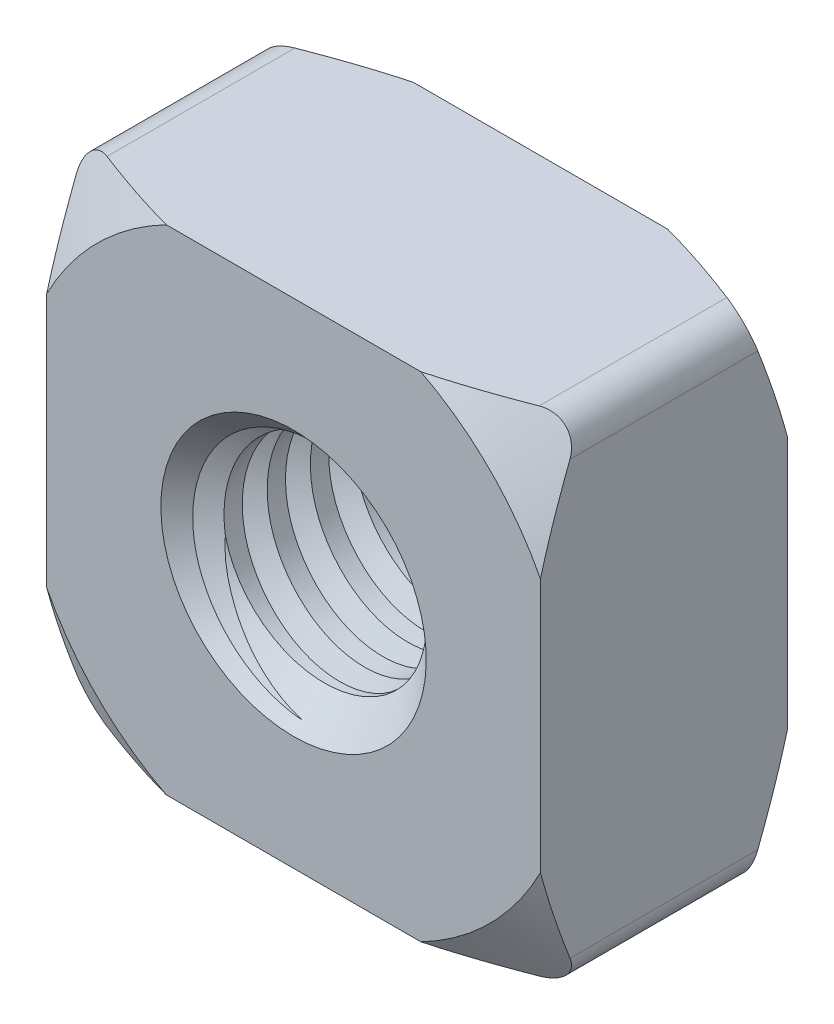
ISO-10303-21;
HEADER;
FILE_DESCRIPTION(('STEP AP214'),'2;1');
FILE_NAME('part.step','',(''),(''),'','','');
FILE_SCHEMA(('AUTOMOTIVE_DESIGN { 1 0 10303 214 1 1 1 1 }'));
ENDSEC;
DATA;
#1=APPLICATION_CONTEXT('core data for automotive mechanical design processes');
#2=APPLICATION_PROTOCOL_DEFINITION('international standard','automotive_design',2000,#1);
#3=PRODUCT_CONTEXT('',#1,'mechanical');
#4=PRODUCT('Part','Part','',(#3));
#5=PRODUCT_RELATED_PRODUCT_CATEGORY('part','',(#4));
#6=PRODUCT_DEFINITION_FORMATION('','',#4);
#7=PRODUCT_DEFINITION_CONTEXT('part definition',#1,'design');
#8=PRODUCT_DEFINITION('design','',#6,#7);
#9=PRODUCT_DEFINITION_SHAPE('','',#8);
#10=(LENGTH_UNIT() NAMED_UNIT(*) SI_UNIT(.MILLI.,.METRE.));
#11=(NAMED_UNIT(*) PLANE_ANGLE_UNIT() SI_UNIT($,.RADIAN.));
#12=(NAMED_UNIT(*) SI_UNIT($,.STERADIAN.) SOLID_ANGLE_UNIT());
#13=UNCERTAINTY_MEASURE_WITH_UNIT(LENGTH_MEASURE(1.E-05),#10,'distance_accuracy_value','');
#14=(GEOMETRIC_REPRESENTATION_CONTEXT(3) GLOBAL_UNCERTAINTY_ASSIGNED_CONTEXT((#13)) GLOBAL_UNIT_ASSIGNED_CONTEXT((#10,
#11,#12)) REPRESENTATION_CONTEXT('',''));
#15=CARTESIAN_POINT('',(0.,0.,0.));
#16=DIRECTION('',(0.,0.,1.));
#17=DIRECTION('',(1.,0.,0.));
#18=AXIS2_PLACEMENT_3D('',#15,#16,#17);
#19=CARTESIAN_POINT('',(0.,0.,2.));
#20=DIRECTION('',(0.,0.,1.));
#21=DIRECTION('',(1.,0.,0.));
#22=AXIS2_PLACEMENT_3D('',#19,#20,#21);
#23=PLANE('',#22);
#24=CARTESIAN_POINT('',(0.,0.,2.));
#25=DIRECTION('',(0.,0.,1.));
#26=DIRECTION('',(1.,0.,0.));
#27=AXIS2_PLACEMENT_3D('',#24,#25,#26);
#28=CIRCLE('',#27,2.15);
#29=CARTESIAN_POINT('',(2.09131287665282,-0.498909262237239,2.));
#30=VERTEX_POINT('',#29);
#31=EDGE_CURVE('E11',#30,#30,#28,.F.);
#32=ORIENTED_EDGE('',*,*,#31,.T.);
#33=EDGE_LOOP('',(#32));
#34=FACE_BOUND('',#33,.T.);
#35=DIRECTION('',(0.,1.,0.));
#36=VECTOR('',#35,1.);
#37=CARTESIAN_POINT('',(4.,4.,2.));
#38=LINE('',#37,#36);
#39=CARTESIAN_POINT('',(4.,-2.06155281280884,2.));
#40=VERTEX_POINT('',#39);
#41=CARTESIAN_POINT('',(4.,2.06155281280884,2.));
#42=VERTEX_POINT('',#41);
#43=EDGE_CURVE('E190',#40,#42,#38,.T.);
#44=ORIENTED_EDGE('',*,*,#43,.T.);
#45=CARTESIAN_POINT('',(0.,0.,2.));
#46=DIRECTION('',(0.,0.,1.));
#47=DIRECTION('',(1.,0.,0.));
#48=AXIS2_PLACEMENT_3D('',#45,#46,#47);
#49=CIRCLE('',#48,4.50000000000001);
#50=CARTESIAN_POINT('',(2.06155281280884,4.,2.));
#51=VERTEX_POINT('',#50);
#52=EDGE_CURVE('E171',#42,#51,#49,.T.);
#53=ORIENTED_EDGE('',*,*,#52,.T.);
#54=DIRECTION('',(-1.,0.,0.));
#55=VECTOR('',#54,1.);
#56=CARTESIAN_POINT('',(-4.,4.,2.));
#57=LINE('',#56,#55);
#58=CARTESIAN_POINT('',(-2.06155281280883,4.,2.));
#59=VERTEX_POINT('',#58);
#60=EDGE_CURVE('E198',#51,#59,#57,.T.);
#61=ORIENTED_EDGE('',*,*,#60,.T.);
#62=CARTESIAN_POINT('',(-4.,2.06155281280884,2.));
#63=VERTEX_POINT('',#62);
#64=EDGE_CURVE('E183',#59,#63,#49,.T.);
#65=ORIENTED_EDGE('',*,*,#64,.T.);
#66=DIRECTION('',(0.,-1.,0.));
#67=VECTOR('',#66,1.);
#68=CARTESIAN_POINT('',(-4.,4.,2.));
#69=LINE('',#68,#67);
#70=CARTESIAN_POINT('',(-4.,-2.06155281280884,2.));
#71=VERTEX_POINT('',#70);
#72=EDGE_CURVE('E203',#63,#71,#69,.T.);
#73=ORIENTED_EDGE('',*,*,#72,.T.);
#74=CARTESIAN_POINT('',(-2.06155281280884,-4.,2.));
#75=VERTEX_POINT('',#74);
#76=EDGE_CURVE('E528',#71,#75,#49,.T.);
#77=ORIENTED_EDGE('',*,*,#76,.T.);
#78=DIRECTION('',(1.,0.,0.));
#79=VECTOR('',#78,1.);
#80=CARTESIAN_POINT('',(-4.,-4.,2.));
#81=LINE('',#80,#79);
#82=CARTESIAN_POINT('',(2.06155281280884,-4.,2.));
#83=VERTEX_POINT('',#82);
#84=EDGE_CURVE('E199',#75,#83,#81,.T.);
#85=ORIENTED_EDGE('',*,*,#84,.T.);
#86=EDGE_CURVE('E185',#83,#40,#49,.T.);
#87=ORIENTED_EDGE('',*,*,#86,.T.);
#88=EDGE_LOOP('',(#44,#53,#61,#65,#73,#77,#85,#87));
#89=FACE_BOUND('',#88,.T.);
#90=ADVANCED_FACE('F35',(#34,#89),#23,.T.);
#91=CARTESIAN_POINT('',(-4.,4.,2.));
#92=DIRECTION('',(1.,0.,0.));
#93=DIRECTION('',(0.,0.,-1.));
#94=AXIS2_PLACEMENT_3D('',#91,#92,#93);
#95=PLANE('',#94);
#96=CARTESIAN_POINT('',(-4.,8.86771225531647,1.06855443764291));
#97=CARTESIAN_POINT('',(-4.,8.66795922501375,0.96169393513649));
#98=CARTESIAN_POINT('',(-4.,8.46796019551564,0.855290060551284));
#99=CARTESIAN_POINT('',(-4.,8.067352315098,0.643624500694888));
#100=CARTESIAN_POINT('',(-4.,7.86674344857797,0.538362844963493));
#101=CARTESIAN_POINT('',(-4.,7.46456475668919,0.329089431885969));
#102=CARTESIAN_POINT('',(-4.,7.26299406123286,0.225079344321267));
#103=CARTESIAN_POINT('',(-4.,6.85898488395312,0.0187582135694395));
#104=CARTESIAN_POINT('',(-4.,6.65654640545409,-0.0835528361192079));
#105=CARTESIAN_POINT('',(-4.,6.23992353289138,-0.291397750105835));
#106=CARTESIAN_POINT('',(-4.,6.02568209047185,-0.396817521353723));
#107=CARTESIAN_POINT('',(-4.,5.5957500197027,-0.604672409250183));
#108=CARTESIAN_POINT('',(-4.,5.38005937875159,-0.707107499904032));
#109=CARTESIAN_POINT('',(-4.,4.94696863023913,-0.908060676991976));
#110=CARTESIAN_POINT('',(-4.,4.72956931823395,-1.00658047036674));
#111=CARTESIAN_POINT('',(-4.,4.29253046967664,-1.19850837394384));
#112=CARTESIAN_POINT('',(-4.,4.07289106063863,-1.29191677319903));
#113=CARTESIAN_POINT('',(-4.,3.60669669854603,-1.48172068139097));
#114=CARTESIAN_POINT('',(-4.,3.35981833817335,-1.57733129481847));
#115=CARTESIAN_POINT('',(-4.,2.86169323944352,-1.75681920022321));
#116=CARTESIAN_POINT('',(-4.,2.61044518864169,-1.84069289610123));
#117=CARTESIAN_POINT('',(-4.,2.10763857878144,-1.99048065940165));
#118=CARTESIAN_POINT('',(-4.,1.85617516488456,-2.05670349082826));
#119=CARTESIAN_POINT('',(-4.,1.47553937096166,-2.13977766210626));
#120=CARTESIAN_POINT('',(-4.,1.34813232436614,-2.16475316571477));
#121=CARTESIAN_POINT('',(-4.,1.09227666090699,-2.20856758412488));
#122=CARTESIAN_POINT('',(-4.,0.963828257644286,-2.22740772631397));
#123=CARTESIAN_POINT('',(-4.,0.725750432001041,-2.25596162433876));
#124=CARTESIAN_POINT('',(-4.,0.616235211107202,-2.26662848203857));
#125=CARTESIAN_POINT('',(-4.,0.396835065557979,-2.2828054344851));
#126=CARTESIAN_POINT('',(-4.,0.286950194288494,-2.28831624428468));
#127=CARTESIAN_POINT('',(-4.,0.0670609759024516,-2.29402137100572));
#128=CARTESIAN_POINT('',(-4.,-0.0429433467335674,-2.29421662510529));
#129=CARTESIAN_POINT('',(-4.,-0.262832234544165,-2.2892874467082));
#130=CARTESIAN_POINT('',(-4.,-0.372716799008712,-2.28416298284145));
#131=CARTESIAN_POINT('',(-4.,-0.594074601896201,-2.26860675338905));
#132=CARTESIAN_POINT('',(-4.,-0.70554126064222,-2.25808204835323));
#133=CARTESIAN_POINT('',(-4.,-0.927881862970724,-2.23197631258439));
#134=CARTESIAN_POINT('',(-4.,-1.03875577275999,-2.21639499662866));
#135=CARTESIAN_POINT('',(-4.,-1.25976389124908,-2.18057538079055));
#136=CARTESIAN_POINT('',(-4.,-1.36989796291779,-2.16033624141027));
#137=CARTESIAN_POINT('',(-4.,-1.58930047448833,-2.11566126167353));
#138=CARTESIAN_POINT('',(-4.,-1.69856894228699,-2.091225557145));
#139=CARTESIAN_POINT('',(-4.,-1.96907569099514,-2.02585118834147));
#140=CARTESIAN_POINT('',(-4.,-2.12977057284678,-1.982662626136));
#141=CARTESIAN_POINT('',(-4.,-2.44919610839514,-1.88953212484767));
#142=CARTESIAN_POINT('',(-4.,-2.60792639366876,-1.839588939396));
#143=CARTESIAN_POINT('',(-4.,-2.92370537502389,-1.73418105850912));
#144=CARTESIAN_POINT('',(-4.,-3.08075225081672,-1.67871094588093));
#145=CARTESIAN_POINT('',(-4.,-3.39319150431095,-1.56335176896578));
#146=CARTESIAN_POINT('',(-4.,-3.54858399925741,-1.50346302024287));
#147=CARTESIAN_POINT('',(-4.,-3.8587238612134,-1.37979791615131));
#148=CARTESIAN_POINT('',(-4.,-4.0134639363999,-1.31600335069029));
#149=CARTESIAN_POINT('',(-4.,-4.32170116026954,-1.18547709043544));
#150=CARTESIAN_POINT('',(-4.,-4.47519826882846,-1.11874530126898));
#151=CARTESIAN_POINT('',(-4.,-4.93393761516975,-0.915050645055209));
#152=CARTESIAN_POINT('',(-4.,-5.23759473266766,-0.774520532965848));
#153=CARTESIAN_POINT('',(-4.,-5.82252280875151,-0.496166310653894));
#154=CARTESIAN_POINT('',(-4.,-6.10398586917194,-0.358741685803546));
#155=CARTESIAN_POINT('',(-4.,-6.66489689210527,-0.0797559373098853));
#156=CARTESIAN_POINT('',(-4.,-6.94434458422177,0.0618057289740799));
#157=CARTESIAN_POINT('',(-4.,-7.49847227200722,0.346322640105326));
#158=CARTESIAN_POINT('',(-4.,-7.77317015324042,0.489243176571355));
#159=CARTESIAN_POINT('',(-4.,-8.32129725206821,0.777355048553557));
#160=CARTESIAN_POINT('',(-4.,-8.59472673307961,0.922545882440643));
#161=CARTESIAN_POINT('',(-4.,-8.86771225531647,1.06855443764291));
#162=B_SPLINE_CURVE_WITH_KNOTS('',3,(#96,#97,#98,#99,#100,#101,#102,#103,#104,#105,#106,#107,
#108,#109,#110,#111,#112,#113,#114,#115,#116,#117,#118,#119,#120,#121,#122,#123,#124,#125,#126,
#127,#128,#129,#130,#131,#132,#133,#134,#135,#136,#137,#138,#139,#140,#141,#142,#143,#144,#145,
#146,#147,#148,#149,#150,#151,#152,#153,#154,#155,#156,#157,#158,#159,#160,#161),.UNSPECIFIED.,
.F.,.F.,(4,2,2,2,2,2,2,2,2,2,2,2,2,2,2,2,2,2,2,2,2,2,2,2,2,2,2,2,2,2,2,2,4),(0.,
0.679622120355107,1.35926177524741,2.03972528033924,2.72018618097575,3.4364882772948,
4.15279661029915,4.86878915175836,5.58474116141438,6.37876099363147,7.1730235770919,
7.95231284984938,8.34168620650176,8.73098162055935,9.06096943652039,9.39091148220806,
9.72079535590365,10.0506811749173,10.3864449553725,10.7222276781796,11.0580709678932,
11.3939033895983,11.8929005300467,12.3919898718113,12.8915732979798,13.391121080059,
13.8932075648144,14.3953101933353,15.3989752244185,16.3385992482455,17.2783470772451,
18.2072957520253,19.1360419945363),.UNSPECIFIED.);
#163=CARTESIAN_POINT('',(-4.,-2.06155281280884,-2.));
#164=VERTEX_POINT('',#163);
#165=CARTESIAN_POINT('',(-4.,-3.5,-1.52160709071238));
#166=VERTEX_POINT('',#165);
#167=EDGE_CURVE('E447',#164,#166,#162,.T.);
#168=ORIENTED_EDGE('',*,*,#167,.T.);
#169=DIRECTION('',(0.,0.,-1.));
#170=VECTOR('',#169,1.);
#171=CARTESIAN_POINT('',(-4.,-3.5,2.));
#172=LINE('',#171,#170);
#173=CARTESIAN_POINT('',(-4.,-3.5,1.52160709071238));
#174=VERTEX_POINT('',#173);
#175=EDGE_CURVE('E462',#166,#174,#172,.F.);
#176=ORIENTED_EDGE('',*,*,#175,.T.);
#177=CARTESIAN_POINT('',(-4.,8.86771225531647,-1.06855443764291));
#178=CARTESIAN_POINT('',(-4.,8.66795922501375,-0.96169393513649));
#179=CARTESIAN_POINT('',(-4.,8.46796019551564,-0.855290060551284));
#180=CARTESIAN_POINT('',(-4.,8.067352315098,-0.643624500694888));
#181=CARTESIAN_POINT('',(-4.,7.86674344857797,-0.538362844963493));
#182=CARTESIAN_POINT('',(-4.,7.46456475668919,-0.329089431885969));
#183=CARTESIAN_POINT('',(-4.,7.26299406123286,-0.225079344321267));
#184=CARTESIAN_POINT('',(-4.,6.85898488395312,-0.0187582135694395));
#185=CARTESIAN_POINT('',(-4.,6.65654640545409,0.0835528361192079));
#186=CARTESIAN_POINT('',(-4.,6.23992353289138,0.291397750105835));
#187=CARTESIAN_POINT('',(-4.,6.02568209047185,0.396817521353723));
#188=CARTESIAN_POINT('',(-4.,5.5957500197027,0.604672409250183));
#189=CARTESIAN_POINT('',(-4.,5.38005937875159,0.707107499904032));
#190=CARTESIAN_POINT('',(-4.,4.94696863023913,0.908060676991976));
#191=CARTESIAN_POINT('',(-4.,4.72956931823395,1.00658047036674));
#192=CARTESIAN_POINT('',(-4.,4.29253046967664,1.19850837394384));
#193=CARTESIAN_POINT('',(-4.,4.07289106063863,1.29191677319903));
#194=CARTESIAN_POINT('',(-4.,3.60669669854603,1.48172068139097));
#195=CARTESIAN_POINT('',(-4.,3.35981833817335,1.57733129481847));
#196=CARTESIAN_POINT('',(-4.,2.86169323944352,1.75681920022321));
#197=CARTESIAN_POINT('',(-4.,2.61044518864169,1.84069289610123));
#198=CARTESIAN_POINT('',(-4.,2.10763857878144,1.99048065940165));
#199=CARTESIAN_POINT('',(-4.,1.85617516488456,2.05670349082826));
#200=CARTESIAN_POINT('',(-4.,1.47553937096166,2.13977766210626));
#201=CARTESIAN_POINT('',(-4.,1.34813232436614,2.16475316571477));
#202=CARTESIAN_POINT('',(-4.,1.09227666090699,2.20856758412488));
#203=CARTESIAN_POINT('',(-4.,0.963828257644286,2.22740772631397));
#204=CARTESIAN_POINT('',(-4.,0.725750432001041,2.25596162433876));
#205=CARTESIAN_POINT('',(-4.,0.616235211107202,2.26662848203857));
#206=CARTESIAN_POINT('',(-4.,0.396835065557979,2.2828054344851));
#207=CARTESIAN_POINT('',(-4.,0.286950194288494,2.28831624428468));
#208=CARTESIAN_POINT('',(-4.,0.0670609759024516,2.29402137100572));
#209=CARTESIAN_POINT('',(-4.,-0.0429433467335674,2.29421662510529));
#210=CARTESIAN_POINT('',(-4.,-0.262832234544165,2.2892874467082));
#211=CARTESIAN_POINT('',(-4.,-0.372716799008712,2.28416298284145));
#212=CARTESIAN_POINT('',(-4.,-0.594074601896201,2.26860675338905));
#213=CARTESIAN_POINT('',(-4.,-0.70554126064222,2.25808204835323));
#214=CARTESIAN_POINT('',(-4.,-0.927881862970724,2.23197631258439));
#215=CARTESIAN_POINT('',(-4.,-1.03875577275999,2.21639499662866));
#216=CARTESIAN_POINT('',(-4.,-1.25976389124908,2.18057538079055));
#217=CARTESIAN_POINT('',(-4.,-1.36989796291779,2.16033624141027));
#218=CARTESIAN_POINT('',(-4.,-1.58930047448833,2.11566126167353));
#219=CARTESIAN_POINT('',(-4.,-1.69856894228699,2.091225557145));
#220=CARTESIAN_POINT('',(-4.,-1.96907569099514,2.02585118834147));
#221=CARTESIAN_POINT('',(-4.,-2.12977057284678,1.982662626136));
#222=CARTESIAN_POINT('',(-4.,-2.44919610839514,1.88953212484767));
#223=CARTESIAN_POINT('',(-4.,-2.60792639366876,1.839588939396));
#224=CARTESIAN_POINT('',(-4.,-2.92370537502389,1.73418105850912));
#225=CARTESIAN_POINT('',(-4.,-3.08075225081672,1.67871094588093));
#226=CARTESIAN_POINT('',(-4.,-3.39319150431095,1.56335176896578));
#227=CARTESIAN_POINT('',(-4.,-3.54858399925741,1.50346302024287));
#228=CARTESIAN_POINT('',(-4.,-3.8587238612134,1.37979791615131));
#229=CARTESIAN_POINT('',(-4.,-4.0134639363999,1.31600335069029));
#230=CARTESIAN_POINT('',(-4.,-4.32170116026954,1.18547709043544));
#231=CARTESIAN_POINT('',(-4.,-4.47519826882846,1.11874530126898));
#232=CARTESIAN_POINT('',(-4.,-4.93393761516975,0.915050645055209));
#233=CARTESIAN_POINT('',(-4.,-5.23759473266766,0.774520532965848));
#234=CARTESIAN_POINT('',(-4.,-5.82252280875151,0.496166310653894));
#235=CARTESIAN_POINT('',(-4.,-6.10398586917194,0.358741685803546));
#236=CARTESIAN_POINT('',(-4.,-6.66489689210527,0.0797559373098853));
#237=CARTESIAN_POINT('',(-4.,-6.94434458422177,-0.0618057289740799));
#238=CARTESIAN_POINT('',(-4.,-7.49847227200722,-0.346322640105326));
#239=CARTESIAN_POINT('',(-4.,-7.77317015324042,-0.489243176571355));
#240=CARTESIAN_POINT('',(-4.,-8.32129725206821,-0.777355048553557));
#241=CARTESIAN_POINT('',(-4.,-8.59472673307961,-0.922545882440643));
#242=CARTESIAN_POINT('',(-4.,-8.86771225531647,-1.06855443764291));
#243=B_SPLINE_CURVE_WITH_KNOTS('',3,(#177,#178,#179,#180,#181,#182,#183,#184,#185,#186,#187,
#188,#189,#190,#191,#192,#193,#194,#195,#196,#197,#198,#199,#200,#201,#202,#203,#204,#205,#206,
#207,#208,#209,#210,#211,#212,#213,#214,#215,#216,#217,#218,#219,#220,#221,#222,#223,#224,#225,
#226,#227,#228,#229,#230,#231,#232,#233,#234,#235,#236,#237,#238,#239,#240,#241,#242),
.UNSPECIFIED.,.F.,.F.,(4,2,2,2,2,2,2,2,2,2,2,2,2,2,2,2,2,2,2,2,2,2,2,2,2,2,2,2,2,2,2,2,4),(0.,
0.679622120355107,1.35926177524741,2.03972528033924,2.72018618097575,3.4364882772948,
4.15279661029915,4.86878915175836,5.58474116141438,6.37876099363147,7.1730235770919,
7.95231284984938,8.34168620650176,8.73098162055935,9.06096943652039,9.39091148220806,
9.72079535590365,10.0506811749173,10.3864449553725,10.7222276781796,11.0580709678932,
11.3939033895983,11.8929005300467,12.3919898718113,12.8915732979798,13.391121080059,
13.8932075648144,14.3953101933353,15.3989752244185,16.3385992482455,17.2783470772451,
18.2072957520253,19.1360419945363),.UNSPECIFIED.);
#244=EDGE_CURVE('E438',#71,#174,#243,.T.);
#245=ORIENTED_EDGE('',*,*,#244,.F.);
#246=ORIENTED_EDGE('',*,*,#72,.F.);
#247=CARTESIAN_POINT('',(-4.,3.49999999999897,1.52160709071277));
#248=VERTEX_POINT('',#247);
#249=EDGE_CURVE('E182',#248,#63,#243,.T.);
#250=ORIENTED_EDGE('',*,*,#249,.F.);
#251=DIRECTION('',(0.,0.,-1.));
#252=VECTOR('',#251,1.);
#253=CARTESIAN_POINT('',(-4.,3.5,2.));
#254=LINE('',#253,#252);
#255=CARTESIAN_POINT('',(-4.,3.5000000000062,-1.52160709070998));
#256=VERTEX_POINT('',#255);
#257=EDGE_CURVE('E459',#248,#256,#254,.T.);
#258=ORIENTED_EDGE('',*,*,#257,.T.);
#259=CARTESIAN_POINT('',(-4.,2.06155281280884,-2.));
#260=VERTEX_POINT('',#259);
#261=EDGE_CURVE('E276',#256,#260,#162,.T.);
#262=ORIENTED_EDGE('',*,*,#261,.T.);
#263=DIRECTION('',(0.,-1.,0.));
#264=VECTOR('',#263,1.);
#265=CARTESIAN_POINT('',(-4.,4.,-2.));
#266=LINE('',#265,#264);
#267=EDGE_CURVE('E207',#260,#164,#266,.T.);
#268=ORIENTED_EDGE('',*,*,#267,.T.);
#269=EDGE_LOOP('',(#168,#176,#245,#246,#250,#258,#262,#268));
#270=FACE_BOUND('',#269,.T.);
#271=ADVANCED_FACE('F407',(#270),#95,.F.);
#272=CARTESIAN_POINT('',(-4.,-4.,2.));
#273=DIRECTION('',(0.,1.,0.));
#274=DIRECTION('',(0.,0.,1.));
#275=AXIS2_PLACEMENT_3D('',#272,#273,#274);
#276=PLANE('',#275);
#277=CARTESIAN_POINT('',(-8.86771225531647,-4.,-1.06855443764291));
#278=CARTESIAN_POINT('',(-8.66795922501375,-4.,-0.961693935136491));
#279=CARTESIAN_POINT('',(-8.46796019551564,-4.,-0.855290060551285));
#280=CARTESIAN_POINT('',(-8.067352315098,-4.,-0.643624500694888));
#281=CARTESIAN_POINT('',(-7.86674344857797,-4.,-0.538362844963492));
#282=CARTESIAN_POINT('',(-7.46456475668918,-4.,-0.329089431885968));
#283=CARTESIAN_POINT('',(-7.26299406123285,-4.,-0.225079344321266));
#284=CARTESIAN_POINT('',(-6.85898488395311,-4.,-0.0187582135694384));
#285=CARTESIAN_POINT('',(-6.65654640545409,-4.,0.0835528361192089));
#286=CARTESIAN_POINT('',(-6.23992353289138,-4.,0.291397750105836));
#287=CARTESIAN_POINT('',(-6.02568209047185,-4.,0.396817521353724));
#288=CARTESIAN_POINT('',(-5.5957500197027,-4.,0.604672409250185));
#289=CARTESIAN_POINT('',(-5.38005937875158,-4.,0.707107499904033));
#290=CARTESIAN_POINT('',(-4.94696863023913,-4.,0.908060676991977));
#291=CARTESIAN_POINT('',(-4.72956931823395,-4.,1.00658047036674));
#292=CARTESIAN_POINT('',(-4.29253046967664,-4.,1.19850837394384));
#293=CARTESIAN_POINT('',(-4.07289106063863,-4.,1.29191677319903));
#294=CARTESIAN_POINT('',(-3.60669669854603,-4.,1.48172068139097));
#295=CARTESIAN_POINT('',(-3.35981833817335,-4.,1.57733129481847));
#296=CARTESIAN_POINT('',(-2.86169323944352,-4.,1.75681920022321));
#297=CARTESIAN_POINT('',(-2.61044518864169,-4.,1.84069289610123));
#298=CARTESIAN_POINT('',(-2.10763857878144,-4.,1.99048065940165));
#299=CARTESIAN_POINT('',(-1.85617516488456,-4.,2.05670349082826));
#300=CARTESIAN_POINT('',(-1.47553937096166,-4.,2.13977766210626));
#301=CARTESIAN_POINT('',(-1.34813232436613,-4.,2.16475316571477));
#302=CARTESIAN_POINT('',(-1.09227666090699,-4.,2.20856758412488));
#303=CARTESIAN_POINT('',(-0.963828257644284,-4.,2.22740772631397));
#304=CARTESIAN_POINT('',(-0.72575043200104,-4.,2.25596162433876));
#305=CARTESIAN_POINT('',(-0.616235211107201,-4.,2.26662848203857));
#306=CARTESIAN_POINT('',(-0.396835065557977,-4.,2.2828054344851));
#307=CARTESIAN_POINT('',(-0.286950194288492,-4.,2.28831624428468));
#308=CARTESIAN_POINT('',(-0.0670609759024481,-4.,2.29402137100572));
#309=CARTESIAN_POINT('',(0.0429433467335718,-4.,2.29421662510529));
#310=CARTESIAN_POINT('',(0.26283223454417,-4.,2.2892874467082));
#311=CARTESIAN_POINT('',(0.372716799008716,-4.,2.28416298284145));
#312=CARTESIAN_POINT('',(0.594074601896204,-4.,2.26860675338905));
#313=CARTESIAN_POINT('',(0.705541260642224,-4.,2.25808204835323));
#314=CARTESIAN_POINT('',(0.927881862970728,-4.,2.23197631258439));
#315=CARTESIAN_POINT('',(1.03875577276,-4.,2.21639499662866));
#316=CARTESIAN_POINT('',(1.25976389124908,-4.,2.18057538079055));
#317=CARTESIAN_POINT('',(1.36989796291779,-4.,2.16033624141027));
#318=CARTESIAN_POINT('',(1.58930047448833,-4.,2.11566126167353));
#319=CARTESIAN_POINT('',(1.69856894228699,-4.,2.091225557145));
#320=CARTESIAN_POINT('',(1.96907569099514,-4.,2.02585118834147));
#321=CARTESIAN_POINT('',(2.12977057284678,-4.,1.982662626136));
#322=CARTESIAN_POINT('',(2.44919610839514,-4.,1.88953212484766));
#323=CARTESIAN_POINT('',(2.60792639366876,-4.,1.839588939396));
#324=CARTESIAN_POINT('',(2.9237053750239,-4.,1.73418105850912));
#325=CARTESIAN_POINT('',(3.08075225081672,-4.,1.67871094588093));
#326=CARTESIAN_POINT('',(3.39319150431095,-4.,1.56335176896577));
#327=CARTESIAN_POINT('',(3.54858399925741,-4.,1.50346302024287));
#328=CARTESIAN_POINT('',(3.8587238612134,-4.,1.37979791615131));
#329=CARTESIAN_POINT('',(4.0134639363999,-4.,1.31600335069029));
#330=CARTESIAN_POINT('',(4.32170116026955,-4.,1.18547709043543));
#331=CARTESIAN_POINT('',(4.47519826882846,-4.,1.11874530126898));
#332=CARTESIAN_POINT('',(4.93393761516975,-4.,0.915050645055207));
#333=CARTESIAN_POINT('',(5.23759473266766,-4.,0.774520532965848));
#334=CARTESIAN_POINT('',(5.82252280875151,-4.,0.496166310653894));
#335=CARTESIAN_POINT('',(6.10398586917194,-4.,0.358741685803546));
#336=CARTESIAN_POINT('',(6.66489689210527,-4.,0.0797559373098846));
#337=CARTESIAN_POINT('',(6.94434458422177,-4.,-0.0618057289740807));
#338=CARTESIAN_POINT('',(7.49847227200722,-4.,-0.346322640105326));
#339=CARTESIAN_POINT('',(7.77317015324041,-4.,-0.489243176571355));
#340=CARTESIAN_POINT('',(8.32129725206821,-4.,-0.777355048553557));
#341=CARTESIAN_POINT('',(8.59472673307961,-4.,-0.922545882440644));
#342=CARTESIAN_POINT('',(8.86771225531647,-4.,-1.06855443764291));
#343=B_SPLINE_CURVE_WITH_KNOTS('',3,(#277,#278,#279,#280,#281,#282,#283,#284,#285,#286,#287,
#288,#289,#290,#291,#292,#293,#294,#295,#296,#297,#298,#299,#300,#301,#302,#303,#304,#305,#306,
#307,#308,#309,#310,#311,#312,#313,#314,#315,#316,#317,#318,#319,#320,#321,#322,#323,#324,#325,
#326,#327,#328,#329,#330,#331,#332,#333,#334,#335,#336,#337,#338,#339,#340,#341,#342),
.UNSPECIFIED.,.F.,.F.,(4,2,2,2,2,2,2,2,2,2,2,2,2,2,2,2,2,2,2,2,2,2,2,2,2,2,2,2,2,2,2,2,4),(0.,
0.679622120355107,1.35926177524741,2.03972528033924,2.72018618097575,3.43648827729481,
4.15279661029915,4.86878915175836,5.58474116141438,6.37876099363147,7.1730235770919,
7.95231284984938,8.34168620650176,8.73098162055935,9.06096943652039,9.39091148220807,
9.72079535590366,10.0506811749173,10.3864449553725,10.7222276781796,11.0580709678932,
11.3939033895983,11.8929005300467,12.3919898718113,12.8915732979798,13.391121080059,
13.8932075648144,14.3953101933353,15.3989752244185,16.3385992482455,17.2783470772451,
18.2072957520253,19.1360419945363),.UNSPECIFIED.);
#344=CARTESIAN_POINT('',(-3.49999999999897,-4.,1.52160709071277));
#345=VERTEX_POINT('',#344);
#346=EDGE_CURVE('E442',#345,#75,#343,.T.);
#347=ORIENTED_EDGE('',*,*,#346,.F.);
#348=DIRECTION('',(0.,0.,-1.));
#349=VECTOR('',#348,1.);
#350=CARTESIAN_POINT('',(-3.5,-4.,2.));
#351=LINE('',#350,#349);
#352=CARTESIAN_POINT('',(-3.5000000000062,-4.,-1.52160709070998));
#353=VERTEX_POINT('',#352);
#354=EDGE_CURVE('E465',#345,#353,#351,.T.);
#355=ORIENTED_EDGE('',*,*,#354,.T.);
#356=CARTESIAN_POINT('',(-8.86771225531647,-4.,1.06855443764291));
#357=CARTESIAN_POINT('',(-8.66795922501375,-4.,0.96169393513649));
#358=CARTESIAN_POINT('',(-8.46796019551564,-4.,0.855290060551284));
#359=CARTESIAN_POINT('',(-8.067352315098,-4.,0.643624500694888));
#360=CARTESIAN_POINT('',(-7.86674344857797,-4.,0.538362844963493));
#361=CARTESIAN_POINT('',(-7.46456475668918,-4.,0.329089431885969));
#362=CARTESIAN_POINT('',(-7.26299406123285,-4.,0.225079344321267));
#363=CARTESIAN_POINT('',(-6.85898488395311,-4.,0.0187582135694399));
#364=CARTESIAN_POINT('',(-6.65654640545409,-4.,-0.0835528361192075));
#365=CARTESIAN_POINT('',(-6.23992353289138,-4.,-0.291397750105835));
#366=CARTESIAN_POINT('',(-6.02568209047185,-4.,-0.396817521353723));
#367=CARTESIAN_POINT('',(-5.5957500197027,-4.,-0.604672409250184));
#368=CARTESIAN_POINT('',(-5.38005937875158,-4.,-0.707107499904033));
#369=CARTESIAN_POINT('',(-4.94696863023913,-4.,-0.908060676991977));
#370=CARTESIAN_POINT('',(-4.72956931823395,-4.,-1.00658047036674));
#371=CARTESIAN_POINT('',(-4.29253046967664,-4.,-1.19850837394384));
#372=CARTESIAN_POINT('',(-4.07289106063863,-4.,-1.29191677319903));
#373=CARTESIAN_POINT('',(-3.60669669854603,-4.,-1.48172068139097));
#374=CARTESIAN_POINT('',(-3.35981833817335,-4.,-1.57733129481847));
#375=CARTESIAN_POINT('',(-2.86169323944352,-4.,-1.75681920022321));
#376=CARTESIAN_POINT('',(-2.61044518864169,-4.,-1.84069289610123));
#377=CARTESIAN_POINT('',(-2.10763857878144,-4.,-1.99048065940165));
#378=CARTESIAN_POINT('',(-1.85617516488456,-4.,-2.05670349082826));
#379=CARTESIAN_POINT('',(-1.47553937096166,-4.,-2.13977766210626));
#380=CARTESIAN_POINT('',(-1.34813232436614,-4.,-2.16475316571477));
#381=CARTESIAN_POINT('',(-1.09227666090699,-4.,-2.20856758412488));
#382=CARTESIAN_POINT('',(-0.963828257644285,-4.,-2.22740772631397));
#383=CARTESIAN_POINT('',(-0.72575043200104,-4.,-2.25596162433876));
#384=CARTESIAN_POINT('',(-0.616235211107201,-4.,-2.26662848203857));
#385=CARTESIAN_POINT('',(-0.396835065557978,-4.,-2.2828054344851));
#386=CARTESIAN_POINT('',(-0.286950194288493,-4.,-2.28831624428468));
#387=CARTESIAN_POINT('',(-0.0670609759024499,-4.,-2.29402137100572));
#388=CARTESIAN_POINT('',(0.0429433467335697,-4.,-2.29421662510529));
#389=CARTESIAN_POINT('',(0.262832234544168,-4.,-2.2892874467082));
#390=CARTESIAN_POINT('',(0.372716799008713,-4.,-2.28416298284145));
#391=CARTESIAN_POINT('',(0.594074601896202,-4.,-2.26860675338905));
#392=CARTESIAN_POINT('',(0.705541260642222,-4.,-2.25808204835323));
#393=CARTESIAN_POINT('',(0.927881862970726,-4.,-2.23197631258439));
#394=CARTESIAN_POINT('',(1.03875577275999,-4.,-2.21639499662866));
#395=CARTESIAN_POINT('',(1.25976389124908,-4.,-2.18057538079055));
#396=CARTESIAN_POINT('',(1.36989796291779,-4.,-2.16033624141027));
#397=CARTESIAN_POINT('',(1.58930047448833,-4.,-2.11566126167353));
#398=CARTESIAN_POINT('',(1.69856894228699,-4.,-2.091225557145));
#399=CARTESIAN_POINT('',(1.96907569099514,-4.,-2.02585118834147));
#400=CARTESIAN_POINT('',(2.12977057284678,-4.,-1.982662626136));
#401=CARTESIAN_POINT('',(2.44919610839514,-4.,-1.88953212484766));
#402=CARTESIAN_POINT('',(2.60792639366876,-4.,-1.839588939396));
#403=CARTESIAN_POINT('',(2.92370537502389,-4.,-1.73418105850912));
#404=CARTESIAN_POINT('',(3.08075225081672,-4.,-1.67871094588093));
#405=CARTESIAN_POINT('',(3.39319150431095,-4.,-1.56335176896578));
#406=CARTESIAN_POINT('',(3.54858399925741,-4.,-1.50346302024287));
#407=CARTESIAN_POINT('',(3.8587238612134,-4.,-1.37979791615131));
#408=CARTESIAN_POINT('',(4.01346393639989,-4.,-1.3160033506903));
#409=CARTESIAN_POINT('',(4.32170116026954,-4.,-1.18547709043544));
#410=CARTESIAN_POINT('',(4.47519826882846,-4.,-1.11874530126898));
#411=CARTESIAN_POINT('',(4.93393761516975,-4.,-0.915050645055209));
#412=CARTESIAN_POINT('',(5.23759473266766,-4.,-0.774520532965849));
#413=CARTESIAN_POINT('',(5.82252280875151,-4.,-0.496166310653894));
#414=CARTESIAN_POINT('',(6.10398586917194,-4.,-0.358741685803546));
#415=CARTESIAN_POINT('',(6.66489689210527,-4.,-0.079755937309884));
#416=CARTESIAN_POINT('',(6.94434458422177,-4.,0.0618057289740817));
#417=CARTESIAN_POINT('',(7.49847227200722,-4.,0.346322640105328));
#418=CARTESIAN_POINT('',(7.77317015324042,-4.,0.489243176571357));
#419=CARTESIAN_POINT('',(8.32129725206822,-4.,0.777355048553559));
#420=CARTESIAN_POINT('',(8.59472673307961,-4.,0.922545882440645));
#421=CARTESIAN_POINT('',(8.86771225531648,-4.,1.06855443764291));
#422=B_SPLINE_CURVE_WITH_KNOTS('',3,(#356,#357,#358,#359,#360,#361,#362,#363,#364,#365,#366,
#367,#368,#369,#370,#371,#372,#373,#374,#375,#376,#377,#378,#379,#380,#381,#382,#383,#384,#385,
#386,#387,#388,#389,#390,#391,#392,#393,#394,#395,#396,#397,#398,#399,#400,#401,#402,#403,#404,
#405,#406,#407,#408,#409,#410,#411,#412,#413,#414,#415,#416,#417,#418,#419,#420,#421),
.UNSPECIFIED.,.F.,.F.,(4,2,2,2,2,2,2,2,2,2,2,2,2,2,2,2,2,2,2,2,2,2,2,2,2,2,2,2,2,2,2,2,4),(0.,
0.679622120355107,1.35926177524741,2.03972528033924,2.72018618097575,3.4364882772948,
4.15279661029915,4.86878915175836,5.58474116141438,6.37876099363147,7.1730235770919,
7.95231284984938,8.34168620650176,8.73098162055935,9.06096943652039,9.39091148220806,
9.72079535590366,10.0506811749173,10.3864449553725,10.7222276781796,11.0580709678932,
11.3939033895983,11.8929005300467,12.3919898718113,12.8915732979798,13.391121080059,
13.8932075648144,14.3953101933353,15.3989752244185,16.3385992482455,17.2783470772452,
18.2072957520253,19.1360419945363),.UNSPECIFIED.);
#423=CARTESIAN_POINT('',(-2.06155281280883,-4.,-2.));
#424=VERTEX_POINT('',#423);
#425=EDGE_CURVE('E536',#353,#424,#422,.T.);
#426=ORIENTED_EDGE('',*,*,#425,.T.);
#427=DIRECTION('',(1.,0.,0.));
#428=VECTOR('',#427,1.);
#429=CARTESIAN_POINT('',(-4.,-4.,-2.));
#430=LINE('',#429,#428);
#431=CARTESIAN_POINT('',(2.06155281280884,-4.,-2.));
#432=VERTEX_POINT('',#431);
#433=EDGE_CURVE('E210',#424,#432,#430,.T.);
#434=ORIENTED_EDGE('',*,*,#433,.T.);
#435=CARTESIAN_POINT('',(3.5,-4.,-1.52160709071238));
#436=VERTEX_POINT('',#435);
#437=EDGE_CURVE('E290',#432,#436,#422,.T.);
#438=ORIENTED_EDGE('',*,*,#437,.T.);
#439=DIRECTION('',(0.,0.,-1.));
#440=VECTOR('',#439,1.);
#441=CARTESIAN_POINT('',(3.5,-4.,2.));
#442=LINE('',#441,#440);
#443=CARTESIAN_POINT('',(3.5,-4.,1.52160709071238));
#444=VERTEX_POINT('',#443);
#445=EDGE_CURVE('E509',#436,#444,#442,.F.);
#446=ORIENTED_EDGE('',*,*,#445,.T.);
#447=EDGE_CURVE('E485',#83,#444,#343,.T.);
#448=ORIENTED_EDGE('',*,*,#447,.F.);
#449=ORIENTED_EDGE('',*,*,#84,.F.);
#450=EDGE_LOOP('',(#347,#355,#426,#434,#438,#446,#448,#449));
#451=FACE_BOUND('',#450,.T.);
#452=ADVANCED_FACE('F412',(#451),#276,.F.);
#453=CARTESIAN_POINT('',(4.,4.,2.));
#454=DIRECTION('',(-1.,0.,0.));
#455=DIRECTION('',(0.,-1.,0.));
#456=AXIS2_PLACEMENT_3D('',#453,#454,#455);
#457=PLANE('',#456);
#458=CARTESIAN_POINT('',(4.,-8.86771225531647,-1.06855443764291));
#459=CARTESIAN_POINT('',(4.,-8.66795922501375,-0.961693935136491));
#460=CARTESIAN_POINT('',(4.,-8.46796019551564,-0.855290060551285));
#461=CARTESIAN_POINT('',(4.,-8.067352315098,-0.643624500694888));
#462=CARTESIAN_POINT('',(4.,-7.86674344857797,-0.538362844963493));
#463=CARTESIAN_POINT('',(4.,-7.46456475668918,-0.329089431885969));
#464=CARTESIAN_POINT('',(4.,-7.26299406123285,-0.225079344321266));
#465=CARTESIAN_POINT('',(4.,-6.85898488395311,-0.0187582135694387));
#466=CARTESIAN_POINT('',(4.,-6.65654640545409,0.0835528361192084));
#467=CARTESIAN_POINT('',(4.,-6.23992353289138,0.291397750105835));
#468=CARTESIAN_POINT('',(4.,-6.02568209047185,0.396817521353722));
#469=CARTESIAN_POINT('',(4.,-5.5957500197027,0.604672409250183));
#470=CARTESIAN_POINT('',(4.,-5.38005937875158,0.707107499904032));
#471=CARTESIAN_POINT('',(4.,-4.94696863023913,0.908060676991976));
#472=CARTESIAN_POINT('',(4.,-4.72956931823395,1.00658047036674));
#473=CARTESIAN_POINT('',(4.,-4.29253046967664,1.19850837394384));
#474=CARTESIAN_POINT('',(4.,-4.07289106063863,1.29191677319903));
#475=CARTESIAN_POINT('',(4.,-3.60669669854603,1.48172068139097));
#476=CARTESIAN_POINT('',(4.,-3.35981833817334,1.57733129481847));
#477=CARTESIAN_POINT('',(4.,-2.86169323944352,1.75681920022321));
#478=CARTESIAN_POINT('',(4.,-2.61044518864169,1.84069289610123));
#479=CARTESIAN_POINT('',(4.,-2.10763857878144,1.99048065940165));
#480=CARTESIAN_POINT('',(4.,-1.85617516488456,2.05670349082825));
#481=CARTESIAN_POINT('',(4.,-1.47553937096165,2.13977766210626));
#482=CARTESIAN_POINT('',(4.,-1.34813232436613,2.16475316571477));
#483=CARTESIAN_POINT('',(4.,-1.09227666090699,2.20856758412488));
#484=CARTESIAN_POINT('',(4.,-0.963828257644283,2.22740772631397));
#485=CARTESIAN_POINT('',(4.,-0.725750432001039,2.25596162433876));
#486=CARTESIAN_POINT('',(4.,-0.616235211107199,2.26662848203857));
#487=CARTESIAN_POINT('',(4.,-0.396835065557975,2.2828054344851));
#488=CARTESIAN_POINT('',(4.,-0.286950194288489,2.28831624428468));
#489=CARTESIAN_POINT('',(4.,-0.0670609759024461,2.29402137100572));
#490=CARTESIAN_POINT('',(4.,0.042943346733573,2.29421662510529));
#491=CARTESIAN_POINT('',(4.,0.262832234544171,2.28928744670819));
#492=CARTESIAN_POINT('',(4.,0.372716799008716,2.28416298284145));
#493=CARTESIAN_POINT('',(4.,0.594074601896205,2.26860675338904));
#494=CARTESIAN_POINT('',(4.,0.705541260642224,2.25808204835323));
#495=CARTESIAN_POINT('',(4.,0.927881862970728,2.23197631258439));
#496=CARTESIAN_POINT('',(4.,1.03875577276,2.21639499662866));
#497=CARTESIAN_POINT('',(4.,1.25976389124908,2.18057538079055));
#498=CARTESIAN_POINT('',(4.,1.36989796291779,2.16033624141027));
#499=CARTESIAN_POINT('',(4.,1.58930047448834,2.11566126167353));
#500=CARTESIAN_POINT('',(4.,1.69856894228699,2.091225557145));
#501=CARTESIAN_POINT('',(4.,1.96907569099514,2.02585118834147));
#502=CARTESIAN_POINT('',(4.,2.12977057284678,1.982662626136));
#503=CARTESIAN_POINT('',(4.,2.44919610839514,1.88953212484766));
#504=CARTESIAN_POINT('',(4.,2.60792639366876,1.839588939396));
#505=CARTESIAN_POINT('',(4.,2.9237053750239,1.73418105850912));
#506=CARTESIAN_POINT('',(4.,3.08075225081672,1.67871094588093));
#507=CARTESIAN_POINT('',(4.,3.39319150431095,1.56335176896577));
#508=CARTESIAN_POINT('',(4.,3.54858399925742,1.50346302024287));
#509=CARTESIAN_POINT('',(4.,3.8587238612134,1.37979791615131));
#510=CARTESIAN_POINT('',(4.,4.0134639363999,1.31600335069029));
#511=CARTESIAN_POINT('',(4.,4.32170116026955,1.18547709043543));
#512=CARTESIAN_POINT('',(4.,4.47519826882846,1.11874530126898));
#513=CARTESIAN_POINT('',(4.,4.93393761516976,0.915050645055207));
#514=CARTESIAN_POINT('',(4.,5.23759473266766,0.774520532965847));
#515=CARTESIAN_POINT('',(4.,5.82252280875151,0.496166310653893));
#516=CARTESIAN_POINT('',(4.,6.10398586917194,0.358741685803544));
#517=CARTESIAN_POINT('',(4.,6.66489689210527,0.0797559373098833));
#518=CARTESIAN_POINT('',(4.,6.94434458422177,-0.0618057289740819));
#519=CARTESIAN_POINT('',(4.,7.49847227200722,-0.346322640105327));
#520=CARTESIAN_POINT('',(4.,7.77317015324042,-0.489243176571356));
#521=CARTESIAN_POINT('',(4.,8.32129725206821,-0.777355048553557));
#522=CARTESIAN_POINT('',(4.,8.59472673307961,-0.922545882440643));
#523=CARTESIAN_POINT('',(4.,8.86771225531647,-1.06855443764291));
#524=B_SPLINE_CURVE_WITH_KNOTS('',3,(#458,#459,#460,#461,#462,#463,#464,#465,#466,#467,#468,
#469,#470,#471,#472,#473,#474,#475,#476,#477,#478,#479,#480,#481,#482,#483,#484,#485,#486,#487,
#488,#489,#490,#491,#492,#493,#494,#495,#496,#497,#498,#499,#500,#501,#502,#503,#504,#505,#506,
#507,#508,#509,#510,#511,#512,#513,#514,#515,#516,#517,#518,#519,#520,#521,#522,#523),
.UNSPECIFIED.,.F.,.F.,(4,2,2,2,2,2,2,2,2,2,2,2,2,2,2,2,2,2,2,2,2,2,2,2,2,2,2,2,2,2,2,2,4),(0.,
0.679622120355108,1.35926177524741,2.03972528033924,2.72018618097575,3.4364882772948,
4.15279661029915,4.86878915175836,5.58474116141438,6.37876099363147,7.1730235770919,
7.95231284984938,8.34168620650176,8.73098162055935,9.06096943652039,9.39091148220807,
9.72079535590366,10.0506811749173,10.3864449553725,10.7222276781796,11.0580709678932,
11.3939033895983,11.8929005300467,12.3919898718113,12.8915732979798,13.391121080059,
13.8932075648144,14.3953101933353,15.3989752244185,16.3385992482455,17.2783470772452,
18.2072957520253,19.1360419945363),.UNSPECIFIED.);
#525=CARTESIAN_POINT('',(4.,-3.49999999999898,1.52160709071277));
#526=VERTEX_POINT('',#525);
#527=EDGE_CURVE('E194',#526,#40,#524,.T.);
#528=ORIENTED_EDGE('',*,*,#527,.F.);
#529=DIRECTION('',(0.,0.,-1.));
#530=VECTOR('',#529,1.);
#531=CARTESIAN_POINT('',(4.,-3.5,2.));
#532=LINE('',#531,#530);
#533=CARTESIAN_POINT('',(4.,-3.5000000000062,-1.52160709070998));
#534=VERTEX_POINT('',#533);
#535=EDGE_CURVE('E434',#526,#534,#532,.T.);
#536=ORIENTED_EDGE('',*,*,#535,.T.);
#537=CARTESIAN_POINT('',(4.,-8.86771225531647,1.06855443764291));
#538=CARTESIAN_POINT('',(4.,-8.66795922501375,0.961693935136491));
#539=CARTESIAN_POINT('',(4.,-8.46796019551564,0.855290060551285));
#540=CARTESIAN_POINT('',(4.,-8.067352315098,0.643624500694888));
#541=CARTESIAN_POINT('',(4.,-7.86674344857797,0.538362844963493));
#542=CARTESIAN_POINT('',(4.,-7.46456475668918,0.329089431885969));
#543=CARTESIAN_POINT('',(4.,-7.26299406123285,0.225079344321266));
#544=CARTESIAN_POINT('',(4.,-6.85898488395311,0.0187582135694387));
#545=CARTESIAN_POINT('',(4.,-6.65654640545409,-0.0835528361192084));
#546=CARTESIAN_POINT('',(4.,-6.23992353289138,-0.291397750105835));
#547=CARTESIAN_POINT('',(4.,-6.02568209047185,-0.396817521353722));
#548=CARTESIAN_POINT('',(4.,-5.5957500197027,-0.604672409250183));
#549=CARTESIAN_POINT('',(4.,-5.38005937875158,-0.707107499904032));
#550=CARTESIAN_POINT('',(4.,-4.94696863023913,-0.908060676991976));
#551=CARTESIAN_POINT('',(4.,-4.72956931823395,-1.00658047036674));
#552=CARTESIAN_POINT('',(4.,-4.29253046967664,-1.19850837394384));
#553=CARTESIAN_POINT('',(4.,-4.07289106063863,-1.29191677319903));
#554=CARTESIAN_POINT('',(4.,-3.60669669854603,-1.48172068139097));
#555=CARTESIAN_POINT('',(4.,-3.35981833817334,-1.57733129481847));
#556=CARTESIAN_POINT('',(4.,-2.86169323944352,-1.75681920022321));
#557=CARTESIAN_POINT('',(4.,-2.61044518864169,-1.84069289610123));
#558=CARTESIAN_POINT('',(4.,-2.10763857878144,-1.99048065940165));
#559=CARTESIAN_POINT('',(4.,-1.85617516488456,-2.05670349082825));
#560=CARTESIAN_POINT('',(4.,-1.47553937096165,-2.13977766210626));
#561=CARTESIAN_POINT('',(4.,-1.34813232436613,-2.16475316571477));
#562=CARTESIAN_POINT('',(4.,-1.09227666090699,-2.20856758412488));
#563=CARTESIAN_POINT('',(4.,-0.963828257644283,-2.22740772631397));
#564=CARTESIAN_POINT('',(4.,-0.725750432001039,-2.25596162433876));
#565=CARTESIAN_POINT('',(4.,-0.616235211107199,-2.26662848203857));
#566=CARTESIAN_POINT('',(4.,-0.396835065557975,-2.2828054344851));
#567=CARTESIAN_POINT('',(4.,-0.286950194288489,-2.28831624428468));
#568=CARTESIAN_POINT('',(4.,-0.0670609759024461,-2.29402137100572));
#569=CARTESIAN_POINT('',(4.,0.042943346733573,-2.29421662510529));
#570=CARTESIAN_POINT('',(4.,0.262832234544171,-2.28928744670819));
#571=CARTESIAN_POINT('',(4.,0.372716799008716,-2.28416298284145));
#572=CARTESIAN_POINT('',(4.,0.594074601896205,-2.26860675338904));
#573=CARTESIAN_POINT('',(4.,0.705541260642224,-2.25808204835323));
#574=CARTESIAN_POINT('',(4.,0.927881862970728,-2.23197631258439));
#575=CARTESIAN_POINT('',(4.,1.03875577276,-2.21639499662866));
#576=CARTESIAN_POINT('',(4.,1.25976389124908,-2.18057538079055));
#577=CARTESIAN_POINT('',(4.,1.36989796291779,-2.16033624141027));
#578=CARTESIAN_POINT('',(4.,1.58930047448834,-2.11566126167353));
#579=CARTESIAN_POINT('',(4.,1.69856894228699,-2.091225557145));
#580=CARTESIAN_POINT('',(4.,1.96907569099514,-2.02585118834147));
#581=CARTESIAN_POINT('',(4.,2.12977057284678,-1.982662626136));
#582=CARTESIAN_POINT('',(4.,2.44919610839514,-1.88953212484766));
#583=CARTESIAN_POINT('',(4.,2.60792639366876,-1.839588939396));
#584=CARTESIAN_POINT('',(4.,2.9237053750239,-1.73418105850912));
#585=CARTESIAN_POINT('',(4.,3.08075225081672,-1.67871094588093));
#586=CARTESIAN_POINT('',(4.,3.39319150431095,-1.56335176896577));
#587=CARTESIAN_POINT('',(4.,3.54858399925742,-1.50346302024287));
#588=CARTESIAN_POINT('',(4.,3.8587238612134,-1.37979791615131));
#589=CARTESIAN_POINT('',(4.,4.0134639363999,-1.31600335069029));
#590=CARTESIAN_POINT('',(4.,4.32170116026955,-1.18547709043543));
#591=CARTESIAN_POINT('',(4.,4.47519826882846,-1.11874530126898));
#592=CARTESIAN_POINT('',(4.,4.93393761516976,-0.915050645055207));
#593=CARTESIAN_POINT('',(4.,5.23759473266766,-0.774520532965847));
#594=CARTESIAN_POINT('',(4.,5.82252280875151,-0.496166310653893));
#595=CARTESIAN_POINT('',(4.,6.10398586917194,-0.358741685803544));
#596=CARTESIAN_POINT('',(4.,6.66489689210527,-0.0797559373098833));
#597=CARTESIAN_POINT('',(4.,6.94434458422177,0.0618057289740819));
#598=CARTESIAN_POINT('',(4.,7.49847227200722,0.346322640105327));
#599=CARTESIAN_POINT('',(4.,7.77317015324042,0.489243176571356));
#600=CARTESIAN_POINT('',(4.,8.32129725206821,0.777355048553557));
#601=CARTESIAN_POINT('',(4.,8.59472673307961,0.922545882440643));
#602=CARTESIAN_POINT('',(4.,8.86771225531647,1.06855443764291));
#603=B_SPLINE_CURVE_WITH_KNOTS('',3,(#537,#538,#539,#540,#541,#542,#543,#544,#545,#546,#547,
#548,#549,#550,#551,#552,#553,#554,#555,#556,#557,#558,#559,#560,#561,#562,#563,#564,#565,#566,
#567,#568,#569,#570,#571,#572,#573,#574,#575,#576,#577,#578,#579,#580,#581,#582,#583,#584,#585,
#586,#587,#588,#589,#590,#591,#592,#593,#594,#595,#596,#597,#598,#599,#600,#601,#602),
.UNSPECIFIED.,.F.,.F.,(4,2,2,2,2,2,2,2,2,2,2,2,2,2,2,2,2,2,2,2,2,2,2,2,2,2,2,2,2,2,2,2,4),(0.,
0.679622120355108,1.35926177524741,2.03972528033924,2.72018618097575,3.4364882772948,
4.15279661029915,4.86878915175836,5.58474116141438,6.37876099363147,7.1730235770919,
7.95231284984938,8.34168620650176,8.73098162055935,9.06096943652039,9.39091148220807,
9.72079535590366,10.0506811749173,10.3864449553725,10.7222276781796,11.0580709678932,
11.3939033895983,11.8929005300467,12.3919898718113,12.8915732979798,13.391121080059,
13.8932075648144,14.3953101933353,15.3989752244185,16.3385992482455,17.2783470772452,
18.2072957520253,19.1360419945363),.UNSPECIFIED.);
#604=CARTESIAN_POINT('',(4.,-2.06155281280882,-2.));
#605=VERTEX_POINT('',#604);
#606=EDGE_CURVE('E432',#534,#605,#603,.T.);
#607=ORIENTED_EDGE('',*,*,#606,.T.);
#608=DIRECTION('',(0.,1.,0.));
#609=VECTOR('',#608,1.);
#610=CARTESIAN_POINT('',(4.,4.,-2.));
#611=LINE('',#610,#609);
#612=CARTESIAN_POINT('',(4.,2.06155281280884,-2.));
#613=VERTEX_POINT('',#612);
#614=EDGE_CURVE('E214',#605,#613,#611,.T.);
#615=ORIENTED_EDGE('',*,*,#614,.T.);
#616=CARTESIAN_POINT('',(4.,3.5,-1.52160709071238));
#617=VERTEX_POINT('',#616);
#618=EDGE_CURVE('E284',#613,#617,#603,.T.);
#619=ORIENTED_EDGE('',*,*,#618,.T.);
#620=DIRECTION('',(0.,0.,-1.));
#621=VECTOR('',#620,1.);
#622=CARTESIAN_POINT('',(4.,3.5,2.));
#623=LINE('',#622,#621);
#624=CARTESIAN_POINT('',(4.,3.5,1.52160709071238));
#625=VERTEX_POINT('',#624);
#626=EDGE_CURVE('E193',#617,#625,#623,.F.);
#627=ORIENTED_EDGE('',*,*,#626,.T.);
#628=EDGE_CURVE('E174',#42,#625,#524,.T.);
#629=ORIENTED_EDGE('',*,*,#628,.F.);
#630=ORIENTED_EDGE('',*,*,#43,.F.);
#631=EDGE_LOOP('',(#528,#536,#607,#615,#619,#627,#629,#630));
#632=FACE_BOUND('',#631,.T.);
#633=ADVANCED_FACE('F189',(#632),#457,.F.);
#634=CARTESIAN_POINT('',(-4.,4.,2.));
#635=DIRECTION('',(0.,-1.,0.));
#636=DIRECTION('',(1.,0.,0.));
#637=AXIS2_PLACEMENT_3D('',#634,#635,#636);
#638=PLANE('',#637);
#639=CARTESIAN_POINT('',(8.86771225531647,4.,-1.06855443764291));
#640=CARTESIAN_POINT('',(8.66795922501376,4.,-0.961693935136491));
#641=CARTESIAN_POINT('',(8.46796019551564,4.,-0.855290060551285));
#642=CARTESIAN_POINT('',(8.067352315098,4.,-0.643624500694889));
#643=CARTESIAN_POINT('',(7.86674344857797,4.,-0.538362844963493));
#644=CARTESIAN_POINT('',(7.46456475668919,4.,-0.32908943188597));
#645=CARTESIAN_POINT('',(7.26299406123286,4.,-0.225079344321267));
#646=CARTESIAN_POINT('',(6.85898488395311,4.,-0.0187582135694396));
#647=CARTESIAN_POINT('',(6.65654640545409,4.,0.0835528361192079));
#648=CARTESIAN_POINT('',(6.23992353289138,4.,0.291397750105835));
#649=CARTESIAN_POINT('',(6.02568209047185,4.,0.396817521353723));
#650=CARTESIAN_POINT('',(5.5957500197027,4.,0.604672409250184));
#651=CARTESIAN_POINT('',(5.38005937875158,4.,0.707107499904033));
#652=CARTESIAN_POINT('',(4.94696863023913,4.,0.908060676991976));
#653=CARTESIAN_POINT('',(4.72956931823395,4.,1.00658047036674));
#654=CARTESIAN_POINT('',(4.29253046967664,4.,1.19850837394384));
#655=CARTESIAN_POINT('',(4.07289106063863,4.,1.29191677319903));
#656=CARTESIAN_POINT('',(3.60669669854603,4.,1.48172068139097));
#657=CARTESIAN_POINT('',(3.35981833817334,4.,1.57733129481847));
#658=CARTESIAN_POINT('',(2.86169323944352,4.,1.75681920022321));
#659=CARTESIAN_POINT('',(2.61044518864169,4.,1.84069289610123));
#660=CARTESIAN_POINT('',(2.10763857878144,4.,1.99048065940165));
#661=CARTESIAN_POINT('',(1.85617516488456,4.,2.05670349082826));
#662=CARTESIAN_POINT('',(1.47553937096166,4.,2.13977766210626));
#663=CARTESIAN_POINT('',(1.34813232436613,4.,2.16475316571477));
#664=CARTESIAN_POINT('',(1.09227666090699,4.,2.20856758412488));
#665=CARTESIAN_POINT('',(0.963828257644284,4.,2.22740772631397));
#666=CARTESIAN_POINT('',(0.725750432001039,4.,2.25596162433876));
#667=CARTESIAN_POINT('',(0.6162352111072,4.,2.26662848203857));
#668=CARTESIAN_POINT('',(0.396835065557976,4.,2.2828054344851));
#669=CARTESIAN_POINT('',(0.28695019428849,4.,2.28831624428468));
#670=CARTESIAN_POINT('',(0.067060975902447,4.,2.29402137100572));
#671=CARTESIAN_POINT('',(-0.0429433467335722,4.,2.29421662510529));
#672=CARTESIAN_POINT('',(-0.26283223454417,4.,2.28928744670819));
#673=CARTESIAN_POINT('',(-0.372716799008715,4.,2.28416298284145));
#674=CARTESIAN_POINT('',(-0.594074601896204,4.,2.26860675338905));
#675=CARTESIAN_POINT('',(-0.705541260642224,4.,2.25808204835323));
#676=CARTESIAN_POINT('',(-0.927881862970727,4.,2.23197631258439));
#677=CARTESIAN_POINT('',(-1.03875577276,4.,2.21639499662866));
#678=CARTESIAN_POINT('',(-1.25976389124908,4.,2.18057538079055));
#679=CARTESIAN_POINT('',(-1.36989796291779,4.,2.16033624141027));
#680=CARTESIAN_POINT('',(-1.58930047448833,4.,2.11566126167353));
#681=CARTESIAN_POINT('',(-1.69856894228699,4.,2.091225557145));
#682=CARTESIAN_POINT('',(-1.96907569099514,4.,2.02585118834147));
#683=CARTESIAN_POINT('',(-2.12977057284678,4.,1.982662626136));
#684=CARTESIAN_POINT('',(-2.44919610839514,4.,1.88953212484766));
#685=CARTESIAN_POINT('',(-2.60792639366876,4.,1.839588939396));
#686=CARTESIAN_POINT('',(-2.9237053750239,4.,1.73418105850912));
#687=CARTESIAN_POINT('',(-3.08075225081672,4.,1.67871094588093));
#688=CARTESIAN_POINT('',(-3.39319150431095,4.,1.56335176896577));
#689=CARTESIAN_POINT('',(-3.54858399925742,4.,1.50346302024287));
#690=CARTESIAN_POINT('',(-3.8587238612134,4.,1.37979791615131));
#691=CARTESIAN_POINT('',(-4.0134639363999,4.,1.31600335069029));
#692=CARTESIAN_POINT('',(-4.32170116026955,4.,1.18547709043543));
#693=CARTESIAN_POINT('',(-4.47519826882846,4.,1.11874530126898));
#694=CARTESIAN_POINT('',(-4.93393761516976,4.,0.915050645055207));
#695=CARTESIAN_POINT('',(-5.23759473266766,4.,0.774520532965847));
#696=CARTESIAN_POINT('',(-5.82252280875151,4.,0.496166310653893));
#697=CARTESIAN_POINT('',(-6.10398586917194,4.,0.358741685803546));
#698=CARTESIAN_POINT('',(-6.66489689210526,4.,0.0797559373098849));
#699=CARTESIAN_POINT('',(-6.94434458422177,4.,-0.0618057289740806));
#700=CARTESIAN_POINT('',(-7.49847227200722,4.,-0.346322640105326));
#701=CARTESIAN_POINT('',(-7.77317015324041,4.,-0.489243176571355));
#702=CARTESIAN_POINT('',(-8.32129725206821,4.,-0.777355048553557));
#703=CARTESIAN_POINT('',(-8.59472673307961,4.,-0.922545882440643));
#704=CARTESIAN_POINT('',(-8.86771225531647,4.,-1.06855443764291));
#705=B_SPLINE_CURVE_WITH_KNOTS('',3,(#639,#640,#641,#642,#643,#644,#645,#646,#647,#648,#649,
#650,#651,#652,#653,#654,#655,#656,#657,#658,#659,#660,#661,#662,#663,#664,#665,#666,#667,#668,
#669,#670,#671,#672,#673,#674,#675,#676,#677,#678,#679,#680,#681,#682,#683,#684,#685,#686,#687,
#688,#689,#690,#691,#692,#693,#694,#695,#696,#697,#698,#699,#700,#701,#702,#703,#704),
.UNSPECIFIED.,.F.,.F.,(4,2,2,2,2,2,2,2,2,2,2,2,2,2,2,2,2,2,2,2,2,2,2,2,2,2,2,2,2,2,2,2,4),(0.,
0.679622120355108,1.35926177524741,2.03972528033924,2.72018618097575,3.43648827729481,
4.15279661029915,4.86878915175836,5.58474116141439,6.37876099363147,7.1730235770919,
7.95231284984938,8.34168620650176,8.73098162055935,9.06096943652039,9.39091148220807,
9.72079535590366,10.0506811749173,10.3864449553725,10.7222276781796,11.0580709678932,
11.3939033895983,11.8929005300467,12.3919898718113,12.8915732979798,13.391121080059,
13.8932075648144,14.3953101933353,15.3989752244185,16.3385992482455,17.2783470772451,
18.2072957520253,19.1360419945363),.UNSPECIFIED.);
#706=CARTESIAN_POINT('',(3.49999999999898,4.,1.52160709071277));
#707=VERTEX_POINT('',#706);
#708=EDGE_CURVE('E177',#707,#51,#705,.T.);
#709=ORIENTED_EDGE('',*,*,#708,.F.);
#710=DIRECTION('',(0.,0.,-1.));
#711=VECTOR('',#710,1.);
#712=CARTESIAN_POINT('',(3.5,4.,2.));
#713=LINE('',#712,#711);
#714=CARTESIAN_POINT('',(3.5000000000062,4.,-1.52160709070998));
#715=VERTEX_POINT('',#714);
#716=EDGE_CURVE('E322',#707,#715,#713,.T.);
#717=ORIENTED_EDGE('',*,*,#716,.T.);
#718=CARTESIAN_POINT('',(8.86771225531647,4.,1.06855443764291));
#719=CARTESIAN_POINT('',(8.66795922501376,4.,0.961693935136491));
#720=CARTESIAN_POINT('',(8.46796019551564,4.,0.855290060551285));
#721=CARTESIAN_POINT('',(8.067352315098,4.,0.643624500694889));
#722=CARTESIAN_POINT('',(7.86674344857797,4.,0.538362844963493));
#723=CARTESIAN_POINT('',(7.46456475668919,4.,0.32908943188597));
#724=CARTESIAN_POINT('',(7.26299406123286,4.,0.225079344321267));
#725=CARTESIAN_POINT('',(6.85898488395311,4.,0.0187582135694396));
#726=CARTESIAN_POINT('',(6.65654640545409,4.,-0.0835528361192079));
#727=CARTESIAN_POINT('',(6.23992353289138,4.,-0.291397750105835));
#728=CARTESIAN_POINT('',(6.02568209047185,4.,-0.396817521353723));
#729=CARTESIAN_POINT('',(5.5957500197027,4.,-0.604672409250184));
#730=CARTESIAN_POINT('',(5.38005937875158,4.,-0.707107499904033));
#731=CARTESIAN_POINT('',(4.94696863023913,4.,-0.908060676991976));
#732=CARTESIAN_POINT('',(4.72956931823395,4.,-1.00658047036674));
#733=CARTESIAN_POINT('',(4.29253046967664,4.,-1.19850837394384));
#734=CARTESIAN_POINT('',(4.07289106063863,4.,-1.29191677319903));
#735=CARTESIAN_POINT('',(3.60669669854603,4.,-1.48172068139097));
#736=CARTESIAN_POINT('',(3.35981833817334,4.,-1.57733129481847));
#737=CARTESIAN_POINT('',(2.86169323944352,4.,-1.75681920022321));
#738=CARTESIAN_POINT('',(2.61044518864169,4.,-1.84069289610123));
#739=CARTESIAN_POINT('',(2.10763857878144,4.,-1.99048065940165));
#740=CARTESIAN_POINT('',(1.85617516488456,4.,-2.05670349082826));
#741=CARTESIAN_POINT('',(1.47553937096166,4.,-2.13977766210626));
#742=CARTESIAN_POINT('',(1.34813232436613,4.,-2.16475316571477));
#743=CARTESIAN_POINT('',(1.09227666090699,4.,-2.20856758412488));
#744=CARTESIAN_POINT('',(0.963828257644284,4.,-2.22740772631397));
#745=CARTESIAN_POINT('',(0.725750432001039,4.,-2.25596162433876));
#746=CARTESIAN_POINT('',(0.6162352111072,4.,-2.26662848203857));
#747=CARTESIAN_POINT('',(0.396835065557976,4.,-2.2828054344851));
#748=CARTESIAN_POINT('',(0.28695019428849,4.,-2.28831624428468));
#749=CARTESIAN_POINT('',(0.067060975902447,4.,-2.29402137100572));
#750=CARTESIAN_POINT('',(-0.0429433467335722,4.,-2.29421662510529));
#751=CARTESIAN_POINT('',(-0.26283223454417,4.,-2.28928744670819));
#752=CARTESIAN_POINT('',(-0.372716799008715,4.,-2.28416298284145));
#753=CARTESIAN_POINT('',(-0.594074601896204,4.,-2.26860675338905));
#754=CARTESIAN_POINT('',(-0.705541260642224,4.,-2.25808204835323));
#755=CARTESIAN_POINT('',(-0.927881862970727,4.,-2.23197631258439));
#756=CARTESIAN_POINT('',(-1.03875577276,4.,-2.21639499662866));
#757=CARTESIAN_POINT('',(-1.25976389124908,4.,-2.18057538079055));
#758=CARTESIAN_POINT('',(-1.36989796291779,4.,-2.16033624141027));
#759=CARTESIAN_POINT('',(-1.58930047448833,4.,-2.11566126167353));
#760=CARTESIAN_POINT('',(-1.69856894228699,4.,-2.091225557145));
#761=CARTESIAN_POINT('',(-1.96907569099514,4.,-2.02585118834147));
#762=CARTESIAN_POINT('',(-2.12977057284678,4.,-1.982662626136));
#763=CARTESIAN_POINT('',(-2.44919610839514,4.,-1.88953212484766));
#764=CARTESIAN_POINT('',(-2.60792639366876,4.,-1.839588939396));
#765=CARTESIAN_POINT('',(-2.9237053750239,4.,-1.73418105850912));
#766=CARTESIAN_POINT('',(-3.08075225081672,4.,-1.67871094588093));
#767=CARTESIAN_POINT('',(-3.39319150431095,4.,-1.56335176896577));
#768=CARTESIAN_POINT('',(-3.54858399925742,4.,-1.50346302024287));
#769=CARTESIAN_POINT('',(-3.8587238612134,4.,-1.37979791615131));
#770=CARTESIAN_POINT('',(-4.0134639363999,4.,-1.31600335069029));
#771=CARTESIAN_POINT('',(-4.32170116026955,4.,-1.18547709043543));
#772=CARTESIAN_POINT('',(-4.47519826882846,4.,-1.11874530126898));
#773=CARTESIAN_POINT('',(-4.93393761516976,4.,-0.915050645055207));
#774=CARTESIAN_POINT('',(-5.23759473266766,4.,-0.774520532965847));
#775=CARTESIAN_POINT('',(-5.82252280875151,4.,-0.496166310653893));
#776=CARTESIAN_POINT('',(-6.10398586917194,4.,-0.358741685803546));
#777=CARTESIAN_POINT('',(-6.66489689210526,4.,-0.0797559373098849));
#778=CARTESIAN_POINT('',(-6.94434458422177,4.,0.0618057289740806));
#779=CARTESIAN_POINT('',(-7.49847227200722,4.,0.346322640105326));
#780=CARTESIAN_POINT('',(-7.77317015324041,4.,0.489243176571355));
#781=CARTESIAN_POINT('',(-8.32129725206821,4.,0.777355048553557));
#782=CARTESIAN_POINT('',(-8.59472673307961,4.,0.922545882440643));
#783=CARTESIAN_POINT('',(-8.86771225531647,4.,1.06855443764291));
#784=B_SPLINE_CURVE_WITH_KNOTS('',3,(#718,#719,#720,#721,#722,#723,#724,#725,#726,#727,#728,
#729,#730,#731,#732,#733,#734,#735,#736,#737,#738,#739,#740,#741,#742,#743,#744,#745,#746,#747,
#748,#749,#750,#751,#752,#753,#754,#755,#756,#757,#758,#759,#760,#761,#762,#763,#764,#765,#766,
#767,#768,#769,#770,#771,#772,#773,#774,#775,#776,#777,#778,#779,#780,#781,#782,#783),
.UNSPECIFIED.,.F.,.F.,(4,2,2,2,2,2,2,2,2,2,2,2,2,2,2,2,2,2,2,2,2,2,2,2,2,2,2,2,2,2,2,2,4),(0.,
0.679622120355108,1.35926177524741,2.03972528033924,2.72018618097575,3.43648827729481,
4.15279661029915,4.86878915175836,5.58474116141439,6.37876099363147,7.1730235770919,
7.95231284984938,8.34168620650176,8.73098162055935,9.06096943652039,9.39091148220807,
9.72079535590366,10.0506811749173,10.3864449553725,10.7222276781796,11.0580709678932,
11.3939033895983,11.8929005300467,12.3919898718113,12.8915732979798,13.391121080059,
13.8932075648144,14.3953101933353,15.3989752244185,16.3385992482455,17.2783470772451,
18.2072957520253,19.1360419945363),.UNSPECIFIED.);
#785=CARTESIAN_POINT('',(2.06155281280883,4.,-2.));
#786=VERTEX_POINT('',#785);
#787=EDGE_CURVE('E244',#715,#786,#784,.T.);
#788=ORIENTED_EDGE('',*,*,#787,.T.);
#789=DIRECTION('',(-1.,0.,0.));
#790=VECTOR('',#789,1.);
#791=CARTESIAN_POINT('',(-4.,4.,-2.));
#792=LINE('',#791,#790);
#793=CARTESIAN_POINT('',(-2.06155281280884,4.,-2.));
#794=VERTEX_POINT('',#793);
#795=EDGE_CURVE('E217',#786,#794,#792,.T.);
#796=ORIENTED_EDGE('',*,*,#795,.T.);
#797=CARTESIAN_POINT('',(-3.5,4.,-1.52160709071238));
#798=VERTEX_POINT('',#797);
#799=EDGE_CURVE('E232',#794,#798,#784,.T.);
#800=ORIENTED_EDGE('',*,*,#799,.T.);
#801=DIRECTION('',(0.,0.,-1.));
#802=VECTOR('',#801,1.);
#803=CARTESIAN_POINT('',(-3.5,4.,2.));
#804=LINE('',#803,#802);
#805=CARTESIAN_POINT('',(-3.5,4.,1.52160709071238));
#806=VERTEX_POINT('',#805);
#807=EDGE_CURVE('E519',#798,#806,#804,.F.);
#808=ORIENTED_EDGE('',*,*,#807,.T.);
#809=EDGE_CURVE('E245',#59,#806,#705,.T.);
#810=ORIENTED_EDGE('',*,*,#809,.F.);
#811=ORIENTED_EDGE('',*,*,#60,.F.);
#812=EDGE_LOOP('',(#709,#717,#788,#796,#800,#808,#810,#811));
#813=FACE_BOUND('',#812,.T.);
#814=ADVANCED_FACE('F251',(#813),#638,.F.);
#815=CARTESIAN_POINT('',(0.,0.,2.));
#816=DIRECTION('',(0.,0.,-1.));
#817=DIRECTION('',(-1.,0.,0.));
#818=AXIS2_PLACEMENT_3D('',#815,#816,#817);
#819=CYLINDRICAL_SURFACE('',#818,1.65);
#820=CARTESIAN_POINT('',(0.,1.65,-2.20207259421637));
#821=CARTESIAN_POINT('',(-0.952627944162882,1.65,-2.14373926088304));
#822=CARTESIAN_POINT('',(-1.42894191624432,0.825,-2.0854059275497));
#823=CARTESIAN_POINT('',(-1.90525588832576,0.,-2.02707259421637));
#824=CARTESIAN_POINT('',(-1.42894191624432,-0.825,-1.96873926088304));
#825=CARTESIAN_POINT('',(-0.952627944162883,-1.65,-1.9104059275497));
#826=CARTESIAN_POINT('',(0.,-1.65,-1.85207259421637));
#827=CARTESIAN_POINT('',(0.952627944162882,-1.65,-1.79373926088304));
#828=CARTESIAN_POINT('',(1.42894191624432,-0.825000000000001,-1.7354059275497));
#829=CARTESIAN_POINT('',(1.90525588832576,0.,-1.67707259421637));
#830=CARTESIAN_POINT('',(1.42894191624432,0.824999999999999,-1.61873926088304));
#831=CARTESIAN_POINT('',(0.952627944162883,1.65,-1.5604059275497));
#832=CARTESIAN_POINT('',(0.,1.65,-1.50207259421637));
#833=CARTESIAN_POINT('',(-0.952627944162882,1.65,-1.44373926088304));
#834=CARTESIAN_POINT('',(-1.42894191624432,0.825,-1.38540592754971));
#835=CARTESIAN_POINT('',(-1.90525588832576,0.,-1.32707259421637));
#836=CARTESIAN_POINT('',(-1.42894191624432,-0.825,-1.26873926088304));
#837=CARTESIAN_POINT('',(-0.952627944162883,-1.65,-1.21040592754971));
#838=CARTESIAN_POINT('',(0.,-1.65,-1.15207259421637));
#839=CARTESIAN_POINT('',(0.952627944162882,-1.65,-1.09373926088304));
#840=CARTESIAN_POINT('',(1.42894191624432,-0.825000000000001,-1.03540592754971));
#841=CARTESIAN_POINT('',(1.90525588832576,0.,-0.977072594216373));
#842=CARTESIAN_POINT('',(1.42894191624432,0.824999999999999,-0.918739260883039));
#843=CARTESIAN_POINT('',(0.952627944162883,1.65,-0.860405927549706));
#844=CARTESIAN_POINT('',(0.,1.65,-0.802072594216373));
#845=CARTESIAN_POINT('',(-0.952627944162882,1.65,-0.74373926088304));
#846=CARTESIAN_POINT('',(-1.42894191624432,0.825,-0.685405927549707));
#847=CARTESIAN_POINT('',(-1.90525588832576,0.,-0.627072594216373));
#848=CARTESIAN_POINT('',(-1.42894191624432,-0.825,-0.56873926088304));
#849=CARTESIAN_POINT('',(-0.952627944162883,-1.65,-0.510405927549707));
#850=CARTESIAN_POINT('',(0.,-1.65,-0.452072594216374));
#851=CARTESIAN_POINT('',(0.952627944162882,-1.65,-0.393739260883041));
#852=CARTESIAN_POINT('',(1.42894191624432,-0.825000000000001,-0.335405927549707));
#853=CARTESIAN_POINT('',(1.90525588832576,0.,-0.277072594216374));
#854=CARTESIAN_POINT('',(1.42894191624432,0.824999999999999,-0.218739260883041));
#855=CARTESIAN_POINT('',(0.952627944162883,1.65,-0.160405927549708));
#856=CARTESIAN_POINT('',(0.,1.65,-0.102072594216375));
#857=CARTESIAN_POINT('',(-0.952627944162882,1.65,-0.0437392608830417));
#858=CARTESIAN_POINT('',(-1.42894191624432,0.825,0.0145940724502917));
#859=CARTESIAN_POINT('',(-1.90525588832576,0.,0.0729274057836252));
#860=CARTESIAN_POINT('',(-1.42894191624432,-0.825,0.131260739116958));
#861=CARTESIAN_POINT('',(-0.952627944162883,-1.65,0.189594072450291));
#862=CARTESIAN_POINT('',(0.,-1.65,0.247927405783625));
#863=CARTESIAN_POINT('',(0.952627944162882,-1.65,0.306260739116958));
#864=CARTESIAN_POINT('',(1.42894191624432,-0.825000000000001,0.364594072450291));
#865=CARTESIAN_POINT('',(1.90525588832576,0.,0.422927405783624));
#866=CARTESIAN_POINT('',(1.42894191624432,0.824999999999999,0.481260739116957));
#867=CARTESIAN_POINT('',(0.952627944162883,1.65,0.539594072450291));
#868=CARTESIAN_POINT('',(0.,1.65,0.597927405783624));
#869=CARTESIAN_POINT('',(-0.952627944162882,1.65,0.656260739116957));
#870=CARTESIAN_POINT('',(-1.42894191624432,0.825,0.71459407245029));
#871=CARTESIAN_POINT('',(-1.90525588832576,0.,0.772927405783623));
#872=CARTESIAN_POINT('',(-1.42894191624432,-0.825,0.831260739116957));
#873=CARTESIAN_POINT('',(-0.952627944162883,-1.65,0.889594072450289));
#874=CARTESIAN_POINT('',(0.,-1.65,0.947927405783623));
#875=CARTESIAN_POINT('',(0.952627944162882,-1.65,1.00626073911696));
#876=CARTESIAN_POINT('',(1.42894191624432,-0.825000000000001,1.06459407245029));
#877=CARTESIAN_POINT('',(1.90525588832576,0.,1.12292740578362));
#878=CARTESIAN_POINT('',(1.42894191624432,0.824999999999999,1.18126073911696));
#879=CARTESIAN_POINT('',(0.952627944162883,1.65,1.23959407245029));
#880=CARTESIAN_POINT('',(0.,1.65,1.29792740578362));
#881=CARTESIAN_POINT('',(-0.952627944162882,1.65,1.35626073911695));
#882=CARTESIAN_POINT('',(-1.42894191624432,0.825,1.41459407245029));
#883=CARTESIAN_POINT('',(-1.90525588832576,0.,1.47292740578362));
#884=CARTESIAN_POINT('',(-1.42894191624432,-0.825,1.53126073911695));
#885=CARTESIAN_POINT('',(-0.952627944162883,-1.65,1.58959407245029));
#886=CARTESIAN_POINT('',(0.,-1.65,1.64792740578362));
#887=CARTESIAN_POINT('',(0.952627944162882,-1.65,1.70626073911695));
#888=CARTESIAN_POINT('',(1.42894191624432,-0.825000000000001,1.76459407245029));
#889=CARTESIAN_POINT('',(1.90525588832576,0.,1.82292740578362));
#890=CARTESIAN_POINT('',(1.42894191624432,0.824999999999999,1.88126073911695));
#891=CARTESIAN_POINT('',(0.952627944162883,1.65,1.93959407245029));
#892=CARTESIAN_POINT('',(0.,1.65,1.99792740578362));
#893=CARTESIAN_POINT('',(-0.952627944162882,1.65,2.05626073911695));
#894=CARTESIAN_POINT('',(-1.42894191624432,0.825,2.11459407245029));
#895=CARTESIAN_POINT('',(-1.90525588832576,0.,2.17292740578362));
#896=CARTESIAN_POINT('',(-1.42894191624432,-0.825,2.23126073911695));
#897=CARTESIAN_POINT('',(-0.952627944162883,-1.65,2.28959407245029));
#898=CARTESIAN_POINT('',(0.,-1.65,2.34792740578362));
#899=CARTESIAN_POINT('',(0.952627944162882,-1.65,2.40626073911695));
#900=CARTESIAN_POINT('',(1.42894191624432,-0.825000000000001,2.46459407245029));
#901=CARTESIAN_POINT('',(1.90525588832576,0.,2.52292740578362));
#902=CARTESIAN_POINT('',(1.42894191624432,0.824999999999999,2.58126073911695));
#903=CARTESIAN_POINT('',(0.952627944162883,1.65,2.63959407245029));
#904=CARTESIAN_POINT('',(0.,1.65,2.69792740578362));
#905=(BOUNDED_CURVE() B_SPLINE_CURVE(2,(#820,#821,#822,#823,#824,#825,#826,#827,#828,#829,#830,
#831,#832,#833,#834,#835,#836,#837,#838,#839,#840,#841,#842,#843,#844,#845,#846,#847,#848,#849,
#850,#851,#852,#853,#854,#855,#856,#857,#858,#859,#860,#861,#862,#863,#864,#865,#866,#867,#868,
#869,#870,#871,#872,#873,#874,#875,#876,#877,#878,#879,#880,#881,#882,#883,#884,#885,#886,#887,
#888,#889,#890,#891,#892,#893,#894,#895,#896,#897,#898,#899,#900,#901,#902,#903,#904),
.UNSPECIFIED.,.F.,.F.) B_SPLINE_CURVE_WITH_KNOTS((3,2,2,2,2,2,2,2,2,2,2,2,2,2,2,2,2,2,2,2,2,2,2,
2,2,2,2,2,2,2,2,2,2,2,2,2,2,2,2,2,2,2,3),(0.,0.0238095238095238,0.0476190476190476,
0.0714285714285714,0.0952380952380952,0.119047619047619,0.142857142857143,0.166666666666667,
0.19047619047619,0.214285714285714,0.238095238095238,0.261904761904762,0.285714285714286,
0.30952380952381,0.333333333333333,0.357142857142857,0.380952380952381,0.404761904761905,
0.428571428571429,0.452380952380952,0.476190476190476,0.5,0.523809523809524,0.547619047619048,
0.571428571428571,0.595238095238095,0.619047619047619,0.642857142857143,0.666666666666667,
0.69047619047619,0.714285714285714,0.738095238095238,0.761904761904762,0.785714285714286,
0.80952380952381,0.833333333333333,0.857142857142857,0.880952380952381,0.904761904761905,
0.928571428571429,0.952380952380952,0.976190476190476,1.),
.UNSPECIFIED.) CURVE() GEOMETRIC_REPRESENTATION_ITEM() RATIONAL_B_SPLINE_CURVE((1.,
0.866025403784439,1.,0.866025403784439,1.,0.866025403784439,1.,0.866025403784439,1.,
0.866025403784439,1.,0.866025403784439,1.,0.866025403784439,1.,0.866025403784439,1.,
0.866025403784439,1.,0.866025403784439,1.,0.866025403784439,1.,0.866025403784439,1.,
0.866025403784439,1.,0.866025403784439,1.,0.866025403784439,1.,0.866025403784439,1.,
0.866025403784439,1.,0.866025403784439,1.,0.866025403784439,1.,0.866025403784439,1.,
0.866025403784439,1.,0.866025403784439,1.,0.866025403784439,1.,0.866025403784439,1.,
0.866025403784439,1.,0.866025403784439,1.,0.866025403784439,1.,0.866025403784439,1.,
0.866025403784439,1.,0.866025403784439,1.,0.866025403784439,1.,0.866025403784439,1.,
0.866025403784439,1.,0.866025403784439,1.,0.866025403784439,1.,0.866025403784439,1.,
0.866025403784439,1.,0.866025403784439,1.,0.866025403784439,1.,0.866025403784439,1.,
0.866025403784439,1.,0.866025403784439,1.)) REPRESENTATION_ITEM(''));
#906=CARTESIAN_POINT('',(-0.0336489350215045,1.64965685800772,-1.50000000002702));
#907=VERTEX_POINT('',#906);
#908=CARTESIAN_POINT('',(-1.60496104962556,-0.38288383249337,1.50000000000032));
#909=VERTEX_POINT('',#908);
#910=EDGE_CURVE('E223',#907,#909,#905,.T.);
#911=ORIENTED_EDGE('',*,*,#910,.T.);
#912=CARTESIAN_POINT('',(0.,0.,1.5));
#913=DIRECTION('',(0.,0.,1.));
#914=DIRECTION('',(1.,0.,0.));
#915=AXIS2_PLACEMENT_3D('',#912,#913,#914);
#916=CIRCLE('',#915,1.65);
#917=CARTESIAN_POINT('',(1.6049610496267,-0.382883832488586,1.5));
#918=VERTEX_POINT('',#917);
#919=EDGE_CURVE('E369',#909,#918,#916,.T.);
#920=ORIENTED_EDGE('',*,*,#919,.T.);
#921=CARTESIAN_POINT('',(0.,1.65,-1.79792740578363));
#922=CARTESIAN_POINT('',(-0.952627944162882,1.65,-1.7395940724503));
#923=CARTESIAN_POINT('',(-1.42894191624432,0.825,-1.68126073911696));
#924=CARTESIAN_POINT('',(-1.90525588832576,0.,-1.62292740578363));
#925=CARTESIAN_POINT('',(-1.42894191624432,-0.825,-1.5645940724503));
#926=CARTESIAN_POINT('',(-0.952627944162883,-1.65,-1.50626073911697));
#927=CARTESIAN_POINT('',(0.,-1.65,-1.44792740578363));
#928=CARTESIAN_POINT('',(0.952627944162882,-1.65,-1.3895940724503));
#929=CARTESIAN_POINT('',(1.42894191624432,-0.825000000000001,-1.33126073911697));
#930=CARTESIAN_POINT('',(1.90525588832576,0.,-1.27292740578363));
#931=CARTESIAN_POINT('',(1.42894191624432,0.824999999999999,-1.2145940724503));
#932=CARTESIAN_POINT('',(0.952627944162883,1.65,-1.15626073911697));
#933=CARTESIAN_POINT('',(0.,1.65,-1.09792740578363));
#934=CARTESIAN_POINT('',(-0.952627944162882,1.65,-1.0395940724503));
#935=CARTESIAN_POINT('',(-1.42894191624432,0.825,-0.981260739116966));
#936=CARTESIAN_POINT('',(-1.90525588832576,0.,-0.922927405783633));
#937=CARTESIAN_POINT('',(-1.42894191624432,-0.825,-0.8645940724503));
#938=CARTESIAN_POINT('',(-0.952627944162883,-1.65,-0.806260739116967));
#939=CARTESIAN_POINT('',(0.,-1.65,-0.747927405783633));
#940=CARTESIAN_POINT('',(0.952627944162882,-1.65,-0.6895940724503));
#941=CARTESIAN_POINT('',(1.42894191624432,-0.825000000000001,-0.631260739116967));
#942=CARTESIAN_POINT('',(1.90525588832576,0.,-0.572927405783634));
#943=CARTESIAN_POINT('',(1.42894191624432,0.824999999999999,-0.514594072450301));
#944=CARTESIAN_POINT('',(0.952627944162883,1.65,-0.456260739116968));
#945=CARTESIAN_POINT('',(0.,1.65,-0.397927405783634));
#946=CARTESIAN_POINT('',(-0.952627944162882,1.65,-0.339594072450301));
#947=CARTESIAN_POINT('',(-1.42894191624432,0.825,-0.281260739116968));
#948=CARTESIAN_POINT('',(-1.90525588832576,0.,-0.222927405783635));
#949=CARTESIAN_POINT('',(-1.42894191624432,-0.825,-0.164594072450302));
#950=CARTESIAN_POINT('',(-0.952627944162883,-1.65,-0.106260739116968));
#951=CARTESIAN_POINT('',(0.,-1.65,-0.0479274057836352));
#952=CARTESIAN_POINT('',(0.952627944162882,-1.65,0.010405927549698));
#953=CARTESIAN_POINT('',(1.42894191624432,-0.825000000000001,0.0687392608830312));
#954=CARTESIAN_POINT('',(1.90525588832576,0.,0.127072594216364));
#955=CARTESIAN_POINT('',(1.42894191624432,0.824999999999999,0.185405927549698));
#956=CARTESIAN_POINT('',(0.952627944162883,1.65,0.243739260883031));
#957=CARTESIAN_POINT('',(0.,1.65,0.302072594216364));
#958=CARTESIAN_POINT('',(-0.952627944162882,1.65,0.360405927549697));
#959=CARTESIAN_POINT('',(-1.42894191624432,0.825,0.41873926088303));
#960=CARTESIAN_POINT('',(-1.90525588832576,0.,0.477072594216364));
#961=CARTESIAN_POINT('',(-1.42894191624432,-0.825,0.535405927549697));
#962=CARTESIAN_POINT('',(-0.952627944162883,-1.65,0.59373926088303));
#963=CARTESIAN_POINT('',(0.,-1.65,0.652072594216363));
#964=CARTESIAN_POINT('',(0.952627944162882,-1.65,0.710405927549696));
#965=CARTESIAN_POINT('',(1.42894191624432,-0.825000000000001,0.76873926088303));
#966=CARTESIAN_POINT('',(1.90525588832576,0.,0.827072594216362));
#967=CARTESIAN_POINT('',(1.42894191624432,0.824999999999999,0.885405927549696));
#968=CARTESIAN_POINT('',(0.952627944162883,1.65,0.943739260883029));
#969=CARTESIAN_POINT('',(0.,1.65,1.00207259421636));
#970=CARTESIAN_POINT('',(-0.952627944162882,1.65,1.0604059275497));
#971=CARTESIAN_POINT('',(-1.42894191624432,0.825,1.11873926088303));
#972=CARTESIAN_POINT('',(-1.90525588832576,0.,1.17707259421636));
#973=CARTESIAN_POINT('',(-1.42894191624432,-0.825,1.2354059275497));
#974=CARTESIAN_POINT('',(-0.952627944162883,-1.65,1.29373926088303));
#975=CARTESIAN_POINT('',(0.,-1.65,1.35207259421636));
#976=CARTESIAN_POINT('',(0.952627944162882,-1.65,1.41040592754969));
#977=CARTESIAN_POINT('',(1.42894191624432,-0.825000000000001,1.46873926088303));
#978=CARTESIAN_POINT('',(1.90525588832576,0.,1.52707259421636));
#979=CARTESIAN_POINT('',(1.42894191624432,0.824999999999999,1.58540592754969));
#980=CARTESIAN_POINT('',(0.952627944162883,1.65,1.64373926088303));
#981=CARTESIAN_POINT('',(0.,1.65,1.70207259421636));
#982=CARTESIAN_POINT('',(-0.952627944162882,1.65,1.76040592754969));
#983=CARTESIAN_POINT('',(-1.42894191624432,0.825,1.81873926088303));
#984=CARTESIAN_POINT('',(-1.90525588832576,0.,1.87707259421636));
#985=CARTESIAN_POINT('',(-1.42894191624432,-0.825,1.93540592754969));
#986=CARTESIAN_POINT('',(-0.952627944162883,-1.65,1.99373926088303));
#987=CARTESIAN_POINT('',(0.,-1.65,2.05207259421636));
#988=CARTESIAN_POINT('',(0.952627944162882,-1.65,2.11040592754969));
#989=CARTESIAN_POINT('',(1.42894191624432,-0.825000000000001,2.16873926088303));
#990=CARTESIAN_POINT('',(1.90525588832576,0.,2.22707259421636));
#991=CARTESIAN_POINT('',(1.42894191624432,0.824999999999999,2.28540592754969));
#992=CARTESIAN_POINT('',(0.952627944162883,1.65,2.34373926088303));
#993=CARTESIAN_POINT('',(0.,1.65,2.40207259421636));
#994=CARTESIAN_POINT('',(-0.952627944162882,1.65,2.46040592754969));
#995=CARTESIAN_POINT('',(-1.42894191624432,0.825,2.51873926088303));
#996=CARTESIAN_POINT('',(-1.90525588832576,0.,2.57707259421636));
#997=CARTESIAN_POINT('',(-1.42894191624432,-0.825,2.63540592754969));
#998=CARTESIAN_POINT('',(-0.952627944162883,-1.65,2.69373926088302));
#999=CARTESIAN_POINT('',(0.,-1.65,2.75207259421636));
#1000=CARTESIAN_POINT('',(0.952627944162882,-1.65,2.81040592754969));
#1001=CARTESIAN_POINT('',(1.42894191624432,-0.825000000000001,2.86873926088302));
#1002=CARTESIAN_POINT('',(1.90525588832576,0.,2.92707259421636));
#1003=CARTESIAN_POINT('',(1.42894191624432,0.824999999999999,2.98540592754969));
#1004=CARTESIAN_POINT('',(0.952627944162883,1.65,3.04373926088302));
#1005=CARTESIAN_POINT('',(0.,1.65,3.10207259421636));
#1006=(BOUNDED_CURVE() B_SPLINE_CURVE(2,(#921,#922,#923,#924,#925,#926,#927,#928,#929,#930,#931,
#932,#933,#934,#935,#936,#937,#938,#939,#940,#941,#942,#943,#944,#945,#946,#947,#948,#949,#950,
#951,#952,#953,#954,#955,#956,#957,#958,#959,#960,#961,#962,#963,#964,#965,#966,#967,#968,#969,
#970,#971,#972,#973,#974,#975,#976,#977,#978,#979,#980,#981,#982,#983,#984,#985,#986,#987,#988,
#989,#990,#991,#992,#993,#994,#995,#996,#997,#998,#999,#1000,#1001,#1002,#1003,#1004,#1005),
.UNSPECIFIED.,.F.,.F.) B_SPLINE_CURVE_WITH_KNOTS((3,2,2,2,2,2,2,2,2,2,2,2,2,2,2,2,2,2,2,2,2,2,2,
2,2,2,2,2,2,2,2,2,2,2,2,2,2,2,2,2,2,2,3),(0.,0.0238095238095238,0.0476190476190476,
0.0714285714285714,0.0952380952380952,0.119047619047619,0.142857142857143,0.166666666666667,
0.19047619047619,0.214285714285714,0.238095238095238,0.261904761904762,0.285714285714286,
0.30952380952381,0.333333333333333,0.357142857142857,0.380952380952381,0.404761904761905,
0.428571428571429,0.452380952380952,0.476190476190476,0.5,0.523809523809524,0.547619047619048,
0.571428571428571,0.595238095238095,0.619047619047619,0.642857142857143,0.666666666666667,
0.69047619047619,0.714285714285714,0.738095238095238,0.761904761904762,0.785714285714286,
0.80952380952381,0.833333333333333,0.857142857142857,0.880952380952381,0.904761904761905,
0.928571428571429,0.952380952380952,0.976190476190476,1.),
.UNSPECIFIED.) CURVE() GEOMETRIC_REPRESENTATION_ITEM() RATIONAL_B_SPLINE_CURVE((1.,
0.866025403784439,1.,0.866025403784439,1.,0.866025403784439,1.,0.866025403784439,1.,
0.866025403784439,1.,0.866025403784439,1.,0.866025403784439,1.,0.866025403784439,1.,
0.866025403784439,1.,0.866025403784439,1.,0.866025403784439,1.,0.866025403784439,1.,
0.866025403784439,1.,0.866025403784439,1.,0.866025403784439,1.,0.866025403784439,1.,
0.866025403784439,1.,0.866025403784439,1.,0.866025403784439,1.,0.866025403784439,1.,
0.866025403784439,1.,0.866025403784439,1.,0.866025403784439,1.,0.866025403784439,1.,
0.866025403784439,1.,0.866025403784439,1.,0.866025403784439,1.,0.866025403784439,1.,
0.866025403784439,1.,0.866025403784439,1.,0.866025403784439,1.,0.866025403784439,1.,
0.866025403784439,1.,0.866025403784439,1.,0.866025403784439,1.,0.866025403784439,1.,
0.866025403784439,1.,0.866025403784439,1.,0.866025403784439,1.,0.866025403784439,1.,
0.866025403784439,1.,0.866025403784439,1.)) REPRESENTATION_ITEM(''));
#1007=CARTESIAN_POINT('',(-0.74712924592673,-1.47115529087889,-1.50000000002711));
#1008=VERTEX_POINT('',#1007);
#1009=EDGE_CURVE('E201',#918,#1008,#1006,.F.);
#1010=ORIENTED_EDGE('',*,*,#1009,.T.);
#1011=CARTESIAN_POINT('',(0.,0.,-1.50000000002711));
#1012=DIRECTION('',(0.,0.,1.));
#1013=DIRECTION('',(1.,0.,0.));
#1014=AXIS2_PLACEMENT_3D('',#1011,#1012,#1013);
#1015=CIRCLE('',#1014,1.65);
#1016=EDGE_CURVE('E355',#1008,#907,#1015,.F.);
#1017=ORIENTED_EDGE('',*,*,#1016,.T.);
#1018=EDGE_LOOP('',(#911,#920,#1010,#1017));
#1019=FACE_BOUND('',#1018,.T.);
#1020=ADVANCED_FACE('F378',(#1019),#819,.F.);
#1021=CARTESIAN_POINT('',(0.,0.,-2.));
#1022=DIRECTION('',(0.,0.,1.));
#1023=DIRECTION('',(1.,0.,0.));
#1024=AXIS2_PLACEMENT_3D('',#1021,#1022,#1023);
#1025=PLANE('',#1024);
#1026=CARTESIAN_POINT('',(0.,0.,-2.));
#1027=DIRECTION('',(0.,0.,1.));
#1028=DIRECTION('',(1.,0.,0.));
#1029=AXIS2_PLACEMENT_3D('',#1026,#1027,#1028);
#1030=CIRCLE('',#1029,2.14999999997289);
#1031=CARTESIAN_POINT('',(-0.0438455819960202,2.14955287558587,-2.));
#1032=VERTEX_POINT('',#1031);
#1033=EDGE_CURVE('E352',#1032,#1032,#1030,.T.);
#1034=ORIENTED_EDGE('',*,*,#1033,.T.);
#1035=EDGE_LOOP('',(#1034));
#1036=FACE_BOUND('',#1035,.T.);
#1037=ORIENTED_EDGE('',*,*,#614,.F.);
#1038=CARTESIAN_POINT('',(0.,0.,-2.));
#1039=DIRECTION('',(0.,0.,1.));
#1040=DIRECTION('',(1.,0.,0.));
#1041=AXIS2_PLACEMENT_3D('',#1038,#1039,#1040);
#1042=CIRCLE('',#1041,4.50000000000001);
#1043=EDGE_CURVE('E426',#432,#605,#1042,.T.);
#1044=ORIENTED_EDGE('',*,*,#1043,.F.);
#1045=ORIENTED_EDGE('',*,*,#433,.F.);
#1046=EDGE_CURVE('E437',#164,#424,#1042,.T.);
#1047=ORIENTED_EDGE('',*,*,#1046,.F.);
#1048=ORIENTED_EDGE('',*,*,#267,.F.);
#1049=EDGE_CURVE('E440',#794,#260,#1042,.T.);
#1050=ORIENTED_EDGE('',*,*,#1049,.F.);
#1051=ORIENTED_EDGE('',*,*,#795,.F.);
#1052=EDGE_CURVE('E429',#613,#786,#1042,.T.);
#1053=ORIENTED_EDGE('',*,*,#1052,.F.);
#1054=EDGE_LOOP('',(#1037,#1044,#1045,#1047,#1048,#1050,#1051,#1053));
#1055=FACE_BOUND('',#1054,.T.);
#1056=ADVANCED_FACE('F377',(#1036,#1055),#1025,.F.);
#1057=CARTESIAN_POINT('',(0.,1.39378221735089,-2.35));
#1058=CARTESIAN_POINT('',(-0.804700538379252,1.39378221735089,-2.29166666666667));
#1059=CARTESIAN_POINT('',(-1.20705080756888,0.696891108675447,-2.23333333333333));
#1060=CARTESIAN_POINT('',(-1.6094010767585,0.,-2.175));
#1061=CARTESIAN_POINT('',(-1.20705080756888,-0.696891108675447,-2.11666666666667));
#1062=CARTESIAN_POINT('',(-0.804700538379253,-1.39378221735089,-2.05833333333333));
#1063=CARTESIAN_POINT('',(0.,-1.39378221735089,-2.));
#1064=CARTESIAN_POINT('',(0.804700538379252,-1.39378221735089,-1.94166666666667));
#1065=CARTESIAN_POINT('',(1.20705080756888,-0.696891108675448,-1.88333333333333));
#1066=CARTESIAN_POINT('',(1.6094010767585,0.,-1.825));
#1067=CARTESIAN_POINT('',(1.20705080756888,0.696891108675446,-1.76666666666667));
#1068=CARTESIAN_POINT('',(0.804700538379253,1.39378221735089,-1.70833333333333));
#1069=CARTESIAN_POINT('',(0.,1.39378221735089,-1.65));
#1070=CARTESIAN_POINT('',(-0.804700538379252,1.39378221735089,-1.59166666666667));
#1071=CARTESIAN_POINT('',(-1.20705080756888,0.696891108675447,-1.53333333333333));
#1072=CARTESIAN_POINT('',(-1.6094010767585,0.,-1.475));
#1073=CARTESIAN_POINT('',(-1.20705080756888,-0.696891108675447,-1.41666666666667));
#1074=CARTESIAN_POINT('',(-0.804700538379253,-1.39378221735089,-1.35833333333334));
#1075=CARTESIAN_POINT('',(0.,-1.39378221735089,-1.3));
#1076=CARTESIAN_POINT('',(0.804700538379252,-1.39378221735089,-1.24166666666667));
#1077=CARTESIAN_POINT('',(1.20705080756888,-0.696891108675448,-1.18333333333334));
#1078=CARTESIAN_POINT('',(1.6094010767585,0.,-1.125));
#1079=CARTESIAN_POINT('',(1.20705080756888,0.696891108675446,-1.06666666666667));
#1080=CARTESIAN_POINT('',(0.804700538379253,1.39378221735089,-1.00833333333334));
#1081=CARTESIAN_POINT('',(0.,1.39378221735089,-0.950000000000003));
#1082=CARTESIAN_POINT('',(-0.804700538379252,1.39378221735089,-0.89166666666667));
#1083=CARTESIAN_POINT('',(-1.20705080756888,0.696891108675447,-0.833333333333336));
#1084=CARTESIAN_POINT('',(-1.6094010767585,0.,-0.775000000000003));
#1085=CARTESIAN_POINT('',(-1.20705080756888,-0.696891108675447,-0.71666666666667));
#1086=CARTESIAN_POINT('',(-0.804700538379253,-1.39378221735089,-0.658333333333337));
#1087=CARTESIAN_POINT('',(0.,-1.39378221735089,-0.600000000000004));
#1088=CARTESIAN_POINT('',(0.804700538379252,-1.39378221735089,-0.541666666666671));
#1089=CARTESIAN_POINT('',(1.20705080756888,-0.696891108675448,-0.483333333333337));
#1090=CARTESIAN_POINT('',(1.6094010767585,0.,-0.425000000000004));
#1091=CARTESIAN_POINT('',(1.20705080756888,0.696891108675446,-0.366666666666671));
#1092=CARTESIAN_POINT('',(0.804700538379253,1.39378221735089,-0.308333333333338));
#1093=CARTESIAN_POINT('',(0.,1.39378221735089,-0.250000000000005));
#1094=CARTESIAN_POINT('',(-0.804700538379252,1.39378221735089,-0.191666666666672));
#1095=CARTESIAN_POINT('',(-1.20705080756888,0.696891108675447,-0.133333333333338));
#1096=CARTESIAN_POINT('',(-1.6094010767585,0.,-0.0750000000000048));
#1097=CARTESIAN_POINT('',(-1.20705080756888,-0.696891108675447,-0.0166666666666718));
#1098=CARTESIAN_POINT('',(-0.804700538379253,-1.39378221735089,0.0416666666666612));
#1099=CARTESIAN_POINT('',(0.,-1.39378221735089,0.0999999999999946));
#1100=CARTESIAN_POINT('',(0.804700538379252,-1.39378221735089,0.158333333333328));
#1101=CARTESIAN_POINT('',(1.20705080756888,-0.696891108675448,0.216666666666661));
#1102=CARTESIAN_POINT('',(1.6094010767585,0.,0.274999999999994));
#1103=CARTESIAN_POINT('',(1.20705080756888,0.696891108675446,0.333333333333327));
#1104=CARTESIAN_POINT('',(0.804700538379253,1.39378221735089,0.391666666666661));
#1105=CARTESIAN_POINT('',(0.,1.39378221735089,0.449999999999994));
#1106=CARTESIAN_POINT('',(-0.804700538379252,1.39378221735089,0.508333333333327));
#1107=CARTESIAN_POINT('',(-1.20705080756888,0.696891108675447,0.56666666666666));
#1108=CARTESIAN_POINT('',(-1.6094010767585,0.,0.624999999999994));
#1109=CARTESIAN_POINT('',(-1.20705080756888,-0.696891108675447,0.683333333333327));
#1110=CARTESIAN_POINT('',(-0.804700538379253,-1.39378221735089,0.74166666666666));
#1111=CARTESIAN_POINT('',(0.,-1.39378221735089,0.799999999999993));
#1112=CARTESIAN_POINT('',(0.804700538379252,-1.39378221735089,0.858333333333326));
#1113=CARTESIAN_POINT('',(1.20705080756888,-0.696891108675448,0.916666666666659));
#1114=CARTESIAN_POINT('',(1.6094010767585,0.,0.974999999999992));
#1115=CARTESIAN_POINT('',(1.20705080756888,0.696891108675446,1.03333333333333));
#1116=CARTESIAN_POINT('',(0.804700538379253,1.39378221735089,1.09166666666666));
#1117=CARTESIAN_POINT('',(0.,1.39378221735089,1.14999999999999));
#1118=CARTESIAN_POINT('',(-0.804700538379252,1.39378221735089,1.20833333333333));
#1119=CARTESIAN_POINT('',(-1.20705080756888,0.696891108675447,1.26666666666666));
#1120=CARTESIAN_POINT('',(-1.6094010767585,0.,1.32499999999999));
#1121=CARTESIAN_POINT('',(-1.20705080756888,-0.696891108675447,1.38333333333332));
#1122=CARTESIAN_POINT('',(-0.804700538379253,-1.39378221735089,1.44166666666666));
#1123=CARTESIAN_POINT('',(0.,-1.39378221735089,1.49999999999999));
#1124=CARTESIAN_POINT('',(0.804700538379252,-1.39378221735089,1.55833333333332));
#1125=CARTESIAN_POINT('',(1.20705080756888,-0.696891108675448,1.61666666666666));
#1126=CARTESIAN_POINT('',(1.6094010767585,0.,1.67499999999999));
#1127=CARTESIAN_POINT('',(1.20705080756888,0.696891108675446,1.73333333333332));
#1128=CARTESIAN_POINT('',(0.804700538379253,1.39378221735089,1.79166666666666));
#1129=CARTESIAN_POINT('',(0.,1.39378221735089,1.84999999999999));
#1130=CARTESIAN_POINT('',(-0.804700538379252,1.39378221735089,1.90833333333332));
#1131=CARTESIAN_POINT('',(-1.20705080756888,0.696891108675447,1.96666666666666));
#1132=CARTESIAN_POINT('',(-1.6094010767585,0.,2.02499999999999));
#1133=CARTESIAN_POINT('',(-1.20705080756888,-0.696891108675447,2.08333333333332));
#1134=CARTESIAN_POINT('',(-0.804700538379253,-1.39378221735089,2.14166666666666));
#1135=CARTESIAN_POINT('',(0.,-1.39378221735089,2.19999999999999));
#1136=CARTESIAN_POINT('',(0.804700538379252,-1.39378221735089,2.25833333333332));
#1137=CARTESIAN_POINT('',(1.20705080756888,-0.696891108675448,2.31666666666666));
#1138=CARTESIAN_POINT('',(1.6094010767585,0.,2.37499999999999));
#1139=CARTESIAN_POINT('',(1.20705080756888,0.696891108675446,2.43333333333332));
#1140=CARTESIAN_POINT('',(0.804700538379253,1.39378221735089,2.49166666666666));
#1141=CARTESIAN_POINT('',(0.,1.39378221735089,2.54999999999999));
#1142=CARTESIAN_POINT('',(0.,2.,-2.));
#1143=CARTESIAN_POINT('',(-1.15470053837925,2.,-1.94166666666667));
#1144=CARTESIAN_POINT('',(-1.73205080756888,1.,-1.88333333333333));
#1145=CARTESIAN_POINT('',(-2.3094010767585,0.,-1.825));
#1146=CARTESIAN_POINT('',(-1.73205080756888,-1.,-1.76666666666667));
#1147=CARTESIAN_POINT('',(-1.15470053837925,-2.,-1.70833333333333));
#1148=CARTESIAN_POINT('',(0.,-2.,-1.65));
#1149=CARTESIAN_POINT('',(1.15470053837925,-2.,-1.59166666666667));
#1150=CARTESIAN_POINT('',(1.73205080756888,-1.,-1.53333333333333));
#1151=CARTESIAN_POINT('',(2.3094010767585,0.,-1.475));
#1152=CARTESIAN_POINT('',(1.73205080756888,0.999999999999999,-1.41666666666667));
#1153=CARTESIAN_POINT('',(1.15470053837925,2.,-1.35833333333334));
#1154=CARTESIAN_POINT('',(0.,2.,-1.3));
#1155=CARTESIAN_POINT('',(-1.15470053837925,2.,-1.24166666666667));
#1156=CARTESIAN_POINT('',(-1.73205080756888,1.,-1.18333333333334));
#1157=CARTESIAN_POINT('',(-2.3094010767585,0.,-1.125));
#1158=CARTESIAN_POINT('',(-1.73205080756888,-1.,-1.06666666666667));
#1159=CARTESIAN_POINT('',(-1.15470053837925,-2.,-1.00833333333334));
#1160=CARTESIAN_POINT('',(0.,-2.,-0.950000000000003));
#1161=CARTESIAN_POINT('',(1.15470053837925,-2.,-0.89166666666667));
#1162=CARTESIAN_POINT('',(1.73205080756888,-1.,-0.833333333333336));
#1163=CARTESIAN_POINT('',(2.3094010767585,0.,-0.775000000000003));
#1164=CARTESIAN_POINT('',(1.73205080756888,0.999999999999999,-0.71666666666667));
#1165=CARTESIAN_POINT('',(1.15470053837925,2.,-0.658333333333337));
#1166=CARTESIAN_POINT('',(0.,2.,-0.600000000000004));
#1167=CARTESIAN_POINT('',(-1.15470053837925,2.,-0.541666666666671));
#1168=CARTESIAN_POINT('',(-1.73205080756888,1.,-0.483333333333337));
#1169=CARTESIAN_POINT('',(-2.3094010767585,0.,-0.425000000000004));
#1170=CARTESIAN_POINT('',(-1.73205080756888,-1.,-0.366666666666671));
#1171=CARTESIAN_POINT('',(-1.15470053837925,-2.,-0.308333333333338));
#1172=CARTESIAN_POINT('',(0.,-2.,-0.250000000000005));
#1173=CARTESIAN_POINT('',(1.15470053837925,-2.,-0.191666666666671));
#1174=CARTESIAN_POINT('',(1.73205080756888,-1.,-0.133333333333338));
#1175=CARTESIAN_POINT('',(2.3094010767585,0.,-0.075000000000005));
#1176=CARTESIAN_POINT('',(1.73205080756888,0.999999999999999,-0.0166666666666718));
#1177=CARTESIAN_POINT('',(1.15470053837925,2.,0.0416666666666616));
#1178=CARTESIAN_POINT('',(0.,2.,0.0999999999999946));
#1179=CARTESIAN_POINT('',(-1.15470053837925,2.,0.158333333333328));
#1180=CARTESIAN_POINT('',(-1.73205080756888,1.,0.216666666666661));
#1181=CARTESIAN_POINT('',(-2.3094010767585,0.,0.274999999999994));
#1182=CARTESIAN_POINT('',(-1.73205080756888,-1.,0.333333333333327));
#1183=CARTESIAN_POINT('',(-1.15470053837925,-2.,0.39166666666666));
#1184=CARTESIAN_POINT('',(0.,-2.,0.449999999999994));
#1185=CARTESIAN_POINT('',(1.15470053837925,-2.,0.508333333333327));
#1186=CARTESIAN_POINT('',(1.73205080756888,-1.,0.56666666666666));
#1187=CARTESIAN_POINT('',(2.3094010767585,0.,0.624999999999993));
#1188=CARTESIAN_POINT('',(1.73205080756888,0.999999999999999,0.683333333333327));
#1189=CARTESIAN_POINT('',(1.15470053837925,2.,0.74166666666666));
#1190=CARTESIAN_POINT('',(0.,2.,0.799999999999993));
#1191=CARTESIAN_POINT('',(-1.15470053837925,2.,0.858333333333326));
#1192=CARTESIAN_POINT('',(-1.73205080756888,1.,0.916666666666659));
#1193=CARTESIAN_POINT('',(-2.3094010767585,0.,0.974999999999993));
#1194=CARTESIAN_POINT('',(-1.73205080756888,-1.,1.03333333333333));
#1195=CARTESIAN_POINT('',(-1.15470053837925,-2.,1.09166666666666));
#1196=CARTESIAN_POINT('',(0.,-2.,1.14999999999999));
#1197=CARTESIAN_POINT('',(1.15470053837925,-2.,1.20833333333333));
#1198=CARTESIAN_POINT('',(1.73205080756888,-1.,1.26666666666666));
#1199=CARTESIAN_POINT('',(2.3094010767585,0.,1.32499999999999));
#1200=CARTESIAN_POINT('',(1.73205080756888,0.999999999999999,1.38333333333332));
#1201=CARTESIAN_POINT('',(1.15470053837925,2.,1.44166666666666));
#1202=CARTESIAN_POINT('',(0.,2.,1.49999999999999));
#1203=CARTESIAN_POINT('',(-1.15470053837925,2.,1.55833333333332));
#1204=CARTESIAN_POINT('',(-1.73205080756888,1.,1.61666666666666));
#1205=CARTESIAN_POINT('',(-2.3094010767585,0.,1.67499999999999));
#1206=CARTESIAN_POINT('',(-1.73205080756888,-1.,1.73333333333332));
#1207=CARTESIAN_POINT('',(-1.15470053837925,-2.,1.79166666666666));
#1208=CARTESIAN_POINT('',(0.,-2.,1.84999999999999));
#1209=CARTESIAN_POINT('',(1.15470053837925,-2.,1.90833333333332));
#1210=CARTESIAN_POINT('',(1.73205080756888,-1.,1.96666666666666));
#1211=CARTESIAN_POINT('',(2.3094010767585,0.,2.02499999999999));
#1212=CARTESIAN_POINT('',(1.73205080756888,0.999999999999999,2.08333333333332));
#1213=CARTESIAN_POINT('',(1.15470053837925,2.,2.14166666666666));
#1214=CARTESIAN_POINT('',(0.,2.,2.19999999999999));
#1215=CARTESIAN_POINT('',(-1.15470053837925,2.,2.25833333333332));
#1216=CARTESIAN_POINT('',(-1.73205080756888,1.,2.31666666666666));
#1217=CARTESIAN_POINT('',(-2.3094010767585,0.,2.37499999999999));
#1218=CARTESIAN_POINT('',(-1.73205080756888,-1.,2.43333333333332));
#1219=CARTESIAN_POINT('',(-1.15470053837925,-2.,2.49166666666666));
#1220=CARTESIAN_POINT('',(0.,-2.,2.54999999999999));
#1221=CARTESIAN_POINT('',(1.15470053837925,-2.,2.60833333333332));
#1222=CARTESIAN_POINT('',(1.73205080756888,-1.,2.66666666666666));
#1223=CARTESIAN_POINT('',(2.3094010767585,0.,2.72499999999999));
#1224=CARTESIAN_POINT('',(1.73205080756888,0.999999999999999,2.78333333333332));
#1225=CARTESIAN_POINT('',(1.15470053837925,2.,2.84166666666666));
#1226=CARTESIAN_POINT('',(0.,2.,2.89999999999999));
#1227=(BOUNDED_SURFACE() B_SPLINE_SURFACE(1,2,((#1057,#1058,#1059,#1060,#1061,#1062,#1063,#1064,
#1065,#1066,#1067,#1068,#1069,#1070,#1071,#1072,#1073,#1074,#1075,#1076,#1077,#1078,#1079,#1080,
#1081,#1082,#1083,#1084,#1085,#1086,#1087,#1088,#1089,#1090,#1091,#1092,#1093,#1094,#1095,#1096,
#1097,#1098,#1099,#1100,#1101,#1102,#1103,#1104,#1105,#1106,#1107,#1108,#1109,#1110,#1111,#1112,
#1113,#1114,#1115,#1116,#1117,#1118,#1119,#1120,#1121,#1122,#1123,#1124,#1125,#1126,#1127,#1128,
#1129,#1130,#1131,#1132,#1133,#1134,#1135,#1136,#1137,#1138,#1139,#1140,#1141),(#1142,#1143,
#1144,#1145,#1146,#1147,#1148,#1149,#1150,#1151,#1152,#1153,#1154,#1155,#1156,#1157,#1158,#1159,
#1160,#1161,#1162,#1163,#1164,#1165,#1166,#1167,#1168,#1169,#1170,#1171,#1172,#1173,#1174,#1175,
#1176,#1177,#1178,#1179,#1180,#1181,#1182,#1183,#1184,#1185,#1186,#1187,#1188,#1189,#1190,#1191,
#1192,#1193,#1194,#1195,#1196,#1197,#1198,#1199,#1200,#1201,#1202,#1203,#1204,#1205,#1206,#1207,
#1208,#1209,#1210,#1211,#1212,#1213,#1214,#1215,#1216,#1217,#1218,#1219,#1220,#1221,#1222,#1223,
#1224,#1225,#1226)),.UNSPECIFIED.,.F.,.F.,.F.) B_SPLINE_SURFACE_WITH_KNOTS((2,2),(3,2,2,2,2,2,2,
2,2,2,2,2,2,2,2,2,2,2,2,2,2,2,2,2,2,2,2,2,2,2,2,2,2,2,2,2,2,2,2,2,2,2,3),(0.,1.),(0.,
0.0238095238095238,0.0476190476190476,0.0714285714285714,0.0952380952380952,0.119047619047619,
0.142857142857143,0.166666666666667,0.19047619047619,0.214285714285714,0.238095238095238,
0.261904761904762,0.285714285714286,0.30952380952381,0.333333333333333,0.357142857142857,
0.380952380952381,0.404761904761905,0.428571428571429,0.452380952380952,0.476190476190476,0.5,
0.523809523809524,0.547619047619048,0.571428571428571,0.595238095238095,0.619047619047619,
0.642857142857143,0.666666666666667,0.69047619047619,0.714285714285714,0.738095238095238,
0.761904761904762,0.785714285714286,0.80952380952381,0.833333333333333,0.857142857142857,
0.880952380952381,0.904761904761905,0.928571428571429,0.952380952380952,0.976190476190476,1.),
.UNSPECIFIED.) GEOMETRIC_REPRESENTATION_ITEM() RATIONAL_B_SPLINE_SURFACE(((1.,0.866025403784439,
1.,0.866025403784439,1.,0.866025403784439,1.,0.866025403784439,1.,0.866025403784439,1.,
0.866025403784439,1.,0.866025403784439,1.,0.866025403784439,1.,0.866025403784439,1.,
0.866025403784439,1.,0.866025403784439,1.,0.866025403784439,1.,0.866025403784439,1.,
0.866025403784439,1.,0.866025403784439,1.,0.866025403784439,1.,0.866025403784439,1.,
0.866025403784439,1.,0.866025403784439,1.,0.866025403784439,1.,0.866025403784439,1.,
0.866025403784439,1.,0.866025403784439,1.,0.866025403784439,1.,0.866025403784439,1.,
0.866025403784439,1.,0.866025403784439,1.,0.866025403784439,1.,0.866025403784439,1.,
0.866025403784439,1.,0.866025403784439,1.,0.866025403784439,1.,0.866025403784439,1.,
0.866025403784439,1.,0.866025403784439,1.,0.866025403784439,1.,0.866025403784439,1.,
0.866025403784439,1.,0.866025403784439,1.,0.866025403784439,1.,0.866025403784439,1.,
0.866025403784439,1.),(1.,0.866025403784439,1.,0.866025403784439,1.,0.866025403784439,1.,
0.866025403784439,1.,0.866025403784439,1.,0.866025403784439,1.,0.866025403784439,1.,
0.866025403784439,1.,0.866025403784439,1.,0.866025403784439,1.,0.866025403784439,1.,
0.866025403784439,1.,0.866025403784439,1.,0.866025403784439,1.,0.866025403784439,1.,
0.866025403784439,1.,0.866025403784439,1.,0.866025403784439,1.,0.866025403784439,1.,
0.866025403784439,1.,0.866025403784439,1.,0.866025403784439,1.,0.866025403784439,1.,
0.866025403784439,1.,0.866025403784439,1.,0.866025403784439,1.,0.866025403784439,1.,
0.866025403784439,1.,0.866025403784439,1.,0.866025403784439,1.,0.866025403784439,1.,
0.866025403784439,1.,0.866025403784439,1.,0.866025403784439,1.,0.866025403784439,1.,
0.866025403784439,1.,0.866025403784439,1.,0.866025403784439,1.,0.866025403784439,1.,
0.866025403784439,1.,0.866025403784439,1.,0.866025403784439,1.))) REPRESENTATION_ITEM('') SURFACE());
#1228=CARTESIAN_POINT('',(0.,2.,-2.));
#1229=CARTESIAN_POINT('',(-1.15470053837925,2.,-1.94166666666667));
#1230=CARTESIAN_POINT('',(-1.73205080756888,1.,-1.88333333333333));
#1231=CARTESIAN_POINT('',(-2.3094010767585,0.,-1.825));
#1232=CARTESIAN_POINT('',(-1.73205080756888,-1.,-1.76666666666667));
#1233=CARTESIAN_POINT('',(-1.15470053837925,-2.,-1.70833333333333));
#1234=CARTESIAN_POINT('',(0.,-2.,-1.65));
#1235=CARTESIAN_POINT('',(1.15470053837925,-2.,-1.59166666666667));
#1236=CARTESIAN_POINT('',(1.73205080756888,-1.,-1.53333333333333));
#1237=CARTESIAN_POINT('',(2.3094010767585,0.,-1.475));
#1238=CARTESIAN_POINT('',(1.73205080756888,0.999999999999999,-1.41666666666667));
#1239=CARTESIAN_POINT('',(1.15470053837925,2.,-1.35833333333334));
#1240=CARTESIAN_POINT('',(0.,2.,-1.3));
#1241=CARTESIAN_POINT('',(-1.15470053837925,2.,-1.24166666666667));
#1242=CARTESIAN_POINT('',(-1.73205080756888,1.,-1.18333333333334));
#1243=CARTESIAN_POINT('',(-2.3094010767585,0.,-1.125));
#1244=CARTESIAN_POINT('',(-1.73205080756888,-0.999999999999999,-1.06666666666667));
#1245=CARTESIAN_POINT('',(-1.15470053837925,-2.,-1.00833333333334));
#1246=CARTESIAN_POINT('',(0.,-2.,-0.950000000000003));
#1247=CARTESIAN_POINT('',(1.15470053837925,-2.,-0.89166666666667));
#1248=CARTESIAN_POINT('',(1.73205080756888,-1.,-0.833333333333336));
#1249=CARTESIAN_POINT('',(2.3094010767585,0.,-0.775000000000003));
#1250=CARTESIAN_POINT('',(1.73205080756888,0.999999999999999,-0.71666666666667));
#1251=CARTESIAN_POINT('',(1.15470053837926,2.,-0.658333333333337));
#1252=CARTESIAN_POINT('',(0.,2.,-0.600000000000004));
#1253=CARTESIAN_POINT('',(-1.15470053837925,2.,-0.541666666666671));
#1254=CARTESIAN_POINT('',(-1.73205080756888,1.,-0.483333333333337));
#1255=CARTESIAN_POINT('',(-2.3094010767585,0.,-0.425000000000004));
#1256=CARTESIAN_POINT('',(-1.73205080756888,-0.999999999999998,-0.366666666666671));
#1257=CARTESIAN_POINT('',(-1.15470053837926,-2.,-0.308333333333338));
#1258=CARTESIAN_POINT('',(0.,-2.,-0.250000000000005));
#1259=CARTESIAN_POINT('',(1.15470053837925,-2.,-0.191666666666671));
#1260=CARTESIAN_POINT('',(1.73205080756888,-1.,-0.133333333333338));
#1261=CARTESIAN_POINT('',(2.3094010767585,0.,-0.075000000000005));
#1262=CARTESIAN_POINT('',(1.73205080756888,0.999999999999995,-0.0166666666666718));
#1263=CARTESIAN_POINT('',(1.15470053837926,2.,0.0416666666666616));
#1264=CARTESIAN_POINT('',(0.,2.,0.0999999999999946));
#1265=CARTESIAN_POINT('',(-1.15470053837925,2.,0.158333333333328));
#1266=CARTESIAN_POINT('',(-1.73205080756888,1.,0.216666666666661));
#1267=CARTESIAN_POINT('',(-2.3094010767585,0.,0.274999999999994));
#1268=CARTESIAN_POINT('',(-1.73205080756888,-0.999999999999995,0.333333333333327));
#1269=CARTESIAN_POINT('',(-1.15470053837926,-2.,0.39166666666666));
#1270=CARTESIAN_POINT('',(0.,-2.,0.449999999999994));
#1271=CARTESIAN_POINT('',(1.15470053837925,-2.,0.508333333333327));
#1272=CARTESIAN_POINT('',(1.73205080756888,-1.,0.56666666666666));
#1273=CARTESIAN_POINT('',(2.3094010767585,0.,0.624999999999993));
#1274=CARTESIAN_POINT('',(1.73205080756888,0.999999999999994,0.683333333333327));
#1275=CARTESIAN_POINT('',(1.15470053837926,2.,0.74166666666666));
#1276=CARTESIAN_POINT('',(0.,2.,0.799999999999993));
#1277=CARTESIAN_POINT('',(-1.15470053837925,2.,0.858333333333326));
#1278=CARTESIAN_POINT('',(-1.73205080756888,1.,0.916666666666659));
#1279=CARTESIAN_POINT('',(-2.3094010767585,0.,0.974999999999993));
#1280=CARTESIAN_POINT('',(-1.73205080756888,-0.999999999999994,1.03333333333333));
#1281=CARTESIAN_POINT('',(-1.15470053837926,-2.,1.09166666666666));
#1282=CARTESIAN_POINT('',(0.,-2.,1.14999999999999));
#1283=CARTESIAN_POINT('',(1.15470053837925,-2.,1.20833333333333));
#1284=CARTESIAN_POINT('',(1.73205080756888,-1.,1.26666666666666));
#1285=CARTESIAN_POINT('',(2.3094010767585,0.,1.32499999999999));
#1286=CARTESIAN_POINT('',(1.73205080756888,0.999999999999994,1.38333333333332));
#1287=CARTESIAN_POINT('',(1.15470053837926,2.,1.44166666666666));
#1288=CARTESIAN_POINT('',(0.,2.,1.49999999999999));
#1289=CARTESIAN_POINT('',(-1.15470053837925,2.,1.55833333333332));
#1290=CARTESIAN_POINT('',(-1.73205080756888,1.,1.61666666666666));
#1291=CARTESIAN_POINT('',(-2.3094010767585,0.,1.67499999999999));
#1292=CARTESIAN_POINT('',(-1.73205080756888,-0.999999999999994,1.73333333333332));
#1293=CARTESIAN_POINT('',(-1.15470053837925,-2.,1.79166666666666));
#1294=CARTESIAN_POINT('',(0.,-2.,1.84999999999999));
#1295=CARTESIAN_POINT('',(1.15470053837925,-2.,1.90833333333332));
#1296=CARTESIAN_POINT('',(1.73205080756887,-1.00000000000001,1.96666666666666));
#1297=CARTESIAN_POINT('',(2.3094010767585,0.,2.02499999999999));
#1298=CARTESIAN_POINT('',(1.73205080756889,0.999999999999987,2.08333333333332));
#1299=CARTESIAN_POINT('',(1.15470053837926,2.,2.14166666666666));
#1300=CARTESIAN_POINT('',(0.,2.,2.19999999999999));
#1301=CARTESIAN_POINT('',(-1.15470053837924,2.00000000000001,2.25833333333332));
#1302=CARTESIAN_POINT('',(-1.73205080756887,1.00000000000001,2.31666666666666));
#1303=CARTESIAN_POINT('',(-2.3094010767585,0.,2.37499999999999));
#1304=CARTESIAN_POINT('',(-1.73205080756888,-0.999999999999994,2.43333333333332));
#1305=CARTESIAN_POINT('',(-1.15470053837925,-2.,2.49166666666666));
#1306=CARTESIAN_POINT('',(0.,-2.,2.54999999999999));
#1307=CARTESIAN_POINT('',(1.15470053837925,-2.,2.60833333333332));
#1308=CARTESIAN_POINT('',(1.73205080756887,-1.00000000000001,2.66666666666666));
#1309=CARTESIAN_POINT('',(2.3094010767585,0.,2.72499999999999));
#1310=CARTESIAN_POINT('',(1.73205080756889,0.999999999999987,2.78333333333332));
#1311=CARTESIAN_POINT('',(1.15470053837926,1.99999999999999,2.84166666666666));
#1312=CARTESIAN_POINT('',(0.,2.,2.89999999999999));
#1313=(BOUNDED_CURVE() B_SPLINE_CURVE(2,(#1228,#1229,#1230,#1231,#1232,#1233,#1234,#1235,#1236,
#1237,#1238,#1239,#1240,#1241,#1242,#1243,#1244,#1245,#1246,#1247,#1248,#1249,#1250,#1251,#1252,
#1253,#1254,#1255,#1256,#1257,#1258,#1259,#1260,#1261,#1262,#1263,#1264,#1265,#1266,#1267,#1268,
#1269,#1270,#1271,#1272,#1273,#1274,#1275,#1276,#1277,#1278,#1279,#1280,#1281,#1282,#1283,#1284,
#1285,#1286,#1287,#1288,#1289,#1290,#1291,#1292,#1293,#1294,#1295,#1296,#1297,#1298,#1299,#1300,
#1301,#1302,#1303,#1304,#1305,#1306,#1307,#1308,#1309,#1310,#1311,#1312),.UNSPECIFIED.,.F.,
.F.) B_SPLINE_CURVE_WITH_KNOTS((3,2,2,2,2,2,2,2,2,2,2,2,2,2,2,2,2,2,2,2,2,2,2,2,2,2,2,2,2,2,2,2,
2,2,2,2,2,2,2,2,2,2,3),(0.,0.0238095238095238,0.0476190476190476,0.0714285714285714,
0.0952380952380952,0.119047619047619,0.142857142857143,0.166666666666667,0.19047619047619,
0.214285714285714,0.238095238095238,0.261904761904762,0.285714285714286,0.30952380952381,
0.333333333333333,0.357142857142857,0.380952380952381,0.404761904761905,0.428571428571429,
0.452380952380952,0.476190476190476,0.5,0.523809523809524,0.547619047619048,0.571428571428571,
0.595238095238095,0.619047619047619,0.642857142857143,0.666666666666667,0.69047619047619,
0.714285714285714,0.738095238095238,0.761904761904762,0.785714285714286,0.80952380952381,
0.833333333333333,0.857142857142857,0.880952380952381,0.904761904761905,0.928571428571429,
0.952380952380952,0.976190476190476,1.),
.UNSPECIFIED.) CURVE() GEOMETRIC_REPRESENTATION_ITEM() RATIONAL_B_SPLINE_CURVE((1.,
0.866025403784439,1.,0.866025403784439,1.,0.866025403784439,1.,0.866025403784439,1.,
0.866025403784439,1.,0.866025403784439,1.,0.866025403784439,1.,0.866025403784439,1.,
0.866025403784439,1.,0.866025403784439,1.,0.866025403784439,1.,0.866025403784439,1.,
0.866025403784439,1.,0.866025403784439,1.,0.866025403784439,1.,0.866025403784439,1.,
0.866025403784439,1.,0.866025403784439,1.,0.866025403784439,1.,0.866025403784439,1.,
0.866025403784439,1.,0.866025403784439,1.,0.866025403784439,1.,0.866025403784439,1.,
0.866025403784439,1.,0.866025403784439,1.,0.866025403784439,1.,0.866025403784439,1.,
0.866025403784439,1.,0.866025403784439,1.,0.866025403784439,1.,0.866025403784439,1.,
0.866025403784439,1.,0.866025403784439,1.,0.866025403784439,1.,0.866025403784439,1.,
0.866025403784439,1.,0.866025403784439,1.,0.866025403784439,1.,0.866025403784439,1.,
0.866025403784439,1.,0.866025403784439,1.)) REPRESENTATION_ITEM(''));
#1314=CARTESIAN_POINT('',(-1.95354204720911,0.428571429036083,-1.85000000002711));
#1315=VERTEX_POINT('',#1314);
#1316=CARTESIAN_POINT('',(0.,-2.,1.84999999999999));
#1317=VERTEX_POINT('',#1316);
#1318=EDGE_CURVE('E211',#1315,#1317,#1313,.T.);
#1319=CARTESIAN_POINT('',(0.,-1.99999999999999,1.84999999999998));
#1320=CARTESIAN_POINT('',(-0.0522364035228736,-1.99375567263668,1.8437562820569));
#1321=CARTESIAN_POINT('',(-0.104163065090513,-1.98530195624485,1.83734980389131));
#1322=CARTESIAN_POINT('',(-0.207075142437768,-1.96403765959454,1.82423480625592));
#1323=CARTESIAN_POINT('',(-0.258060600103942,-1.95122727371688,1.81752630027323));
#1324=CARTESIAN_POINT('',(-0.408890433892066,-1.90642386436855,1.79701461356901));
#1325=CARTESIAN_POINT('',(-0.506859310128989,-1.86802830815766,1.78279539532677));
#1326=CARTESIAN_POINT('',(-0.694782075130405,-1.77527650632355,1.75355859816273));
#1327=CARTESIAN_POINT('',(-0.784731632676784,-1.72091170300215,1.7385405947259));
#1328=CARTESIAN_POINT('',(-0.954141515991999,-1.59768429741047,1.70802573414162));
#1329=CARTESIAN_POINT('',(-1.03359756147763,-1.52881580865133,1.6925286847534));
#1330=CARTESIAN_POINT('',(-1.14308146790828,-1.41624497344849,1.66925557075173));
#1331=CARTESIAN_POINT('',(-1.17797425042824,-1.37715506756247,1.66148943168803));
#1332=CARTESIAN_POINT('',(-1.24431690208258,-1.29613009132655,1.64599556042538));
#1333=CARTESIAN_POINT('',(-1.2757667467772,-1.25419500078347,1.63826782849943));
#1334=CARTESIAN_POINT('',(-1.33496222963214,-1.16783228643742,1.62292887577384));
#1335=CARTESIAN_POINT('',(-1.36271153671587,-1.12340719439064,1.61531754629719));
#1336=CARTESIAN_POINT('',(-1.41432695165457,-1.03232908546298,1.6002395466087));
#1337=CARTESIAN_POINT('',(-1.43819250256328,-0.98567575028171,1.59277289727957));
#1338=CARTESIAN_POINT('',(-1.48206188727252,-0.890290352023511,1.57812533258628));
#1339=CARTESIAN_POINT('',(-1.50204941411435,-0.84155052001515,1.57094572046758));
#1340=CARTESIAN_POINT('',(-1.53700219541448,-0.742382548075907,1.5561052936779));
#1341=CARTESIAN_POINT('',(-1.55196991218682,-0.691955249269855,1.54844471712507));
#1342=CARTESIAN_POINT('',(-1.57685461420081,-0.58973321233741,1.53271901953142));
#1343=CARTESIAN_POINT('',(-1.58675257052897,-0.537934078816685,1.52465249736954));
#1344=CARTESIAN_POINT('',(-1.60132853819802,-0.433565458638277,1.50816499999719));
#1345=CARTESIAN_POINT('',(-1.60599714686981,-0.380994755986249,1.49974341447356));
#1346=CARTESIAN_POINT('',(-1.60799060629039,-0.328340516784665,1.4911707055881));
#1347=B_SPLINE_CURVE_WITH_KNOTS('',3,(#1319,#1320,#1321,#1322,#1323,#1324,#1325,#1326,#1327,
#1328,#1329,#1330,#1331,#1332,#1333,#1334,#1335,#1336,#1337,#1338,#1339,#1340,#1341,#1342,#1343,
#1344,#1345,#1346),.UNSPECIFIED.,.F.,.F.,(4,2,2,2,2,2,2,2,2,2,2,2,2,4),(0.,0.158833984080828,
0.317660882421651,0.63456052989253,0.951630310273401,1.26882902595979,1.42758535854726,
1.5863428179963,1.74494168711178,1.90356327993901,2.06283806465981,2.22203460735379,
2.38182438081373,2.54190100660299),.UNSPECIFIED.);
#1348=EDGE_CURVE('E44',#1317,#909,#1347,.T.);
#1349=CARTESIAN_POINT('',(-0.0336489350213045,1.64965685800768,-1.50000000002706));
#1350=CARTESIAN_POINT('',(0.0135922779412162,1.65244400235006,-1.50182351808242));
#1351=CARTESIAN_POINT('',(0.0609264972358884,1.65323672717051,-1.50368455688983));
#1352=CARTESIAN_POINT('',(0.155488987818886,1.65084252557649,-1.50747466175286));
#1353=CARTESIAN_POINT('',(0.202717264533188,1.64765580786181,-1.50940372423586));
#1354=CARTESIAN_POINT('',(0.343675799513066,1.63215545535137,-1.51527701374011));
#1355=CARTESIAN_POINT('',(0.436819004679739,1.61390966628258,-1.51931269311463));
#1356=CARTESIAN_POINT('',(0.618817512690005,1.56205883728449,-1.52749837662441));
#1357=CARTESIAN_POINT('',(0.70766638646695,1.528431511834,-1.53164853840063));
#1358=CARTESIAN_POINT('',(0.878467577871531,1.44676722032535,-1.53994284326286));
#1359=CARTESIAN_POINT('',(0.960421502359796,1.39873362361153,-1.54408698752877));
#1360=CARTESIAN_POINT('',(1.1153368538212,1.28946216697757,-1.5522594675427));
#1361=CARTESIAN_POINT('',(1.1882715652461,1.22818648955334,-1.55628743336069));
#1362=CARTESIAN_POINT('',(1.32286353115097,1.09420505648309,-1.56413680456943));
#1363=CARTESIAN_POINT('',(1.38452000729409,1.02149851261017,-1.56795819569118));
#1364=CARTESIAN_POINT('',(1.46705962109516,0.905558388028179,-1.57338195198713));
#1365=CARTESIAN_POINT('',(1.49290988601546,0.865776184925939,-1.57513806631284));
#1366=CARTESIAN_POINT('',(1.54131335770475,0.78424305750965,-1.57871111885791));
#1367=CARTESIAN_POINT('',(1.56386629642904,0.742491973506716,-1.5805280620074));
#1368=CARTESIAN_POINT('',(1.6055366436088,0.657298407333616,-1.5842270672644));
#1369=CARTESIAN_POINT('',(1.62465320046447,0.613855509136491,-1.58610914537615));
#1370=CARTESIAN_POINT('',(1.65931560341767,0.525584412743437,-1.58991939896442));
#1371=CARTESIAN_POINT('',(1.67486159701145,0.480756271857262,-1.59184757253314));
#1372=CARTESIAN_POINT('',(1.71698661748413,0.341283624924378,-1.5978262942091));
#1373=CARTESIAN_POINT('',(1.73753446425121,0.244738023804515,-1.60193679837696));
#1374=CARTESIAN_POINT('',(1.76222798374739,0.0496310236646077,-1.61018369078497));
#1375=CARTESIAN_POINT('',(1.76637480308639,-0.0489302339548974,-1.61432007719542));
#1376=CARTESIAN_POINT('',(1.75815508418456,-0.246151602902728,-1.62254062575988));
#1377=CARTESIAN_POINT('',(1.7456575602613,-0.344806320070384,-1.62662411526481));
#1378=CARTESIAN_POINT('',(1.70423612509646,-0.53865078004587,-1.63459237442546));
#1379=CARTESIAN_POINT('',(1.67531363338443,-0.633840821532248,-1.63847716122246));
#1380=CARTESIAN_POINT('',(1.62032005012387,-0.771852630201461,-1.64408376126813));
#1381=CARTESIAN_POINT('',(1.60005502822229,-0.817059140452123,-1.64591578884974));
#1382=CARTESIAN_POINT('',(1.56684977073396,-0.88346723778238,-1.64858875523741));
#1383=CARTESIAN_POINT('',(1.55531230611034,-0.90537144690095,-1.64946730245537));
#1384=CARTESIAN_POINT('',(1.53136022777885,-0.948698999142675,-1.65124437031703));
#1385=CARTESIAN_POINT('',(1.51894540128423,-0.970122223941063,-1.6521428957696));
#1386=CARTESIAN_POINT('',(1.48041576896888,-1.03360984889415,-1.65486420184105));
#1387=CARTESIAN_POINT('',(1.45301074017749,-1.0749023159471,-1.65671310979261));
#1388=CARTESIAN_POINT('',(1.39495857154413,-1.15513412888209,-1.66046697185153));
#1389=CARTESIAN_POINT('',(1.36431041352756,-1.19407272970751,-1.66237194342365));
#1390=CARTESIAN_POINT('',(1.26599037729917,-1.30906411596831,-1.66825820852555));
#1391=CARTESIAN_POINT('',(1.19334767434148,-1.38097016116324,-1.6723113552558));
#1392=CARTESIAN_POINT('',(1.0371950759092,-1.51170274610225,-1.68047901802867));
#1393=CARTESIAN_POINT('',(0.95368592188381,-1.57053017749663,-1.68459352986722));
#1394=CARTESIAN_POINT('',(0.776825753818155,-1.67427763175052,-1.6928303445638));
#1395=CARTESIAN_POINT('',(0.683351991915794,-1.71898865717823,-1.69695193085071));
#1396=CARTESIAN_POINT('',(0.490177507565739,-1.79206836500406,-1.70503306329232));
#1397=CARTESIAN_POINT('',(0.390477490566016,-1.82043889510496,-1.7089926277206));
#1398=CARTESIAN_POINT('',(0.238541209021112,-1.85012398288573,-1.71472287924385));
#1399=CARTESIAN_POINT('',(0.187491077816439,-1.85787406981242,-1.71659835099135));
#1400=CARTESIAN_POINT('',(0.11055950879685,-1.8662624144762,-1.71935679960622));
#1401=CARTESIAN_POINT('',(0.0848534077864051,-1.86851913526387,-1.72026725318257));
#1402=CARTESIAN_POINT('',(0.0333673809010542,-1.87193935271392,-1.72205900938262));
#1403=CARTESIAN_POINT('',(0.00758744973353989,-1.8731027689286,-1.72294030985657));
#1404=CARTESIAN_POINT('',(-0.0698005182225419,-1.87501683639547,-1.72560716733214));
#1405=CARTESIAN_POINT('',(-0.121456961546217,-1.87419133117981,-1.72741568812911));
#1406=CARTESIAN_POINT('',(-0.224512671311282,-1.86836816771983,-1.73110085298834));
#1407=CARTESIAN_POINT('',(-0.275911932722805,-1.86337042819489,-1.73297749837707));
#1408=CARTESIAN_POINT('',(-0.43132214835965,-1.84185226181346,-1.73876008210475));
#1409=CARTESIAN_POINT('',(-0.534502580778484,-1.81875477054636,-1.74274831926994));
#1410=CARTESIAN_POINT('',(-0.735581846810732,-1.75588569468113,-1.75082109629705));
#1411=CARTESIAN_POINT('',(-0.833480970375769,-1.71611502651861,-1.75490563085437));
#1412=CARTESIAN_POINT('',(-1.02326262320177,-1.62004735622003,-1.76313993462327));
#1413=CARTESIAN_POINT('',(-1.11498748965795,-1.56343849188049,-1.76728939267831));
#1414=CARTESIAN_POINT('',(-1.28764878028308,-1.43557088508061,-1.77545940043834));
#1415=CARTESIAN_POINT('',(-1.36858602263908,-1.36431325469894,-1.77947995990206));
#1416=CARTESIAN_POINT('',(-1.48008100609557,-1.24809399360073,-1.78532593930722));
#1417=CARTESIAN_POINT('',(-1.51560320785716,-1.20778549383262,-1.78724432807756));
#1418=CARTESIAN_POINT('',(-1.5831401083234,-1.1243097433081,-1.79101279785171));
#1419=CARTESIAN_POINT('',(-1.61515491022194,-1.0811425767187,-1.79286288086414));
#1420=CARTESIAN_POINT('',(-1.67542492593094,-0.992255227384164,-1.79646792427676));
#1421=CARTESIAN_POINT('',(-1.70367966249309,-0.946534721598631,-1.7982228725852));
#1422=CARTESIAN_POINT('',(-1.7564032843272,-0.85296305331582,-1.80182408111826));
#1423=CARTESIAN_POINT('',(-1.78087188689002,-0.805111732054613,-1.80367034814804));
#1424=CARTESIAN_POINT('',(-1.82614673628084,-0.706913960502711,-1.80744260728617));
#1425=CARTESIAN_POINT('',(-1.84689872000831,-0.65654244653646,-1.80936934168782));
#1426=CARTESIAN_POINT('',(-1.88418805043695,-0.554281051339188,-1.81327033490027));
#1427=CARTESIAN_POINT('',(-1.90072558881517,-0.502391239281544,-1.81524459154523));
#1428=CARTESIAN_POINT('',(-1.9438355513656,-0.34495757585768,-1.82121546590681));
#1429=CARTESIAN_POINT('',(-1.96394161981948,-0.237570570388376,-1.82526322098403));
#1430=CARTESIAN_POINT('',(-1.98652078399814,-0.0183086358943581,-1.8334765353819));
#1431=CARTESIAN_POINT('',(-1.98855317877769,0.0936119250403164,-1.83764256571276));
#1432=CARTESIAN_POINT('',(-1.97751329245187,0.260518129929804,-1.84381710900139));
#1433=CARTESIAN_POINT('',(-1.97147268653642,0.31604382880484,-1.84586479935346));
#1434=CARTESIAN_POINT('',(-1.95473428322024,0.426392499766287,-1.84992209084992));
#1435=CARTESIAN_POINT('',(-1.94403629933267,0.48121544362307,-1.85193169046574));
#1436=CARTESIAN_POINT('',(-1.9310372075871,0.53551434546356,-1.85391624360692));
#1437=B_SPLINE_CURVE_WITH_KNOTS('',3,(#1349,#1350,#1351,#1352,#1353,#1354,#1355,#1356,#1357,
#1358,#1359,#1360,#1361,#1362,#1363,#1364,#1365,#1366,#1367,#1368,#1369,#1370,#1371,#1372,#1373,
#1374,#1375,#1376,#1377,#1378,#1379,#1380,#1381,#1382,#1383,#1384,#1385,#1386,#1387,#1388,#1389,
#1390,#1391,#1392,#1393,#1394,#1395,#1396,#1397,#1398,#1399,#1400,#1401,#1402,#1403,#1404,#1405,
#1406,#1407,#1408,#1409,#1410,#1411,#1412,#1413,#1414,#1415,#1416,#1417,#1418,#1419,#1420,#1421,
#1422,#1423,#1424,#1425,#1426,#1427,#1428,#1429,#1430,#1431,#1432,#1433,#1434,#1435,#1436),
.UNSPECIFIED.,.F.,.F.,(4,2,2,2,2,2,2,2,2,2,2,2,2,2,2,2,2,2,2,2,2,2,2,2,2,2,2,2,2,2,2,2,2,2,2,2,
2,2,2,2,2,2,2,4),(0.,0.141987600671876,0.283967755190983,0.567514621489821,0.851473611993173,
1.13536624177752,1.4200806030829,1.70481460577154,1.84710772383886,1.98941240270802,
2.13175229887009,2.2740863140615,2.56896015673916,2.86381338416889,3.16100077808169,
3.458162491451,3.60673027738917,3.68102670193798,3.75534120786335,3.90393634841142,
4.0525782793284,4.35791384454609,4.66322858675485,4.97287194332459,5.28248028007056,
5.43732591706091,5.51476578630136,5.59221135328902,5.74710178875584,5.90199524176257,
6.21784439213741,6.5336761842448,6.85576635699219,7.17783208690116,7.33896009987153,
7.50008337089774,7.66122707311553,7.82238280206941,7.98572761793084,8.14906500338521,
8.4754821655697,8.80983735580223,8.97733625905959,9.14484186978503),.UNSPECIFIED.);
#1438=EDGE_CURVE('E358',#907,#1315,#1437,.T.);
#1439=ORIENTED_EDGE('',*,*,#1318,.T.);
#1440=ORIENTED_EDGE('',*,*,#1348,.T.);
#1441=ORIENTED_EDGE('',*,*,#910,.F.);
#1442=ORIENTED_EDGE('',*,*,#1438,.T.);
#1443=EDGE_LOOP('',(#1439,#1440,#1441,#1442));
#1444=FACE_BOUND('',#1443,.T.);
#1445=ADVANCED_FACE('F265',(#1444),#1227,.T.);
#1446=CARTESIAN_POINT('',(0.,2.,-2.));
#1447=CARTESIAN_POINT('',(-1.15470053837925,2.,-1.94166666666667));
#1448=CARTESIAN_POINT('',(-1.73205080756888,1.,-1.88333333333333));
#1449=CARTESIAN_POINT('',(-2.3094010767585,0.,-1.825));
#1450=CARTESIAN_POINT('',(-1.73205080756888,-1.,-1.76666666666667));
#1451=CARTESIAN_POINT('',(-1.15470053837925,-2.,-1.70833333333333));
#1452=CARTESIAN_POINT('',(0.,-2.,-1.65));
#1453=CARTESIAN_POINT('',(1.15470053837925,-2.,-1.59166666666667));
#1454=CARTESIAN_POINT('',(1.73205080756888,-1.,-1.53333333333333));
#1455=CARTESIAN_POINT('',(2.3094010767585,0.,-1.475));
#1456=CARTESIAN_POINT('',(1.73205080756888,0.999999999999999,-1.41666666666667));
#1457=CARTESIAN_POINT('',(1.15470053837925,2.,-1.35833333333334));
#1458=CARTESIAN_POINT('',(0.,2.,-1.3));
#1459=CARTESIAN_POINT('',(-1.15470053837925,2.,-1.24166666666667));
#1460=CARTESIAN_POINT('',(-1.73205080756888,1.,-1.18333333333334));
#1461=CARTESIAN_POINT('',(-2.3094010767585,0.,-1.125));
#1462=CARTESIAN_POINT('',(-1.73205080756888,-1.,-1.06666666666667));
#1463=CARTESIAN_POINT('',(-1.15470053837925,-2.,-1.00833333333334));
#1464=CARTESIAN_POINT('',(0.,-2.,-0.950000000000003));
#1465=CARTESIAN_POINT('',(1.15470053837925,-2.,-0.89166666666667));
#1466=CARTESIAN_POINT('',(1.73205080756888,-1.,-0.833333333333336));
#1467=CARTESIAN_POINT('',(2.3094010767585,0.,-0.775000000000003));
#1468=CARTESIAN_POINT('',(1.73205080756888,0.999999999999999,-0.71666666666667));
#1469=CARTESIAN_POINT('',(1.15470053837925,2.,-0.658333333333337));
#1470=CARTESIAN_POINT('',(0.,2.,-0.600000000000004));
#1471=CARTESIAN_POINT('',(-1.15470053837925,2.,-0.541666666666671));
#1472=CARTESIAN_POINT('',(-1.73205080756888,1.,-0.483333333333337));
#1473=CARTESIAN_POINT('',(-2.3094010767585,0.,-0.425000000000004));
#1474=CARTESIAN_POINT('',(-1.73205080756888,-1.,-0.366666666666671));
#1475=CARTESIAN_POINT('',(-1.15470053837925,-2.,-0.308333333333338));
#1476=CARTESIAN_POINT('',(0.,-2.,-0.250000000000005));
#1477=CARTESIAN_POINT('',(1.15470053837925,-2.,-0.191666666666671));
#1478=CARTESIAN_POINT('',(1.73205080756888,-1.,-0.133333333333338));
#1479=CARTESIAN_POINT('',(2.3094010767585,0.,-0.075000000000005));
#1480=CARTESIAN_POINT('',(1.73205080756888,0.999999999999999,-0.0166666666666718));
#1481=CARTESIAN_POINT('',(1.15470053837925,2.,0.0416666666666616));
#1482=CARTESIAN_POINT('',(0.,2.,0.0999999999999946));
#1483=CARTESIAN_POINT('',(-1.15470053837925,2.,0.158333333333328));
#1484=CARTESIAN_POINT('',(-1.73205080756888,1.,0.216666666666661));
#1485=CARTESIAN_POINT('',(-2.3094010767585,0.,0.274999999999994));
#1486=CARTESIAN_POINT('',(-1.73205080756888,-1.,0.333333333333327));
#1487=CARTESIAN_POINT('',(-1.15470053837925,-2.,0.39166666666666));
#1488=CARTESIAN_POINT('',(0.,-2.,0.449999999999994));
#1489=CARTESIAN_POINT('',(1.15470053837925,-2.,0.508333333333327));
#1490=CARTESIAN_POINT('',(1.73205080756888,-1.,0.56666666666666));
#1491=CARTESIAN_POINT('',(2.3094010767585,0.,0.624999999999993));
#1492=CARTESIAN_POINT('',(1.73205080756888,0.999999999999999,0.683333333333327));
#1493=CARTESIAN_POINT('',(1.15470053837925,2.,0.74166666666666));
#1494=CARTESIAN_POINT('',(0.,2.,0.799999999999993));
#1495=CARTESIAN_POINT('',(-1.15470053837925,2.,0.858333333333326));
#1496=CARTESIAN_POINT('',(-1.73205080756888,1.,0.916666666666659));
#1497=CARTESIAN_POINT('',(-2.3094010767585,0.,0.974999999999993));
#1498=CARTESIAN_POINT('',(-1.73205080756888,-1.,1.03333333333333));
#1499=CARTESIAN_POINT('',(-1.15470053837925,-2.,1.09166666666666));
#1500=CARTESIAN_POINT('',(0.,-2.,1.14999999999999));
#1501=CARTESIAN_POINT('',(1.15470053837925,-2.,1.20833333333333));
#1502=CARTESIAN_POINT('',(1.73205080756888,-1.,1.26666666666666));
#1503=CARTESIAN_POINT('',(2.3094010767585,0.,1.32499999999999));
#1504=CARTESIAN_POINT('',(1.73205080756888,0.999999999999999,1.38333333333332));
#1505=CARTESIAN_POINT('',(1.15470053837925,2.,1.44166666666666));
#1506=CARTESIAN_POINT('',(0.,2.,1.49999999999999));
#1507=CARTESIAN_POINT('',(-1.15470053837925,2.,1.55833333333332));
#1508=CARTESIAN_POINT('',(-1.73205080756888,1.,1.61666666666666));
#1509=CARTESIAN_POINT('',(-2.3094010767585,0.,1.67499999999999));
#1510=CARTESIAN_POINT('',(-1.73205080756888,-1.,1.73333333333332));
#1511=CARTESIAN_POINT('',(-1.15470053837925,-2.,1.79166666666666));
#1512=CARTESIAN_POINT('',(0.,-2.,1.84999999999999));
#1513=CARTESIAN_POINT('',(1.15470053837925,-2.,1.90833333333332));
#1514=CARTESIAN_POINT('',(1.73205080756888,-1.,1.96666666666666));
#1515=CARTESIAN_POINT('',(2.3094010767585,0.,2.02499999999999));
#1516=CARTESIAN_POINT('',(1.73205080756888,0.999999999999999,2.08333333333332));
#1517=CARTESIAN_POINT('',(1.15470053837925,2.,2.14166666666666));
#1518=CARTESIAN_POINT('',(0.,2.,2.19999999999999));
#1519=CARTESIAN_POINT('',(-1.15470053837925,2.,2.25833333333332));
#1520=CARTESIAN_POINT('',(-1.73205080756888,1.,2.31666666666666));
#1521=CARTESIAN_POINT('',(-2.3094010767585,0.,2.37499999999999));
#1522=CARTESIAN_POINT('',(-1.73205080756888,-1.,2.43333333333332));
#1523=CARTESIAN_POINT('',(-1.15470053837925,-2.,2.49166666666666));
#1524=CARTESIAN_POINT('',(0.,-2.,2.54999999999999));
#1525=CARTESIAN_POINT('',(1.15470053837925,-2.,2.60833333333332));
#1526=CARTESIAN_POINT('',(1.73205080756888,-1.,2.66666666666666));
#1527=CARTESIAN_POINT('',(2.3094010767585,0.,2.72499999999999));
#1528=CARTESIAN_POINT('',(1.73205080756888,0.999999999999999,2.78333333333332));
#1529=CARTESIAN_POINT('',(1.15470053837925,2.,2.84166666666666));
#1530=CARTESIAN_POINT('',(0.,2.,2.89999999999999));
#1531=CARTESIAN_POINT('',(0.,1.39378221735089,-1.65));
#1532=CARTESIAN_POINT('',(-0.804700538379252,1.39378221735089,-1.59166666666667));
#1533=CARTESIAN_POINT('',(-1.20705080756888,0.696891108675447,-1.53333333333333));
#1534=CARTESIAN_POINT('',(-1.6094010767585,0.,-1.475));
#1535=CARTESIAN_POINT('',(-1.20705080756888,-0.696891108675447,-1.41666666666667));
#1536=CARTESIAN_POINT('',(-0.804700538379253,-1.39378221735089,-1.35833333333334));
#1537=CARTESIAN_POINT('',(0.,-1.39378221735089,-1.3));
#1538=CARTESIAN_POINT('',(0.804700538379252,-1.39378221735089,-1.24166666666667));
#1539=CARTESIAN_POINT('',(1.20705080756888,-0.696891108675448,-1.18333333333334));
#1540=CARTESIAN_POINT('',(1.6094010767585,0.,-1.125));
#1541=CARTESIAN_POINT('',(1.20705080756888,0.696891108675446,-1.06666666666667));
#1542=CARTESIAN_POINT('',(0.804700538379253,1.39378221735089,-1.00833333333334));
#1543=CARTESIAN_POINT('',(0.,1.39378221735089,-0.950000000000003));
#1544=CARTESIAN_POINT('',(-0.804700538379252,1.39378221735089,-0.891666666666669));
#1545=CARTESIAN_POINT('',(-1.20705080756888,0.696891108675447,-0.833333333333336));
#1546=CARTESIAN_POINT('',(-1.6094010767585,0.,-0.775000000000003));
#1547=CARTESIAN_POINT('',(-1.20705080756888,-0.696891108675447,-0.71666666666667));
#1548=CARTESIAN_POINT('',(-0.804700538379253,-1.39378221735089,-0.658333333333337));
#1549=CARTESIAN_POINT('',(0.,-1.39378221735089,-0.600000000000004));
#1550=CARTESIAN_POINT('',(0.804700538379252,-1.39378221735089,-0.54166666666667));
#1551=CARTESIAN_POINT('',(1.20705080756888,-0.696891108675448,-0.483333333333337));
#1552=CARTESIAN_POINT('',(1.6094010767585,0.,-0.425000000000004));
#1553=CARTESIAN_POINT('',(1.20705080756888,0.696891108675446,-0.366666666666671));
#1554=CARTESIAN_POINT('',(0.804700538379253,1.39378221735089,-0.308333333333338));
#1555=CARTESIAN_POINT('',(0.,1.39378221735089,-0.250000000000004));
#1556=CARTESIAN_POINT('',(-0.804700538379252,1.39378221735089,-0.191666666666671));
#1557=CARTESIAN_POINT('',(-1.20705080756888,0.696891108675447,-0.133333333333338));
#1558=CARTESIAN_POINT('',(-1.6094010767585,0.,-0.0750000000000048));
#1559=CARTESIAN_POINT('',(-1.20705080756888,-0.696891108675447,-0.0166666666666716));
#1560=CARTESIAN_POINT('',(-0.804700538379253,-1.39378221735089,0.0416666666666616));
#1561=CARTESIAN_POINT('',(0.,-1.39378221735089,0.0999999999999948));
#1562=CARTESIAN_POINT('',(0.804700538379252,-1.39378221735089,0.158333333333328));
#1563=CARTESIAN_POINT('',(1.20705080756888,-0.696891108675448,0.216666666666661));
#1564=CARTESIAN_POINT('',(1.6094010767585,0.,0.274999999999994));
#1565=CARTESIAN_POINT('',(1.20705080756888,0.696891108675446,0.333333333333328));
#1566=CARTESIAN_POINT('',(0.804700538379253,1.39378221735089,0.391666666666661));
#1567=CARTESIAN_POINT('',(0.,1.39378221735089,0.449999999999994));
#1568=CARTESIAN_POINT('',(-0.804700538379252,1.39378221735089,0.508333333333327));
#1569=CARTESIAN_POINT('',(-1.20705080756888,0.696891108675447,0.56666666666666));
#1570=CARTESIAN_POINT('',(-1.6094010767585,0.,0.624999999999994));
#1571=CARTESIAN_POINT('',(-1.20705080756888,-0.696891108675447,0.683333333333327));
#1572=CARTESIAN_POINT('',(-0.804700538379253,-1.39378221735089,0.74166666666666));
#1573=CARTESIAN_POINT('',(0.,-1.39378221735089,0.799999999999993));
#1574=CARTESIAN_POINT('',(0.804700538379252,-1.39378221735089,0.858333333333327));
#1575=CARTESIAN_POINT('',(1.20705080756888,-0.696891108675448,0.91666666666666));
#1576=CARTESIAN_POINT('',(1.6094010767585,0.,0.974999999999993));
#1577=CARTESIAN_POINT('',(1.20705080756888,0.696891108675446,1.03333333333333));
#1578=CARTESIAN_POINT('',(0.804700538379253,1.39378221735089,1.09166666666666));
#1579=CARTESIAN_POINT('',(0.,1.39378221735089,1.14999999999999));
#1580=CARTESIAN_POINT('',(-0.804700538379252,1.39378221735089,1.20833333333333));
#1581=CARTESIAN_POINT('',(-1.20705080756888,0.696891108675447,1.26666666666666));
#1582=CARTESIAN_POINT('',(-1.6094010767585,0.,1.32499999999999));
#1583=CARTESIAN_POINT('',(-1.20705080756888,-0.696891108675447,1.38333333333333));
#1584=CARTESIAN_POINT('',(-0.804700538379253,-1.39378221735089,1.44166666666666));
#1585=CARTESIAN_POINT('',(0.,-1.39378221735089,1.49999999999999));
#1586=CARTESIAN_POINT('',(0.804700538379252,-1.39378221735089,1.55833333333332));
#1587=CARTESIAN_POINT('',(1.20705080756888,-0.696891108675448,1.61666666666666));
#1588=CARTESIAN_POINT('',(1.6094010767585,0.,1.67499999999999));
#1589=CARTESIAN_POINT('',(1.20705080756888,0.696891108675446,1.73333333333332));
#1590=CARTESIAN_POINT('',(0.804700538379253,1.39378221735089,1.79166666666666));
#1591=CARTESIAN_POINT('',(0.,1.39378221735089,1.84999999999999));
#1592=CARTESIAN_POINT('',(-0.804700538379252,1.39378221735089,1.90833333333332));
#1593=CARTESIAN_POINT('',(-1.20705080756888,0.696891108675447,1.96666666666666));
#1594=CARTESIAN_POINT('',(-1.6094010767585,0.,2.02499999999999));
#1595=CARTESIAN_POINT('',(-1.20705080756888,-0.696891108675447,2.08333333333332));
#1596=CARTESIAN_POINT('',(-0.804700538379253,-1.39378221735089,2.14166666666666));
#1597=CARTESIAN_POINT('',(0.,-1.39378221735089,2.19999999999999));
#1598=CARTESIAN_POINT('',(0.804700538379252,-1.39378221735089,2.25833333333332));
#1599=CARTESIAN_POINT('',(1.20705080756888,-0.696891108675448,2.31666666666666));
#1600=CARTESIAN_POINT('',(1.6094010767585,0.,2.37499999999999));
#1601=CARTESIAN_POINT('',(1.20705080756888,0.696891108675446,2.43333333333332));
#1602=CARTESIAN_POINT('',(0.804700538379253,1.39378221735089,2.49166666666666));
#1603=CARTESIAN_POINT('',(0.,1.39378221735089,2.54999999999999));
#1604=CARTESIAN_POINT('',(-0.804700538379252,1.39378221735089,2.60833333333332));
#1605=CARTESIAN_POINT('',(-1.20705080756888,0.696891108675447,2.66666666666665));
#1606=CARTESIAN_POINT('',(-1.6094010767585,0.,2.72499999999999));
#1607=CARTESIAN_POINT('',(-1.20705080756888,-0.696891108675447,2.78333333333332));
#1608=CARTESIAN_POINT('',(-0.804700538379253,-1.39378221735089,2.84166666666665));
#1609=CARTESIAN_POINT('',(0.,-1.39378221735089,2.89999999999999));
#1610=CARTESIAN_POINT('',(0.804700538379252,-1.39378221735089,2.95833333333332));
#1611=CARTESIAN_POINT('',(1.20705080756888,-0.696891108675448,3.01666666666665));
#1612=CARTESIAN_POINT('',(1.6094010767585,0.,3.07499999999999));
#1613=CARTESIAN_POINT('',(1.20705080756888,0.696891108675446,3.13333333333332));
#1614=CARTESIAN_POINT('',(0.804700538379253,1.39378221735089,3.19166666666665));
#1615=CARTESIAN_POINT('',(0.,1.39378221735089,3.24999999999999));
#1616=(BOUNDED_SURFACE() B_SPLINE_SURFACE(1,2,((#1446,#1447,#1448,#1449,#1450,#1451,#1452,#1453,
#1454,#1455,#1456,#1457,#1458,#1459,#1460,#1461,#1462,#1463,#1464,#1465,#1466,#1467,#1468,#1469,
#1470,#1471,#1472,#1473,#1474,#1475,#1476,#1477,#1478,#1479,#1480,#1481,#1482,#1483,#1484,#1485,
#1486,#1487,#1488,#1489,#1490,#1491,#1492,#1493,#1494,#1495,#1496,#1497,#1498,#1499,#1500,#1501,
#1502,#1503,#1504,#1505,#1506,#1507,#1508,#1509,#1510,#1511,#1512,#1513,#1514,#1515,#1516,#1517,
#1518,#1519,#1520,#1521,#1522,#1523,#1524,#1525,#1526,#1527,#1528,#1529,#1530),(#1531,#1532,
#1533,#1534,#1535,#1536,#1537,#1538,#1539,#1540,#1541,#1542,#1543,#1544,#1545,#1546,#1547,#1548,
#1549,#1550,#1551,#1552,#1553,#1554,#1555,#1556,#1557,#1558,#1559,#1560,#1561,#1562,#1563,#1564,
#1565,#1566,#1567,#1568,#1569,#1570,#1571,#1572,#1573,#1574,#1575,#1576,#1577,#1578,#1579,#1580,
#1581,#1582,#1583,#1584,#1585,#1586,#1587,#1588,#1589,#1590,#1591,#1592,#1593,#1594,#1595,#1596,
#1597,#1598,#1599,#1600,#1601,#1602,#1603,#1604,#1605,#1606,#1607,#1608,#1609,#1610,#1611,#1612,
#1613,#1614,#1615)),.UNSPECIFIED.,.F.,.F.,.F.) B_SPLINE_SURFACE_WITH_KNOTS((2,2),(3,2,2,2,2,2,2,
2,2,2,2,2,2,2,2,2,2,2,2,2,2,2,2,2,2,2,2,2,2,2,2,2,2,2,2,2,2,2,2,2,2,2,3),(0.,1.),(0.,
0.0238095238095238,0.0476190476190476,0.0714285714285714,0.0952380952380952,0.119047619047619,
0.142857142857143,0.166666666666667,0.19047619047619,0.214285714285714,0.238095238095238,
0.261904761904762,0.285714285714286,0.30952380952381,0.333333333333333,0.357142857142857,
0.380952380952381,0.404761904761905,0.428571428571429,0.452380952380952,0.476190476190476,0.5,
0.523809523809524,0.547619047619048,0.571428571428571,0.595238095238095,0.619047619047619,
0.642857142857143,0.666666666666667,0.69047619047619,0.714285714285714,0.738095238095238,
0.761904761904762,0.785714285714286,0.80952380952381,0.833333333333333,0.857142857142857,
0.880952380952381,0.904761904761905,0.928571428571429,0.952380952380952,0.976190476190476,1.),
.UNSPECIFIED.) GEOMETRIC_REPRESENTATION_ITEM() RATIONAL_B_SPLINE_SURFACE(((1.,0.866025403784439,
1.,0.866025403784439,1.,0.866025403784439,1.,0.866025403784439,1.,0.866025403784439,1.,
0.866025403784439,1.,0.866025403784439,1.,0.866025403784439,1.,0.866025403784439,1.,
0.866025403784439,1.,0.866025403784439,1.,0.866025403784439,1.,0.866025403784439,1.,
0.866025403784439,1.,0.866025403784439,1.,0.866025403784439,1.,0.866025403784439,1.,
0.866025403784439,1.,0.866025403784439,1.,0.866025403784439,1.,0.866025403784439,1.,
0.866025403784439,1.,0.866025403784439,1.,0.866025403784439,1.,0.866025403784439,1.,
0.866025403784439,1.,0.866025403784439,1.,0.866025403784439,1.,0.866025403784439,1.,
0.866025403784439,1.,0.866025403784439,1.,0.866025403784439,1.,0.866025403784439,1.,
0.866025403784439,1.,0.866025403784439,1.,0.866025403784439,1.,0.866025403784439,1.,
0.866025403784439,1.,0.866025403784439,1.,0.866025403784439,1.,0.866025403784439,1.,
0.866025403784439,1.),(1.,0.866025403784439,1.,0.866025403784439,1.,0.866025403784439,1.,
0.866025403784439,1.,0.866025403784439,1.,0.866025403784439,1.,0.866025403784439,1.,
0.866025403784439,1.,0.866025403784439,1.,0.866025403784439,1.,0.866025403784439,1.,
0.866025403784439,1.,0.866025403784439,1.,0.866025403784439,1.,0.866025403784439,1.,
0.866025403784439,1.,0.866025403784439,1.,0.866025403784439,1.,0.866025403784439,1.,
0.866025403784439,1.,0.866025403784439,1.,0.866025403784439,1.,0.866025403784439,1.,
0.866025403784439,1.,0.866025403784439,1.,0.866025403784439,1.,0.866025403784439,1.,
0.866025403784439,1.,0.866025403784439,1.,0.866025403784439,1.,0.866025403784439,1.,
0.866025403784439,1.,0.866025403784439,1.,0.866025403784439,1.,0.866025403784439,1.,
0.866025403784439,1.,0.866025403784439,1.,0.866025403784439,1.,0.866025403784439,1.,
0.866025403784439,1.,0.866025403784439,1.,0.866025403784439,1.))) REPRESENTATION_ITEM('') SURFACE());
#1617=CARTESIAN_POINT('',(1.6049610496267,-0.382883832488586,1.5));
#1618=CARTESIAN_POINT('',(1.6178224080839,-0.3377762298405,1.5020434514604));
#1619=CARTESIAN_POINT('',(1.62877134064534,-0.292147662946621,1.50410252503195));
#1620=CARTESIAN_POINT('',(1.64678472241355,-0.200132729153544,1.50823917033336));
#1621=CARTESIAN_POINT('',(1.65384931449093,-0.15374639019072,1.51031674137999));
#1622=CARTESIAN_POINT('',(1.66911206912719,-0.0140208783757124,1.51655165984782));
#1623=CARTESIAN_POINT('',(1.67142068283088,0.0800307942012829,1.52071782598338));
#1624=CARTESIAN_POINT('',(1.66019513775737,0.267189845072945,1.52894277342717));
#1625=CARTESIAN_POINT('',(1.646652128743,0.360296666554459,1.53300149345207));
#1626=CARTESIAN_POINT('',(1.60413265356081,0.542910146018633,1.54092563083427));
#1627=CARTESIAN_POINT('',(1.57516218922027,0.632418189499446,1.5447911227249));
#1628=CARTESIAN_POINT('',(1.50257913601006,0.805162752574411,1.55213846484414));
#1629=CARTESIAN_POINT('',(1.45898174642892,0.88840567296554,1.55562070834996));
#1630=CARTESIAN_POINT('',(1.35901276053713,1.04684490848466,1.56290058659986));
#1631=CARTESIAN_POINT('',(1.30263404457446,1.12203670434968,1.56669839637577));
#1632=CARTESIAN_POINT('',(1.17647161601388,1.26466080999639,1.57456315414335));
#1633=CARTESIAN_POINT('',(1.10631102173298,1.33176051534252,1.57863483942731));
#1634=CARTESIAN_POINT('',(0.955856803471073,1.45336198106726,1.586829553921));
#1635=CARTESIAN_POINT('',(0.875564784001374,1.5078657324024,1.59095257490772));
#1636=CARTESIAN_POINT('',(0.705956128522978,1.60337978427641,1.5991843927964));
#1637=CARTESIAN_POINT('',(0.616541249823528,1.64421715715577,1.6032924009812));
#1638=CARTESIAN_POINT('',(0.478330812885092,1.69375397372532,1.60931779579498));
#1639=CARTESIAN_POINT('',(0.431558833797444,1.70831668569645,1.61130429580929));
#1640=CARTESIAN_POINT('',(0.336942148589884,1.73345149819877,1.61521835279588));
#1641=CARTESIAN_POINT('',(0.2890975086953,1.74402384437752,1.61714591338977));
#1642=CARTESIAN_POINT('',(0.192724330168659,1.76109763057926,1.62093673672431));
#1643=CARTESIAN_POINT('',(0.144196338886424,1.7676021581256,1.62280004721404));
#1644=CARTESIAN_POINT('',(0.0467592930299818,1.7764753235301,1.62641807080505));
#1645=CARTESIAN_POINT('',(-0.00214978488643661,1.77884370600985,1.62817277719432));
#1646=CARTESIAN_POINT('',(-0.100008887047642,1.77961474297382,1.63175179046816));
#1647=CARTESIAN_POINT('',(-0.148958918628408,1.77801636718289,1.63357611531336));
#1648=CARTESIAN_POINT('',(-0.246555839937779,1.77087453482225,1.63728632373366));
#1649=CARTESIAN_POINT('',(-0.295202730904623,1.76533109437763,1.63917220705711));
#1650=CARTESIAN_POINT('',(-0.442556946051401,1.74245313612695,1.64499278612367));
#1651=CARTESIAN_POINT('',(-0.540365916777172,1.71885018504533,1.64900583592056));
#1652=CARTESIAN_POINT('',(-0.730687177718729,1.65583797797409,1.65711343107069));
#1653=CARTESIAN_POINT('',(-0.823199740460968,1.61642953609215,1.66120797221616));
#1654=CARTESIAN_POINT('',(-1.00209239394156,1.52203143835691,1.66944284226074));
#1655=CARTESIAN_POINT('',(-1.08832876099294,1.4667690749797,1.67358263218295));
#1656=CARTESIAN_POINT('',(-1.25030980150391,1.34249939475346,1.68171758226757));
#1657=CARTESIAN_POINT('',(-1.326055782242,1.27349379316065,1.68571276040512));
#1658=CARTESIAN_POINT('',(-1.43010785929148,1.16128558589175,1.69151638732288));
#1659=CARTESIAN_POINT('',(-1.46320378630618,1.12242313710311,1.69341981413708));
#1660=CARTESIAN_POINT('',(-1.52601145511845,1.04203319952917,1.69714640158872));
#1661=CARTESIAN_POINT('',(-1.55572322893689,1.00050573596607,1.69896956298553));
#1662=CARTESIAN_POINT('',(-1.61156644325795,0.915101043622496,1.70255352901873));
#1663=CARTESIAN_POINT('',(-1.63769702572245,0.871223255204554,1.70431431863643));
#1664=CARTESIAN_POINT('',(-1.6863465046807,0.781512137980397,1.70793562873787));
#1665=CARTESIAN_POINT('',(-1.70886517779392,0.735678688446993,1.70979615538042));
#1666=CARTESIAN_POINT('',(-1.75045275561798,0.641554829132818,1.71359639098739));
#1667=CARTESIAN_POINT('',(-1.76945796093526,0.593236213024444,1.71553690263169));
#1668=CARTESIAN_POINT('',(-1.80342532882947,0.495216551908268,1.71946302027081));
#1669=CARTESIAN_POINT('',(-1.81838765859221,0.445515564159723,1.72144862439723));
#1670=CARTESIAN_POINT('',(-1.85704160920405,0.294827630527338,1.72744841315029));
#1671=CARTESIAN_POINT('',(-1.87453543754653,0.192175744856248,1.73150880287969));
#1672=CARTESIAN_POINT('',(-1.89263590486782,-0.0170415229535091,1.73973042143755));
#1673=CARTESIAN_POINT('',(-1.89282871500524,-0.12364178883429,1.74389173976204));
#1674=CARTESIAN_POINT('',(-1.87531606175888,-0.335339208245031,1.75210333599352));
#1675=CARTESIAN_POINT('',(-1.85761337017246,-0.440436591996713,1.75615363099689));
#1676=CARTESIAN_POINT('',(-1.80476457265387,-0.646216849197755,1.76403326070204));
#1677=CARTESIAN_POINT('',(-1.76962284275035,-0.746900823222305,1.76786265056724));
#1678=CARTESIAN_POINT('',(-1.71552651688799,-0.86804484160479,1.77245260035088));
#1679=CARTESIAN_POINT('',(-1.70418533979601,-0.892064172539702,1.77336173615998));
#1680=CARTESIAN_POINT('',(-1.68049513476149,-0.939600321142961,1.7751518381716));
#1681=CARTESIAN_POINT('',(-1.6681462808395,-0.96311722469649,1.7760328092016));
#1682=CARTESIAN_POINT('',(-1.62967892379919,-1.03288898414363,1.77870286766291));
#1683=CARTESIAN_POINT('',(-1.60213869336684,-1.07836696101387,1.78051917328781));
#1684=CARTESIAN_POINT('',(-1.54316828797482,-1.16737869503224,1.78423557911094));
#1685=CARTESIAN_POINT('',(-1.51170196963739,-1.21088846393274,1.78613633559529));
#1686=CARTESIAN_POINT('',(-1.44532379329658,-1.29517238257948,1.78998831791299));
#1687=CARTESIAN_POINT('',(-1.4104121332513,-1.3359466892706,1.79193954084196));
#1688=CARTESIAN_POINT('',(-1.30085242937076,-1.45373719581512,1.79784847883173));
#1689=CARTESIAN_POINT('',(-1.22131889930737,-1.52631253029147,1.80186529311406));
#1690=CARTESIAN_POINT('',(-1.04906679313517,-1.6593514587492,1.81005182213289));
#1691=CARTESIAN_POINT('',(-0.956034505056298,-1.71940613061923,1.81422260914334));
#1692=CARTESIAN_POINT('',(-0.761103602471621,-1.82307209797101,1.82249115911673));
#1693=CARTESIAN_POINT('',(-0.65920227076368,-1.86667833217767,1.8265888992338));
#1694=CARTESIAN_POINT('',(-0.50208610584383,-1.91875651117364,1.83258983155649));
#1695=CARTESIAN_POINT('',(-0.448993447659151,-1.93389556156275,1.83456620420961));
#1696=CARTESIAN_POINT('',(-0.34170594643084,-1.95965279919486,1.83845838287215));
#1697=CARTESIAN_POINT('',(-0.287511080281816,-1.97027089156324,1.84037418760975));
#1698=CARTESIAN_POINT('',(-0.178379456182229,-1.98691166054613,1.84413930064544));
#1699=CARTESIAN_POINT('',(-0.123442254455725,-1.99293145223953,1.84598856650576));
#1700=CARTESIAN_POINT('',(-0.0408130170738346,-1.9984596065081,1.8486857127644));
#1701=CARTESIAN_POINT('',(-0.0132293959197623,-1.99971867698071,1.84957207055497));
#1702=CARTESIAN_POINT('',(0.0419662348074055,-2.00110017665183,1.85134998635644));
#1703=CARTESIAN_POINT('',(0.0695782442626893,-2.0012226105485,1.85224154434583));
#1704=CARTESIAN_POINT('',(0.0971825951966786,-2.00079235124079,1.85315113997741));
#1705=B_SPLINE_CURVE_WITH_KNOTS('',3,(#1617,#1618,#1619,#1620,#1621,#1622,#1623,#1624,#1625,
#1626,#1627,#1628,#1629,#1630,#1631,#1632,#1633,#1634,#1635,#1636,#1637,#1638,#1639,#1640,#1641,
#1642,#1643,#1644,#1645,#1646,#1647,#1648,#1649,#1650,#1651,#1652,#1653,#1654,#1655,#1656,#1657,
#1658,#1659,#1660,#1661,#1662,#1663,#1664,#1665,#1666,#1667,#1668,#1669,#1670,#1671,#1672,#1673,
#1674,#1675,#1676,#1677,#1678,#1679,#1680,#1681,#1682,#1683,#1684,#1685,#1686,#1687,#1688,#1689,
#1690,#1691,#1692,#1693,#1694,#1695,#1696,#1697,#1698,#1699,#1700,#1701,#1702,#1703,#1704),
.UNSPECIFIED.,.F.,.F.,(4,2,2,2,2,2,2,2,2,2,2,2,2,2,2,2,2,2,2,2,2,2,2,2,2,2,2,2,2,2,2,2,2,2,2,2,
2,2,2,2,2,2,2,4),(0.,0.140762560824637,0.281519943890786,0.562584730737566,0.843806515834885,
1.12491897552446,1.40574022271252,1.68671828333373,1.97685033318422,2.26693649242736,
2.56056552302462,2.70750337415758,2.85443217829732,3.00124932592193,3.14807553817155,
3.2949398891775,3.44180363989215,3.74238969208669,4.04296026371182,4.34904762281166,
4.65509680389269,4.80819045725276,4.96128266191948,5.11441148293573,5.26754977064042,
5.42323846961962,5.57892072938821,5.89002605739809,6.20857088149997,6.52706637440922,
6.84548198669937,6.92520321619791,7.0049107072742,7.16431889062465,7.32532105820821,
7.48631398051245,7.8079739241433,8.13889583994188,8.4699194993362,8.63549075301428,
8.80106548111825,8.9667440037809,9.04960303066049,9.13246171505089),.UNSPECIFIED.);
#1706=EDGE_CURVE('E54',#918,#1317,#1705,.T.);
#1707=CARTESIAN_POINT('',(-1.95354204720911,0.428571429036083,-1.85000000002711));
#1708=CARTESIAN_POINT('',(-1.95801416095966,0.374132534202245,-1.84270256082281));
#1709=CARTESIAN_POINT('',(-1.96016723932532,0.319541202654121,-1.8353064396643));
#1710=CARTESIAN_POINT('',(-1.95983391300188,0.210397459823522,-1.82035330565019));
#1711=CARTESIAN_POINT('',(-1.95734773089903,0.155845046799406,-1.81279630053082));
#1712=CARTESIAN_POINT('',(-1.94293091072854,-0.00721862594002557,-1.78994143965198));
#1713=CARTESIAN_POINT('',(-1.92404425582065,-0.115164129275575,-1.7744560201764));
#1714=CARTESIAN_POINT('',(-1.86822499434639,-0.326236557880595,-1.74341519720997));
#1715=CARTESIAN_POINT('',(-1.8312976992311,-0.429364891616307,-1.72785981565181));
#1716=CARTESIAN_POINT('',(-1.76324178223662,-0.578198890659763,-1.70483382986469));
#1717=CARTESIAN_POINT('',(-1.73843437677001,-0.626850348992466,-1.69720697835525));
#1718=CARTESIAN_POINT('',(-1.69818338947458,-0.698134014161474,-1.68588880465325));
#1719=CARTESIAN_POINT('',(-1.68425694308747,-0.7216170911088,-1.68213576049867));
#1720=CARTESIAN_POINT('',(-1.65541202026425,-0.76797798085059,-1.67467736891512));
#1721=CARTESIAN_POINT('',(-1.6404934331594,-0.790855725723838,-1.67097202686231));
#1722=CARTESIAN_POINT('',(-1.60960568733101,-0.836097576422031,-1.6636010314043));
#1723=CARTESIAN_POINT('',(-1.59363089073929,-0.858457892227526,-1.65993573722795));
#1724=CARTESIAN_POINT('',(-1.56072760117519,-0.902470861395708,-1.6526599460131));
#1725=CARTESIAN_POINT('',(-1.54379920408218,-0.924123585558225,-1.64904944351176));
#1726=CARTESIAN_POINT('',(-1.49143711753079,-0.98773112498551,-1.63802580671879));
#1727=CARTESIAN_POINT('',(-1.45440963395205,-1.02836063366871,-1.63041678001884));
#1728=CARTESIAN_POINT('',(-1.37662589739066,-1.10567221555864,-1.61484179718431));
#1729=CARTESIAN_POINT('',(-1.33587456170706,-1.14235935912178,-1.60687631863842));
#1730=CARTESIAN_POINT('',(-1.25096064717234,-1.21148931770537,-1.5905970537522));
#1731=CARTESIAN_POINT('',(-1.20679741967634,-1.24393132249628,-1.58228320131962));
#1732=CARTESIAN_POINT('',(-1.12109020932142,-1.30056117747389,-1.56640634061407));
#1733=CARTESIAN_POINT('',(-1.07988508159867,-1.32527321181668,-1.55887564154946));
#1734=CARTESIAN_POINT('',(-0.995510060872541,-1.37098900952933,-1.54363739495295));
#1735=CARTESIAN_POINT('',(-0.952340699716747,-1.39199376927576,-1.53592989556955));
#1736=CARTESIAN_POINT('',(-0.864155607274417,-1.43022803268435,-1.52034701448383));
#1737=CARTESIAN_POINT('',(-0.819132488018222,-1.44744024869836,-1.51247103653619));
#1738=CARTESIAN_POINT('',(-0.727746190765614,-1.4778519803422,-1.49663281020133));
#1739=CARTESIAN_POINT('',(-0.681382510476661,-1.49104996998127,-1.48867053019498));
#1740=CARTESIAN_POINT('',(-0.634528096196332,-1.50217542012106,-1.48069215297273));
#1741=B_SPLINE_CURVE_WITH_KNOTS('',3,(#1707,#1708,#1709,#1710,#1711,#1712,#1713,#1714,#1715,
#1716,#1717,#1718,#1719,#1720,#1721,#1722,#1723,#1724,#1725,#1726,#1727,#1728,#1729,#1730,#1731,
#1732,#1733,#1734,#1735,#1736,#1737,#1738,#1739,#1740),.UNSPECIFIED.,.F.,.F.,(4,2,2,2,2,2,2,2,2,
2,2,2,2,2,2,2,4),(0.,0.165225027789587,0.330442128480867,0.660792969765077,0.991046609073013,
1.15629305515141,1.23894629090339,1.32160876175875,1.40475505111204,1.4878929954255,
1.65407725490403,1.82004515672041,1.98604468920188,2.13177036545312,2.27745681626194,
2.42379421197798,2.57018716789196),.UNSPECIFIED.);
#1742=EDGE_CURVE('E363',#1315,#1008,#1741,.T.);
#1743=ORIENTED_EDGE('',*,*,#1009,.F.);
#1744=ORIENTED_EDGE('',*,*,#1706,.T.);
#1745=ORIENTED_EDGE('',*,*,#1318,.F.);
#1746=ORIENTED_EDGE('',*,*,#1742,.T.);
#1747=EDGE_LOOP('',(#1743,#1744,#1745,#1746));
#1748=FACE_BOUND('',#1747,.T.);
#1749=ADVANCED_FACE('F371',(#1748),#1616,.T.);
#1750=CARTESIAN_POINT('',(0.,0.,-2.));
#1751=DIRECTION('',(0.,0.,1.));
#1752=DIRECTION('',(1.,0.,0.));
#1753=AXIS2_PLACEMENT_3D('',#1750,#1751,#1752);
#1754=CONICAL_SURFACE('',#1753,4.50000000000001,1.04004057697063);
#1755=ORIENTED_EDGE('',*,*,#261,.F.);
#1756=CARTESIAN_POINT('',(-4.,3.5,-1.52160709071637));
#1757=CARTESIAN_POINT('',(-4.00002420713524,3.52565478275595,-1.51168203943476));
#1758=CARTESIAN_POINT('',(-3.99802510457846,3.55162639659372,-1.50246438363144));
#1759=CARTESIAN_POINT('',(-3.98986313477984,3.60354059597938,-1.48570209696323));
#1760=CARTESIAN_POINT('',(-3.98368725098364,3.62948283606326,-1.4781627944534));
#1761=CARTESIAN_POINT('',(-3.96702638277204,3.68058747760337,-1.4650601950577));
#1762=CARTESIAN_POINT('',(-3.95652763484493,3.70574710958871,-1.45950331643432));
#1763=CARTESIAN_POINT('',(-3.93137414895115,3.75428596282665,-1.45065358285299));
#1764=CARTESIAN_POINT('',(-3.91672642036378,3.77766810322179,-1.44735694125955));
#1765=CARTESIAN_POINT('',(-3.88474020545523,3.82037410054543,-1.44331274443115));
#1766=CARTESIAN_POINT('',(-3.86764216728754,3.839863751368,-1.4424117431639));
#1767=CARTESIAN_POINT('',(-3.83064797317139,3.87595108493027,-1.44275357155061));
#1768=CARTESIAN_POINT('',(-3.81075231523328,3.89254928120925,-1.44399602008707));
#1769=CARTESIAN_POINT('',(-3.76960870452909,3.92181060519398,-1.4484802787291));
#1770=CARTESIAN_POINT('',(-3.74844148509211,3.93459987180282,-1.45164386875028));
#1771=CARTESIAN_POINT('',(-3.70471658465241,3.95683030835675,-1.45977960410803));
#1772=CARTESIAN_POINT('',(-3.68215731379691,3.96626756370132,-1.46475385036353));
#1773=CARTESIAN_POINT('',(-3.63308292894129,3.98275015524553,-1.47714770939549));
#1774=CARTESIAN_POINT('',(-3.60645606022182,3.98927586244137,-1.48481213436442));
#1775=CARTESIAN_POINT('',(-3.55310455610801,3.99791226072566,-1.50193945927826));
#1776=CARTESIAN_POINT('',(-3.52638013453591,4.00002973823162,-1.51139957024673));
#1777=CARTESIAN_POINT('',(-3.5,4.,-1.52160709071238));
#1778=B_SPLINE_CURVE_WITH_KNOTS('',3,(#1756,#1757,#1758,#1759,#1760,#1761,#1762,#1763,#1764,
#1765,#1766,#1767,#1768,#1769,#1770,#1771,#1772,#1773,#1774,#1775,#1776,#1777),.UNSPECIFIED.,
.F.,.F.,(4,2,2,2,2,2,2,2,2,2,4),(0.,0.0825005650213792,0.165259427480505,0.248283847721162,
0.331168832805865,0.408600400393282,0.486018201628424,0.560477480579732,0.635023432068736,
0.720002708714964,0.804851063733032),.UNSPECIFIED.);
#1779=EDGE_CURVE('E342',#256,#798,#1778,.T.);
#1780=ORIENTED_EDGE('',*,*,#1779,.T.);
#1781=ORIENTED_EDGE('',*,*,#799,.F.);
#1782=ORIENTED_EDGE('',*,*,#1049,.T.);
#1783=EDGE_LOOP('',(#1755,#1780,#1781,#1782));
#1784=FACE_BOUND('',#1783,.T.);
#1785=ADVANCED_FACE('F262',(#1784),#1754,.T.);
#1786=ORIENTED_EDGE('',*,*,#787,.F.);
#1787=CARTESIAN_POINT('',(3.5,4.,-1.52160709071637));
#1788=CARTESIAN_POINT('',(3.52565478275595,4.00002420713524,-1.51168203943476));
#1789=CARTESIAN_POINT('',(3.55162639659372,3.99802510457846,-1.50246438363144));
#1790=CARTESIAN_POINT('',(3.60354059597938,3.98986313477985,-1.48570209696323));
#1791=CARTESIAN_POINT('',(3.62948283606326,3.98368725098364,-1.47816279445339));
#1792=CARTESIAN_POINT('',(3.68058747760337,3.96702638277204,-1.4650601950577));
#1793=CARTESIAN_POINT('',(3.70574710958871,3.95652763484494,-1.45950331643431));
#1794=CARTESIAN_POINT('',(3.75428596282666,3.93137414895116,-1.45065358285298));
#1795=CARTESIAN_POINT('',(3.77766810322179,3.91672642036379,-1.44735694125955));
#1796=CARTESIAN_POINT('',(3.82037410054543,3.88474020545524,-1.44331274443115));
#1797=CARTESIAN_POINT('',(3.839863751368,3.86764216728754,-1.4424117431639));
#1798=CARTESIAN_POINT('',(3.87595108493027,3.83064797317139,-1.44275357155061));
#1799=CARTESIAN_POINT('',(3.89254928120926,3.81075231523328,-1.44399602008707));
#1800=CARTESIAN_POINT('',(3.92181060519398,3.76960870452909,-1.4484802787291));
#1801=CARTESIAN_POINT('',(3.93459987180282,3.74844148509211,-1.45164386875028));
#1802=CARTESIAN_POINT('',(3.95683030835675,3.70471658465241,-1.45977960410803));
#1803=CARTESIAN_POINT('',(3.96626756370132,3.68215731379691,-1.46475385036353));
#1804=CARTESIAN_POINT('',(3.98275015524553,3.63308292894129,-1.47714770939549));
#1805=CARTESIAN_POINT('',(3.98927586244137,3.60645606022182,-1.48481213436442));
#1806=CARTESIAN_POINT('',(3.99791226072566,3.55310455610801,-1.50193945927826));
#1807=CARTESIAN_POINT('',(4.00002973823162,3.52638013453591,-1.51139957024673));
#1808=CARTESIAN_POINT('',(4.,3.5,-1.52160709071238));
#1809=B_SPLINE_CURVE_WITH_KNOTS('',3,(#1787,#1788,#1789,#1790,#1791,#1792,#1793,#1794,#1795,
#1796,#1797,#1798,#1799,#1800,#1801,#1802,#1803,#1804,#1805,#1806,#1807,#1808),.UNSPECIFIED.,
.F.,.F.,(4,2,2,2,2,2,2,2,2,2,4),(0.,0.0825005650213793,0.165259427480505,0.248283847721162,
0.331168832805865,0.408600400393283,0.486018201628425,0.560477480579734,0.635023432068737,
0.720002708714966,0.804851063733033),.UNSPECIFIED.);
#1810=EDGE_CURVE('E314',#715,#617,#1809,.T.);
#1811=ORIENTED_EDGE('',*,*,#1810,.T.);
#1812=ORIENTED_EDGE('',*,*,#618,.F.);
#1813=ORIENTED_EDGE('',*,*,#1052,.T.);
#1814=EDGE_LOOP('',(#1786,#1811,#1812,#1813));
#1815=FACE_BOUND('',#1814,.T.);
#1816=ADVANCED_FACE('F517',(#1815),#1754,.T.);
#1817=ORIENTED_EDGE('',*,*,#606,.F.);
#1818=CARTESIAN_POINT('',(4.,-3.5,-1.52160709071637));
#1819=CARTESIAN_POINT('',(4.00002420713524,-3.52565478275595,-1.51168203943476));
#1820=CARTESIAN_POINT('',(3.99802510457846,-3.55162639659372,-1.50246438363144));
#1821=CARTESIAN_POINT('',(3.98986313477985,-3.60354059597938,-1.48570209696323));
#1822=CARTESIAN_POINT('',(3.98368725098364,-3.62948283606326,-1.47816279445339));
#1823=CARTESIAN_POINT('',(3.96702638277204,-3.68058747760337,-1.4650601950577));
#1824=CARTESIAN_POINT('',(3.95652763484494,-3.7057471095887,-1.45950331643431));
#1825=CARTESIAN_POINT('',(3.93137414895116,-3.75428596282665,-1.45065358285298));
#1826=CARTESIAN_POINT('',(3.91672642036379,-3.77766810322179,-1.44735694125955));
#1827=CARTESIAN_POINT('',(3.88474020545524,-3.82037410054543,-1.44331274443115));
#1828=CARTESIAN_POINT('',(3.86764216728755,-3.839863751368,-1.4424117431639));
#1829=CARTESIAN_POINT('',(3.83064797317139,-3.87595108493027,-1.44275357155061));
#1830=CARTESIAN_POINT('',(3.81075231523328,-3.89254928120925,-1.44399602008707));
#1831=CARTESIAN_POINT('',(3.76960870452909,-3.92181060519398,-1.4484802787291));
#1832=CARTESIAN_POINT('',(3.74844148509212,-3.93459987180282,-1.45164386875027));
#1833=CARTESIAN_POINT('',(3.70471658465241,-3.95683030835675,-1.45977960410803));
#1834=CARTESIAN_POINT('',(3.68215731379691,-3.96626756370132,-1.46475385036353));
#1835=CARTESIAN_POINT('',(3.63308292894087,-3.98275015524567,-1.47714770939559));
#1836=CARTESIAN_POINT('',(3.60645606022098,-3.98927586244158,-1.48481213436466));
#1837=CARTESIAN_POINT('',(3.55310455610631,-3.99791226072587,-1.50193945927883));
#1838=CARTESIAN_POINT('',(3.52638013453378,-4.00002973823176,-1.5113995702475));
#1839=CARTESIAN_POINT('',(3.49999999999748,-4.,-1.52160709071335));
#1840=B_SPLINE_CURVE_WITH_KNOTS('',3,(#1818,#1819,#1820,#1821,#1822,#1823,#1824,#1825,#1826,
#1827,#1828,#1829,#1830,#1831,#1832,#1833,#1834,#1835,#1836,#1837,#1838,#1839),.UNSPECIFIED.,
.F.,.F.,(4,2,2,2,2,2,2,2,2,2,4),(0.,0.0825005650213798,0.165259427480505,0.248283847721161,
0.331168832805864,0.408600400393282,0.486018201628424,0.560477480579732,0.635023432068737,
0.720002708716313,0.804851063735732),.UNSPECIFIED.);
#1841=EDGE_CURVE('E306',#534,#436,#1840,.T.);
#1842=ORIENTED_EDGE('',*,*,#1841,.T.);
#1843=ORIENTED_EDGE('',*,*,#437,.F.);
#1844=ORIENTED_EDGE('',*,*,#1043,.T.);
#1845=EDGE_LOOP('',(#1817,#1842,#1843,#1844));
#1846=FACE_BOUND('',#1845,.T.);
#1847=ADVANCED_FACE('F260',(#1846),#1754,.T.);
#1848=ORIENTED_EDGE('',*,*,#425,.F.);
#1849=CARTESIAN_POINT('',(-3.5,-4.,-1.52160709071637));
#1850=CARTESIAN_POINT('',(-3.52565478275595,-4.00002420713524,-1.51168203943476));
#1851=CARTESIAN_POINT('',(-3.55162639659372,-3.99802510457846,-1.50246438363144));
#1852=CARTESIAN_POINT('',(-3.60354059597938,-3.98986313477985,-1.48570209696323));
#1853=CARTESIAN_POINT('',(-3.62948283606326,-3.98368725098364,-1.4781627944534));
#1854=CARTESIAN_POINT('',(-3.68058747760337,-3.96702638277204,-1.4650601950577));
#1855=CARTESIAN_POINT('',(-3.7057471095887,-3.95652763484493,-1.45950331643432));
#1856=CARTESIAN_POINT('',(-3.75428596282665,-3.93137414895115,-1.45065358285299));
#1857=CARTESIAN_POINT('',(-3.77766810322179,-3.91672642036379,-1.44735694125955));
#1858=CARTESIAN_POINT('',(-3.82037410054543,-3.88474020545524,-1.44331274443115));
#1859=CARTESIAN_POINT('',(-3.83986375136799,-3.86764216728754,-1.4424117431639));
#1860=CARTESIAN_POINT('',(-3.87595108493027,-3.83064797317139,-1.44275357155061));
#1861=CARTESIAN_POINT('',(-3.89254928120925,-3.81075231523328,-1.44399602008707));
#1862=CARTESIAN_POINT('',(-3.92181060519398,-3.76960870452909,-1.4484802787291));
#1863=CARTESIAN_POINT('',(-3.93459987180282,-3.74844148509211,-1.45164386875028));
#1864=CARTESIAN_POINT('',(-3.95683030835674,-3.70471658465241,-1.45977960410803));
#1865=CARTESIAN_POINT('',(-3.96626756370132,-3.68215731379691,-1.46475385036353));
#1866=CARTESIAN_POINT('',(-3.98275015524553,-3.63308292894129,-1.47714770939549));
#1867=CARTESIAN_POINT('',(-3.98927586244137,-3.60645606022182,-1.48481213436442));
#1868=CARTESIAN_POINT('',(-3.99791226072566,-3.55310455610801,-1.50193945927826));
#1869=CARTESIAN_POINT('',(-4.00002973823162,-3.52638013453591,-1.51139957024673));
#1870=CARTESIAN_POINT('',(-4.,-3.5,-1.52160709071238));
#1871=B_SPLINE_CURVE_WITH_KNOTS('',3,(#1849,#1850,#1851,#1852,#1853,#1854,#1855,#1856,#1857,
#1858,#1859,#1860,#1861,#1862,#1863,#1864,#1865,#1866,#1867,#1868,#1869,#1870),.UNSPECIFIED.,
.F.,.F.,(4,2,2,2,2,2,2,2,2,2,4),(0.,0.0825005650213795,0.165259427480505,0.248283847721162,
0.331168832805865,0.408600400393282,0.486018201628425,0.560477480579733,0.635023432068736,
0.720002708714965,0.804851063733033),.UNSPECIFIED.);
#1872=EDGE_CURVE('E298',#353,#166,#1871,.T.);
#1873=ORIENTED_EDGE('',*,*,#1872,.T.);
#1874=ORIENTED_EDGE('',*,*,#167,.F.);
#1875=ORIENTED_EDGE('',*,*,#1046,.T.);
#1876=EDGE_LOOP('',(#1848,#1873,#1874,#1875));
#1877=FACE_BOUND('',#1876,.T.);
#1878=ADVANCED_FACE('F255',(#1877),#1754,.T.);
#1879=CARTESIAN_POINT('',(0.,0.,2.));
#1880=DIRECTION('',(0.,0.,-1.));
#1881=DIRECTION('',(-1.,0.,0.));
#1882=AXIS2_PLACEMENT_3D('',#1879,#1880,#1881);
#1883=CONICAL_SURFACE('',#1882,4.50000000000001,1.04004057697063);
#1884=ORIENTED_EDGE('',*,*,#809,.T.);
#1885=CARTESIAN_POINT('',(-3.5,4.,1.52160709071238));
#1886=CARTESIAN_POINT('',(-3.5256547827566,4.00002420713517,1.5116820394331));
#1887=CARTESIAN_POINT('',(-3.55162639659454,3.99802510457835,1.50246438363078));
#1888=CARTESIAN_POINT('',(-3.60354059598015,3.9898631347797,1.48570209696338));
#1889=CARTESIAN_POINT('',(-3.62948283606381,3.98368725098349,1.47816279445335));
#1890=CARTESIAN_POINT('',(-3.68058747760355,3.96702638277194,1.46506019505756));
#1891=CARTESIAN_POINT('',(-3.70574710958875,3.9565276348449,1.45950331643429));
#1892=CARTESIAN_POINT('',(-3.75428596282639,3.9313741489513,1.45065358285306));
#1893=CARTESIAN_POINT('',(-3.77766810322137,3.91672642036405,1.44735694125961));
#1894=CARTESIAN_POINT('',(-3.82037410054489,3.88474020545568,1.44331274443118));
#1895=CARTESIAN_POINT('',(-3.83986375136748,3.86764216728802,1.44241174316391));
#1896=CARTESIAN_POINT('',(-3.87595108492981,3.83064797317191,1.44275357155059));
#1897=CARTESIAN_POINT('',(-3.89254928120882,3.81075231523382,1.44399602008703));
#1898=CARTESIAN_POINT('',(-3.92181060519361,3.76960870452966,1.44848027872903));
#1899=CARTESIAN_POINT('',(-3.93459987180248,3.7484414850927,1.45164386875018));
#1900=CARTESIAN_POINT('',(-3.95683030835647,3.70471658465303,1.45977960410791));
#1901=CARTESIAN_POINT('',(-3.96626756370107,3.68215731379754,1.46475385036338));
#1902=CARTESIAN_POINT('',(-3.98275015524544,3.63308292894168,1.47714770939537));
#1903=CARTESIAN_POINT('',(-3.98927586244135,3.60645606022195,1.48481213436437));
#1904=CARTESIAN_POINT('',(-3.99791226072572,3.55310455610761,1.50193945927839));
#1905=CARTESIAN_POINT('',(-4.00002973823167,3.52638013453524,1.51139957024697));
#1906=CARTESIAN_POINT('',(-4.,3.49999999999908,1.52160709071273));
#1907=B_SPLINE_CURVE_WITH_KNOTS('',3,(#1885,#1886,#1887,#1888,#1889,#1890,#1891,#1892,#1893,
#1894,#1895,#1896,#1897,#1898,#1899,#1900,#1901,#1902,#1903,#1904,#1905,#1906),.UNSPECIFIED.,
.F.,.F.,(4,2,2,2,2,2,2,2,2,2,4),(0.,0.0825005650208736,0.165259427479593,0.248283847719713,
0.331168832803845,0.408600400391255,0.486018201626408,0.560477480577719,0.63502343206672,
0.720002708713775,0.804851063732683),.UNSPECIFIED.);
#1908=EDGE_CURVE('E347',#806,#248,#1907,.T.);
#1909=ORIENTED_EDGE('',*,*,#1908,.T.);
#1910=ORIENTED_EDGE('',*,*,#249,.T.);
#1911=ORIENTED_EDGE('',*,*,#64,.F.);
#1912=EDGE_LOOP('',(#1884,#1909,#1910,#1911));
#1913=FACE_BOUND('',#1912,.T.);
#1914=ADVANCED_FACE('F259',(#1913),#1883,.T.);
#1915=ORIENTED_EDGE('',*,*,#628,.T.);
#1916=CARTESIAN_POINT('',(4.,3.5,1.52160709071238));
#1917=CARTESIAN_POINT('',(4.00002420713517,3.5256547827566,1.5116820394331));
#1918=CARTESIAN_POINT('',(3.99802510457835,3.55162639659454,1.50246438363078));
#1919=CARTESIAN_POINT('',(3.9898631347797,3.60354059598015,1.48570209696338));
#1920=CARTESIAN_POINT('',(3.98368725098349,3.62948283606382,1.47816279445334));
#1921=CARTESIAN_POINT('',(3.96702638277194,3.68058747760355,1.46506019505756));
#1922=CARTESIAN_POINT('',(3.9565276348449,3.70574710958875,1.45950331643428));
#1923=CARTESIAN_POINT('',(3.9313741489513,3.75428596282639,1.45065358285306));
#1924=CARTESIAN_POINT('',(3.91672642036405,3.77766810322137,1.44735694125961));
#1925=CARTESIAN_POINT('',(3.88474020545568,3.82037410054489,1.44331274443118));
#1926=CARTESIAN_POINT('',(3.86764216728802,3.83986375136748,1.44241174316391));
#1927=CARTESIAN_POINT('',(3.83064797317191,3.87595108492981,1.44275357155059));
#1928=CARTESIAN_POINT('',(3.81075231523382,3.89254928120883,1.44399602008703));
#1929=CARTESIAN_POINT('',(3.76960870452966,3.92181060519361,1.44848027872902));
#1930=CARTESIAN_POINT('',(3.7484414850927,3.93459987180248,1.45164386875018));
#1931=CARTESIAN_POINT('',(3.70471658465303,3.95683030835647,1.4597796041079));
#1932=CARTESIAN_POINT('',(3.68215731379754,3.96626756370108,1.46475385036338));
#1933=CARTESIAN_POINT('',(3.63308292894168,3.98275015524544,1.47714770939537));
#1934=CARTESIAN_POINT('',(3.60645606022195,3.98927586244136,1.48481213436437));
#1935=CARTESIAN_POINT('',(3.55310455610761,3.99791226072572,1.50193945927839));
#1936=CARTESIAN_POINT('',(3.52638013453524,4.00002973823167,1.51139957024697));
#1937=CARTESIAN_POINT('',(3.49999999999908,4.,1.52160709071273));
#1938=B_SPLINE_CURVE_WITH_KNOTS('',3,(#1916,#1917,#1918,#1919,#1920,#1921,#1922,#1923,#1924,
#1925,#1926,#1927,#1928,#1929,#1930,#1931,#1932,#1933,#1934,#1935,#1936,#1937),.UNSPECIFIED.,
.F.,.F.,(4,2,2,2,2,2,2,2,2,2,4),(0.,0.0825005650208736,0.165259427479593,0.248283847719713,
0.331168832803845,0.408600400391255,0.486018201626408,0.560477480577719,0.635023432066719,
0.720002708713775,0.804851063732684),.UNSPECIFIED.);
#1939=EDGE_CURVE('E321',#625,#707,#1938,.T.);
#1940=ORIENTED_EDGE('',*,*,#1939,.T.);
#1941=ORIENTED_EDGE('',*,*,#708,.T.);
#1942=ORIENTED_EDGE('',*,*,#52,.F.);
#1943=EDGE_LOOP('',(#1915,#1940,#1941,#1942));
#1944=FACE_BOUND('',#1943,.T.);
#1945=ADVANCED_FACE('F173',(#1944),#1883,.T.);
#1946=ORIENTED_EDGE('',*,*,#447,.T.);
#1947=CARTESIAN_POINT('',(3.5,-4.,1.52160709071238));
#1948=CARTESIAN_POINT('',(3.5256547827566,-4.00002420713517,1.5116820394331));
#1949=CARTESIAN_POINT('',(3.55162639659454,-3.99802510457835,1.50246438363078));
#1950=CARTESIAN_POINT('',(3.60354059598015,-3.9898631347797,1.48570209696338));
#1951=CARTESIAN_POINT('',(3.62948283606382,-3.98368725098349,1.47816279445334));
#1952=CARTESIAN_POINT('',(3.68058747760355,-3.96702638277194,1.46506019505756));
#1953=CARTESIAN_POINT('',(3.70574710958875,-3.9565276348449,1.45950331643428));
#1954=CARTESIAN_POINT('',(3.7542859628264,-3.9313741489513,1.45065358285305));
#1955=CARTESIAN_POINT('',(3.77766810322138,-3.91672642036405,1.44735694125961));
#1956=CARTESIAN_POINT('',(3.82037410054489,-3.88474020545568,1.44331274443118));
#1957=CARTESIAN_POINT('',(3.83986375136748,-3.86764216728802,1.44241174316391));
#1958=CARTESIAN_POINT('',(3.87595108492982,-3.83064797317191,1.44275357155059));
#1959=CARTESIAN_POINT('',(3.89254928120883,-3.81075231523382,1.44399602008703));
#1960=CARTESIAN_POINT('',(3.92181060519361,-3.76960870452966,1.44848027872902));
#1961=CARTESIAN_POINT('',(3.93459987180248,-3.7484414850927,1.45164386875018));
#1962=CARTESIAN_POINT('',(3.95683030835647,-3.70471658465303,1.4597796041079));
#1963=CARTESIAN_POINT('',(3.96626756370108,-3.68215731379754,1.46475385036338));
#1964=CARTESIAN_POINT('',(3.98275015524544,-3.63308292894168,1.47714770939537));
#1965=CARTESIAN_POINT('',(3.98927586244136,-3.60645606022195,1.48481213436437));
#1966=CARTESIAN_POINT('',(3.99791226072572,-3.55310455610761,1.50193945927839));
#1967=CARTESIAN_POINT('',(4.00002973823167,-3.52638013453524,1.51139957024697));
#1968=CARTESIAN_POINT('',(4.,-3.49999999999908,1.52160709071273));
#1969=B_SPLINE_CURVE_WITH_KNOTS('',3,(#1947,#1948,#1949,#1950,#1951,#1952,#1953,#1954,#1955,
#1956,#1957,#1958,#1959,#1960,#1961,#1962,#1963,#1964,#1965,#1966,#1967,#1968),.UNSPECIFIED.,
.F.,.F.,(4,2,2,2,2,2,2,2,2,2,4),(0.,0.0825005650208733,0.165259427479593,0.248283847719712,
0.331168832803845,0.408600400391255,0.486018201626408,0.560477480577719,0.63502343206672,
0.720002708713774,0.804851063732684),.UNSPECIFIED.);
#1970=EDGE_CURVE('E518',#444,#526,#1969,.T.);
#1971=ORIENTED_EDGE('',*,*,#1970,.T.);
#1972=ORIENTED_EDGE('',*,*,#527,.T.);
#1973=ORIENTED_EDGE('',*,*,#86,.F.);
#1974=EDGE_LOOP('',(#1946,#1971,#1972,#1973));
#1975=FACE_BOUND('',#1974,.T.);
#1976=ADVANCED_FACE('F618',(#1975),#1883,.T.);
#1977=ORIENTED_EDGE('',*,*,#244,.T.);
#1978=CARTESIAN_POINT('',(-4.,-3.5,1.52160709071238));
#1979=CARTESIAN_POINT('',(-4.00002420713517,-3.5256547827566,1.5116820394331));
#1980=CARTESIAN_POINT('',(-3.99802510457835,-3.55162639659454,1.50246438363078));
#1981=CARTESIAN_POINT('',(-3.9898631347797,-3.60354059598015,1.48570209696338));
#1982=CARTESIAN_POINT('',(-3.98368725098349,-3.62948283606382,1.47816279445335));
#1983=CARTESIAN_POINT('',(-3.96702638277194,-3.68058747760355,1.46506019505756));
#1984=CARTESIAN_POINT('',(-3.9565276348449,-3.70574710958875,1.45950331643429));
#1985=CARTESIAN_POINT('',(-3.9313741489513,-3.75428596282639,1.45065358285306));
#1986=CARTESIAN_POINT('',(-3.91672642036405,-3.77766810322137,1.44735694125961));
#1987=CARTESIAN_POINT('',(-3.88474020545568,-3.82037410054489,1.44331274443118));
#1988=CARTESIAN_POINT('',(-3.86764216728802,-3.83986375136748,1.44241174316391));
#1989=CARTESIAN_POINT('',(-3.83064797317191,-3.87595108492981,1.44275357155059));
#1990=CARTESIAN_POINT('',(-3.81075231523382,-3.89254928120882,1.44399602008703));
#1991=CARTESIAN_POINT('',(-3.76960870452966,-3.92181060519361,1.44848027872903));
#1992=CARTESIAN_POINT('',(-3.7484414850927,-3.93459987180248,1.45164386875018));
#1993=CARTESIAN_POINT('',(-3.70471658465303,-3.95683030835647,1.45977960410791));
#1994=CARTESIAN_POINT('',(-3.68215731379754,-3.96626756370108,1.46475385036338));
#1995=CARTESIAN_POINT('',(-3.63308292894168,-3.98275015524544,1.47714770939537));
#1996=CARTESIAN_POINT('',(-3.60645606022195,-3.98927586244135,1.48481213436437));
#1997=CARTESIAN_POINT('',(-3.55310455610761,-3.99791226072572,1.50193945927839));
#1998=CARTESIAN_POINT('',(-3.52638013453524,-4.00002973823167,1.51139957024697));
#1999=CARTESIAN_POINT('',(-3.49999999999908,-4.,1.52160709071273));
#2000=B_SPLINE_CURVE_WITH_KNOTS('',3,(#1978,#1979,#1980,#1981,#1982,#1983,#1984,#1985,#1986,
#1987,#1988,#1989,#1990,#1991,#1992,#1993,#1994,#1995,#1996,#1997,#1998,#1999),.UNSPECIFIED.,
.F.,.F.,(4,2,2,2,2,2,2,2,2,2,4),(0.,0.0825005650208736,0.165259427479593,0.248283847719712,
0.331168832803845,0.408600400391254,0.486018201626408,0.560477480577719,0.635023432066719,
0.720002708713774,0.804851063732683),.UNSPECIFIED.);
#2001=EDGE_CURVE('E463',#174,#345,#2000,.T.);
#2002=ORIENTED_EDGE('',*,*,#2001,.T.);
#2003=ORIENTED_EDGE('',*,*,#346,.T.);
#2004=ORIENTED_EDGE('',*,*,#76,.F.);
#2005=EDGE_LOOP('',(#1977,#2002,#2003,#2004));
#2006=FACE_BOUND('',#2005,.T.);
#2007=ADVANCED_FACE('F263',(#2006),#1883,.T.);
#2008=CARTESIAN_POINT('',(-3.5,-3.5,2.));
#2009=DIRECTION('',(0.,0.,-1.));
#2010=DIRECTION('',(-1.,0.,0.));
#2011=AXIS2_PLACEMENT_3D('',#2008,#2009,#2010);
#2012=CYLINDRICAL_SURFACE('',#2011,0.5);
#2013=ORIENTED_EDGE('',*,*,#2001,.F.);
#2014=ORIENTED_EDGE('',*,*,#175,.F.);
#2015=ORIENTED_EDGE('',*,*,#1872,.F.);
#2016=ORIENTED_EDGE('',*,*,#354,.F.);
#2017=EDGE_LOOP('',(#2013,#2014,#2015,#2016));
#2018=FACE_BOUND('',#2017,.T.);
#2019=ADVANCED_FACE('F471',(#2018),#2012,.T.);
#2020=CARTESIAN_POINT('',(3.5,-3.5,2.));
#2021=DIRECTION('',(0.,0.,-1.));
#2022=DIRECTION('',(-1.,0.,0.));
#2023=AXIS2_PLACEMENT_3D('',#2020,#2021,#2022);
#2024=CYLINDRICAL_SURFACE('',#2023,0.5);
#2025=ORIENTED_EDGE('',*,*,#1970,.F.);
#2026=ORIENTED_EDGE('',*,*,#445,.F.);
#2027=ORIENTED_EDGE('',*,*,#1841,.F.);
#2028=ORIENTED_EDGE('',*,*,#535,.F.);
#2029=EDGE_LOOP('',(#2025,#2026,#2027,#2028));
#2030=FACE_BOUND('',#2029,.T.);
#2031=ADVANCED_FACE('F332',(#2030),#2024,.T.);
#2032=CARTESIAN_POINT('',(3.5,3.5,2.));
#2033=DIRECTION('',(0.,0.,-1.));
#2034=DIRECTION('',(-1.,0.,0.));
#2035=AXIS2_PLACEMENT_3D('',#2032,#2033,#2034);
#2036=CYLINDRICAL_SURFACE('',#2035,0.5);
#2037=ORIENTED_EDGE('',*,*,#1939,.F.);
#2038=ORIENTED_EDGE('',*,*,#626,.F.);
#2039=ORIENTED_EDGE('',*,*,#1810,.F.);
#2040=ORIENTED_EDGE('',*,*,#716,.F.);
#2041=EDGE_LOOP('',(#2037,#2038,#2039,#2040));
#2042=FACE_BOUND('',#2041,.T.);
#2043=ADVANCED_FACE('F327',(#2042),#2036,.T.);
#2044=CARTESIAN_POINT('',(-3.5,3.5,2.));
#2045=DIRECTION('',(0.,0.,-1.));
#2046=DIRECTION('',(-1.,0.,0.));
#2047=AXIS2_PLACEMENT_3D('',#2044,#2045,#2046);
#2048=CYLINDRICAL_SURFACE('',#2047,0.5);
#2049=ORIENTED_EDGE('',*,*,#1908,.F.);
#2050=ORIENTED_EDGE('',*,*,#807,.F.);
#2051=ORIENTED_EDGE('',*,*,#1779,.F.);
#2052=ORIENTED_EDGE('',*,*,#257,.F.);
#2053=EDGE_LOOP('',(#2049,#2050,#2051,#2052));
#2054=FACE_BOUND('',#2053,.T.);
#2055=ADVANCED_FACE('F331',(#2054),#2048,.T.);
#2056=CARTESIAN_POINT('',(0.,0.,-2.));
#2057=DIRECTION('',(0.,0.,-1.));
#2058=DIRECTION('',(-1.,0.,0.));
#2059=AXIS2_PLACEMENT_3D('',#2056,#2057,#2058);
#2060=CONICAL_SURFACE('',#2059,2.14999999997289,0.785398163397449);
#2061=ORIENTED_EDGE('',*,*,#1438,.F.);
#2062=ORIENTED_EDGE('',*,*,#1016,.F.);
#2063=ORIENTED_EDGE('',*,*,#1742,.F.);
#2064=EDGE_LOOP('',(#2061,#2062,#2063));
#2065=FACE_BOUND('',#2064,.T.);
#2066=ORIENTED_EDGE('',*,*,#1033,.F.);
#2067=EDGE_LOOP('',(#2066));
#2068=FACE_BOUND('',#2067,.T.);
#2069=ADVANCED_FACE('F338',(#2065,#2068),#2060,.F.);
#2070=CARTESIAN_POINT('',(0.,0.,1.5));
#2071=DIRECTION('',(0.,0.,1.));
#2072=DIRECTION('',(1.,0.,0.));
#2073=AXIS2_PLACEMENT_3D('',#2070,#2071,#2072);
#2074=CONICAL_SURFACE('',#2073,1.65,0.785398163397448);
#2075=ORIENTED_EDGE('',*,*,#31,.F.);
#2076=EDGE_LOOP('',(#2075));
#2077=FACE_BOUND('',#2076,.T.);
#2078=ORIENTED_EDGE('',*,*,#1706,.F.);
#2079=ORIENTED_EDGE('',*,*,#919,.F.);
#2080=ORIENTED_EDGE('',*,*,#1348,.F.);
#2081=EDGE_LOOP('',(#2078,#2079,#2080));
#2082=FACE_BOUND('',#2081,.T.);
#2083=ADVANCED_FACE('F37',(#2077,#2082),#2074,.F.);
#2084=CLOSED_SHELL('',(#90,#271,#452,#633,#814,#1020,#1056,#1445,#1749,#1785,#1816,#1847,#1878,
#1914,#1945,#1976,#2007,#2019,#2031,#2043,#2055,#2069,#2083));
#2085=MANIFOLD_SOLID_BREP('B2',#2084);
#2086=ADVANCED_BREP_SHAPE_REPRESENTATION('',(#18,#2085),#14);
#2087=SHAPE_DEFINITION_REPRESENTATION(#9,#2086);
ENDSEC;
END-ISO-10303-21;
